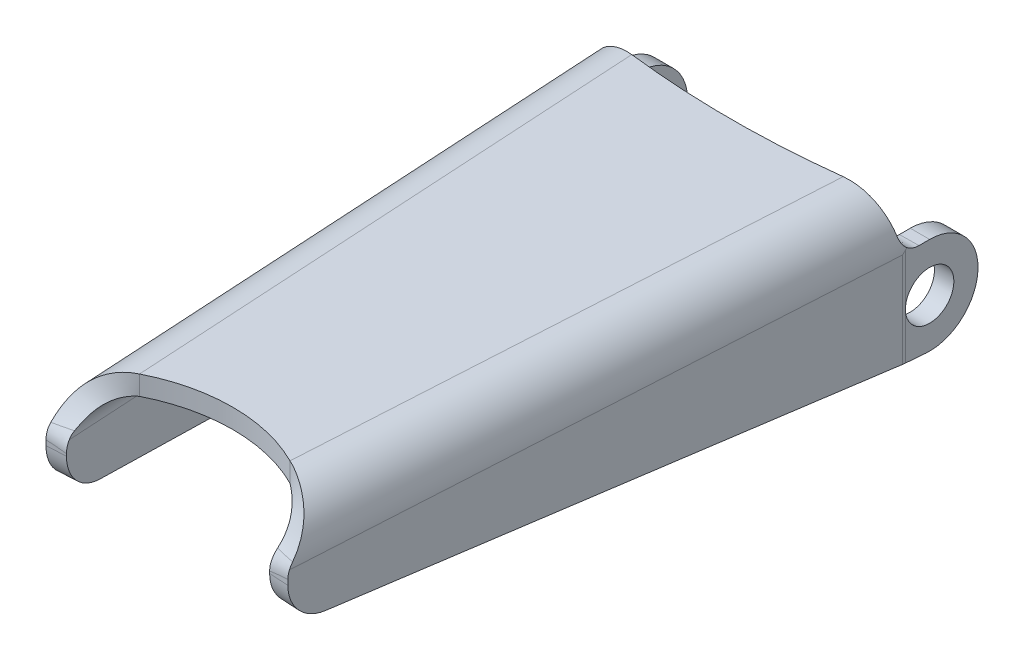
ISO-10303-21;
HEADER;
FILE_DESCRIPTION(('STEP AP214'),'2;1');
FILE_NAME('part.step','',(''),(''),'','','');
FILE_SCHEMA(('AUTOMOTIVE_DESIGN { 1 0 10303 214 1 1 1 1 }'));
ENDSEC;
DATA;
#1=APPLICATION_CONTEXT('core data for automotive mechanical design processes');
#2=APPLICATION_PROTOCOL_DEFINITION('international standard','automotive_design',2000,#1);
#3=PRODUCT_CONTEXT('',#1,'mechanical');
#4=PRODUCT('Part','Part','',(#3));
#5=PRODUCT_RELATED_PRODUCT_CATEGORY('part','',(#4));
#6=PRODUCT_DEFINITION_FORMATION('','',#4);
#7=PRODUCT_DEFINITION_CONTEXT('part definition',#1,'design');
#8=PRODUCT_DEFINITION('design','',#6,#7);
#9=PRODUCT_DEFINITION_SHAPE('','',#8);
#10=(LENGTH_UNIT() NAMED_UNIT(*) SI_UNIT(.MILLI.,.METRE.));
#11=(NAMED_UNIT(*) PLANE_ANGLE_UNIT() SI_UNIT($,.RADIAN.));
#12=(NAMED_UNIT(*) SI_UNIT($,.STERADIAN.) SOLID_ANGLE_UNIT());
#13=UNCERTAINTY_MEASURE_WITH_UNIT(LENGTH_MEASURE(1.E-05),#10,'distance_accuracy_value','');
#14=(GEOMETRIC_REPRESENTATION_CONTEXT(3) GLOBAL_UNCERTAINTY_ASSIGNED_CONTEXT((#13)) GLOBAL_UNIT_ASSIGNED_CONTEXT((#10,
#11,#12)) REPRESENTATION_CONTEXT('',''));
#15=CARTESIAN_POINT('',(0.,0.,0.));
#16=DIRECTION('',(0.,0.,1.));
#17=DIRECTION('',(1.,0.,0.));
#18=AXIS2_PLACEMENT_3D('',#15,#16,#17);
#19=CARTESIAN_POINT('',(12.4915147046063,-2.00000000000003,60.291171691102));
#20=DIRECTION('',(0.0582343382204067,0.,-0.998302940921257));
#21=DIRECTION('',(-0.998302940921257,0.,-0.0582343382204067));
#22=AXIS2_PLACEMENT_3D('',#19,#20,#21);
#23=PLANE('',#22);
#24=DIRECTION('',(0.,-1.,0.));
#25=VECTOR('',#24,1.);
#26=CARTESIAN_POINT('',(10.4949088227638,-2.00000000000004,60.1747030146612));
#27=LINE('',#26,#25);
#28=CARTESIAN_POINT('',(10.4949088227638,-6.08193664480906,60.1747030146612));
#29=VERTEX_POINT('',#28);
#30=CARTESIAN_POINT('',(10.4949088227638,-6.30628945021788,60.1747030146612));
#31=VERTEX_POINT('',#30);
#32=EDGE_CURVE('E652',#29,#31,#27,.T.);
#33=ORIENTED_EDGE('',*,*,#32,.T.);
#34=DIRECTION('',(-0.998302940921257,0.,-0.0582343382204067));
#35=VECTOR('',#34,1.);
#36=CARTESIAN_POINT('',(12.4915147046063,-6.30628945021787,60.291171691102));
#37=LINE('',#36,#35);
#38=CARTESIAN_POINT('',(12.4915147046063,-6.30628945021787,60.291171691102));
#39=VERTEX_POINT('',#38);
#40=EDGE_CURVE('E118',#31,#39,#37,.F.);
#41=ORIENTED_EDGE('',*,*,#40,.T.);
#42=DIRECTION('',(0.,1.,0.));
#43=VECTOR('',#42,1.);
#44=CARTESIAN_POINT('',(12.4915147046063,0.,60.291171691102));
#45=LINE('',#44,#43);
#46=CARTESIAN_POINT('',(12.4915147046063,-5.77680059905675,60.291171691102));
#47=VERTEX_POINT('',#46);
#48=EDGE_CURVE('E735',#47,#39,#45,.F.);
#49=ORIENTED_EDGE('',*,*,#48,.F.);
#50=CARTESIAN_POINT('',(13.1313015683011,-4.47531137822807,59.9033616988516));
#51=CARTESIAN_POINT('',(13.1570040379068,-5.01578460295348,60.3299919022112));
#52=CARTESIAN_POINT('',(13.2210024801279,-5.70184255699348,60.3337251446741));
#53=CARTESIAN_POINT('',(13.0250073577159,-4.47204649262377,59.8868812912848));
#54=CARTESIAN_POINT('',(13.0515137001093,-5.01623627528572,60.323838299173));
#55=CARTESIAN_POINT('',(13.1181648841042,-5.71143984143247,60.3277262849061));
#56=CARTESIAN_POINT('',(12.9184683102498,-4.46889005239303,59.8697927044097));
#57=CARTESIAN_POINT('',(12.9460606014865,-5.01670734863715,60.3176868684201));
#58=CARTESIAN_POINT('',(13.0153678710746,-5.72143939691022,60.3217297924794));
#59=CARTESIAN_POINT('',(12.7049003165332,-4.46279405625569,59.8343991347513));
#60=CARTESIAN_POINT('',(12.7348322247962,-5.01769031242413,60.3053652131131));
#61=CARTESIAN_POINT('',(12.809854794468,-5.74224307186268,60.3097415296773));
#62=CARTESIAN_POINT('',(12.5978713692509,-4.45985450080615,59.8160941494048));
#63=CARTESIAN_POINT('',(12.6290187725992,-5.01820250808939,60.299192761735));
#64=CARTESIAN_POINT('',(12.7071387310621,-5.75304719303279,60.303749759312));
#65=CARTESIAN_POINT('',(12.4905975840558,-4.4570233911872,59.7971809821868));
#66=CARTESIAN_POINT('',(12.5231487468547,-5.01873486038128,60.2930170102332));
#67=CARTESIAN_POINT('',(12.6044632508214,-5.76425358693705,60.2977603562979));
#68=CARTESIAN_POINT('',(12.4108519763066,-4.45495260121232,59.7830723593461));
#69=CARTESIAN_POINT('',(12.444258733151,-5.01913050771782,60.2884150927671));
#70=CARTESIAN_POINT('',(12.5281674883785,-5.77260917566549,60.2933097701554));
#71=CARTESIAN_POINT('',(12.3309562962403,-4.45295121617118,59.7685976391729));
#72=CARTESIAN_POINT('',(12.3653333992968,-5.01953865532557,60.283811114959));
#73=CARTESIAN_POINT('',(12.4518955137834,-5.78120491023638,60.2888605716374));
#74=CARTESIAN_POINT('',(11.9551294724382,-4.44405370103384,59.6986857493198));
#75=CARTESIAN_POINT('',(11.9928031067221,-5.02151620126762,60.2620801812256));
#76=CARTESIAN_POINT('',(12.0940518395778,-5.82280572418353,60.2679863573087));
#77=CARTESIAN_POINT('',(11.6569506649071,-4.43849365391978,59.6379303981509));
#78=CARTESIAN_POINT('',(11.6983378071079,-5.02322914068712,60.2449030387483));
#79=CARTESIAN_POINT('',(11.8128591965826,-5.8591952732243,60.251583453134));
#80=CARTESIAN_POINT('',(11.1072133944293,-4.4343247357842,59.5118843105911));
#81=CARTESIAN_POINT('',(11.1581985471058,-5.02650645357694,60.2133949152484));
#82=CARTESIAN_POINT('',(11.3023125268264,-5.93461244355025,60.2218015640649));
#83=CARTESIAN_POINT('',(10.8569050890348,-4.43464636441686,59.4493700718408));
#84=CARTESIAN_POINT('',(10.9116311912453,-5.02805351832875,60.1990118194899));
#85=CARTESIAN_POINT('',(11.0727225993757,-5.97199116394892,60.2084088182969));
#86=CARTESIAN_POINT('',(10.5654549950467,-4.44002341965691,59.3681537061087));
#87=CARTESIAN_POINT('',(10.6272941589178,-5.02969772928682,60.1824254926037));
#88=CARTESIAN_POINT('',(10.8104244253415,-6.02011809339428,60.1931080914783));
#89=CARTESIAN_POINT('',(10.5280879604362,-4.44080526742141,59.3575851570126));
#90=CARTESIAN_POINT('',(10.5905608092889,-5.02990748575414,60.1802827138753));
#91=CARTESIAN_POINT('',(10.7768879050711,-6.02637357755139,60.1911517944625));
#92=CARTESIAN_POINT('',(10.4906338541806,-4.44168793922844,59.3468295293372));
#93=CARTESIAN_POINT('',(10.5537853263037,-5.03011426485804,60.1781374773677));
#94=CARTESIAN_POINT('',(10.743370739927,-6.03273164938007,60.1891966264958));
#95=CARTESIAN_POINT('',(10.4361469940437,-4.4429793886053,59.3311772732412));
#96=CARTESIAN_POINT('',(10.5001124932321,-5.03041513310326,60.1750065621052));
#97=CARTESIAN_POINT('',(10.6946145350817,-6.0419828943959,60.1863525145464));
#98=CARTESIAN_POINT('',(10.3814723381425,-4.44449101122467,59.3151230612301));
#99=CARTESIAN_POINT('',(10.4463377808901,-5.03070887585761,60.1718697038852));
#100=CARTESIAN_POINT('',(10.6458994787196,-6.05145354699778,60.1835108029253));
#101=CARTESIAN_POINT('',(10.2717166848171,-4.448030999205,59.2821338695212));
#102=CARTESIAN_POINT('',(10.338360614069,-5.03127552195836,60.1655710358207));
#103=CARTESIAN_POINT('',(10.5485685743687,-6.07086597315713,60.1778331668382));
#104=CARTESIAN_POINT('',(10.216635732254,-4.45005930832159,59.2651989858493));
#105=CARTESIAN_POINT('',(10.2841400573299,-5.03154842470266,60.1624081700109));
#106=CARTESIAN_POINT('',(10.499952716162,-6.08080769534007,60.1749972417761));
#107=CARTESIAN_POINT('',(10.106023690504,-4.45470936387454,59.2303678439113));
#108=CARTESIAN_POINT('',(10.1752002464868,-5.03206556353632,60.1560533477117));
#109=CARTESIAN_POINT('',(10.4028254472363,-6.10119678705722,60.1693314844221));
#110=CARTESIAN_POINT('',(10.050492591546,-4.45733112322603,59.212471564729));
#111=CARTESIAN_POINT('',(10.1204604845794,-5.03230975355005,60.1528601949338));
#112=CARTESIAN_POINT('',(10.3543140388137,-6.11164416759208,60.1665016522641));
#113=CARTESIAN_POINT('',(9.93893352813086,-4.46326572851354,59.1756217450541));
#114=CARTESIAN_POINT('',(10.0104023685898,-5.03275881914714,60.1464401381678));
#115=CARTESIAN_POINT('',(10.2574059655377,-6.13308406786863,60.160848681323));
#116=CARTESIAN_POINT('',(9.88290551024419,-4.46657864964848,59.1566680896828));
#117=CARTESIAN_POINT('',(9.95506048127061,-5.03296357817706,60.1432118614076));
#118=CARTESIAN_POINT('',(10.2090093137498,-6.14407664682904,60.1580255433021));
#119=CARTESIAN_POINT('',(9.82661111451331,-4.47028571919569,59.1371395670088));
#120=CARTESIAN_POINT('',(9.89953661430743,-5.03314264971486,60.1399729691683));
#121=CARTESIAN_POINT('',(10.1606799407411,-6.15536053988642,60.1552063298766));
#122=(BOUNDED_SURFACE() B_SPLINE_SURFACE(3,2,((#50,#51,#52),(#53,#54,#55),(#56,#57,#58),(#59,
#60,#61),(#62,#63,#64),(#65,#66,#67),(#68,#69,#70),(#71,#72,#73),(#74,#75,#76),(#77,#78,#79),
(#80,#81,#82),(#83,#84,#85),(#86,#87,#88),(#89,#90,#91),(#92,#93,#94),(#95,#96,#97),(#98,#99,
#100),(#101,#102,#103),(#104,#105,#106),(#107,#108,#109),(#110,#111,#112),(#113,#114,#115),
(#116,#117,#118),(#119,#120,#121)),.UNSPECIFIED.,.F.,.F.,.F.) B_SPLINE_SURFACE_WITH_KNOTS((4,2,
3,2,2,2,3,2,2,2,4),(3,3),(0.,0.310368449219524,0.620737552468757,0.851385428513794,
1.70328907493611,2.40211947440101,2.50463200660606,2.65375468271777,2.80286113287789,
2.95197082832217,3.10109675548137),(0.,1.),
.UNSPECIFIED.) GEOMETRIC_REPRESENTATION_ITEM() RATIONAL_B_SPLINE_SURFACE(((1.,0.945461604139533,
1.),(1.,0.944105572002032,1.),(1.,0.942667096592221,1.),(1.,0.939625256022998,1.),(1.,
0.938021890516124,1.),(1.,0.93633608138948,1.),(1.,0.935075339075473,1.),(1.,0.933765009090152,
1.),(1.,0.927343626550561,1.),(1.,0.921501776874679,1.),(1.,0.908678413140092,1.),(1.,
0.902090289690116,1.),(1.,0.893128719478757,1.),(1.,0.89195589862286,1.),(1.,0.890755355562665,
1.),(1.,0.889007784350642,1.),(1.,0.887200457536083,1.),(1.,0.883453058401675,1.),(1.,
0.881513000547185,1.),(1.,0.877486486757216,1.),(1.,0.875400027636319,1.),(1.,0.871063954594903,
1.),(1.,0.868814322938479,1.),(1.,0.866474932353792,1.))) REPRESENTATION_ITEM('') SURFACE());
#123=CARTESIAN_POINT('',(13.2210024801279,-5.70184255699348,60.3337251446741));
#124=CARTESIAN_POINT('',(13.1181648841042,-5.71143984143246,60.3277262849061));
#125=CARTESIAN_POINT('',(13.0153678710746,-5.72143939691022,60.3217297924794));
#126=CARTESIAN_POINT('',(12.809854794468,-5.74224307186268,60.3097415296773));
#127=CARTESIAN_POINT('',(12.7071387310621,-5.75304719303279,60.303749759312));
#128=CARTESIAN_POINT('',(12.6044632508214,-5.76425358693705,60.2977603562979));
#129=CARTESIAN_POINT('',(12.5281674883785,-5.77260917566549,60.2933097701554));
#130=CARTESIAN_POINT('',(12.4518955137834,-5.78120491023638,60.2888605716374));
#131=CARTESIAN_POINT('',(12.0940518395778,-5.82280572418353,60.2679863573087));
#132=CARTESIAN_POINT('',(11.8128591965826,-5.8591952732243,60.251583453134));
#133=CARTESIAN_POINT('',(11.3023125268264,-5.93461244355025,60.2218015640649));
#134=CARTESIAN_POINT('',(11.0727225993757,-5.97199116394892,60.2084088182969));
#135=CARTESIAN_POINT('',(10.8104244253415,-6.02011809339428,60.1931080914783));
#136=CARTESIAN_POINT('',(10.7768879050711,-6.02637357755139,60.1911517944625));
#137=CARTESIAN_POINT('',(10.743370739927,-6.03273164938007,60.1891966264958));
#138=CARTESIAN_POINT('',(10.6946145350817,-6.04198289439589,60.1863525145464));
#139=CARTESIAN_POINT('',(10.6458994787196,-6.05145354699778,60.1835108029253));
#140=CARTESIAN_POINT('',(10.5485685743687,-6.07086597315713,60.1778331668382));
#141=CARTESIAN_POINT('',(10.499952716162,-6.08080769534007,60.1749972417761));
#142=CARTESIAN_POINT('',(10.4028254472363,-6.10119678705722,60.1693314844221));
#143=CARTESIAN_POINT('',(10.3543140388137,-6.11164416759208,60.1665016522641));
#144=CARTESIAN_POINT('',(10.2574059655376,-6.13308406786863,60.160848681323));
#145=CARTESIAN_POINT('',(10.2090093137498,-6.14407664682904,60.1580255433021));
#146=CARTESIAN_POINT('',(10.1606799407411,-6.15536053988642,60.1552063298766));
#147=B_SPLINE_CURVE_WITH_KNOTS('',3,(#123,#124,#125,#126,#127,#128,#129,#130,#131,#132,#133,
#134,#135,#136,#137,#138,#139,#140,#141,#142,#143,#144,#145,#146),.UNSPECIFIED.,.F.,.F.,(4,2,3,
2,2,2,3,2,2,2,4),(0.,0.310368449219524,0.620737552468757,0.851385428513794,1.70328907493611,
2.40211947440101,2.50463200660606,2.65375468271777,2.80286113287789,2.95197082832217,
3.10109675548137),.UNSPECIFIED.);
#148=EDGE_CURVE('E644',#47,#29,#147,.T.);
#149=ORIENTED_EDGE('',*,*,#148,.T.);
#150=EDGE_LOOP('',(#33,#41,#49,#149));
#151=FACE_BOUND('',#150,.T.);
#152=ADVANCED_FACE('F107',(#151),#23,.F.);
#153=CARTESIAN_POINT('',(15.9542110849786,0.,0.930662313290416));
#154=DIRECTION('',(0.998302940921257,0.,0.0582343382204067));
#155=DIRECTION('',(0.0582343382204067,0.,-0.998302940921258));
#156=AXIS2_PLACEMENT_3D('',#153,#154,#155);
#157=PLANE('',#156);
#158=ORIENTED_EDGE('',*,*,#48,.T.);
#159=CARTESIAN_POINT('',(12.7244520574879,-6.30628945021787,56.297959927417));
#160=DIRECTION('',(0.998302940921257,0.,0.0582343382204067));
#161=DIRECTION('',(0.0582343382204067,0.,-0.998302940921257));
#162=AXIS2_PLACEMENT_3D('',#159,#160,#161);
#163=CIRCLE('',#162,4.);
#164=CARTESIAN_POINT('',(12.7059347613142,-10.2936305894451,56.6153992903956));
#165=VERTEX_POINT('',#164);
#166=EDGE_CURVE('E13',#39,#165,#163,.T.);
#167=ORIENTED_EDGE('',*,*,#166,.T.);
#168=DIRECTION('',(0.0580500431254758,-0.0794947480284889,-0.995143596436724));
#169=VECTOR('',#168,1.);
#170=CARTESIAN_POINT('',(15.8861821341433,-14.6487171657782,2.09687289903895));
#171=LINE('',#170,#169);
#172=CARTESIAN_POINT('',(15.9915147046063,-14.7929614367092,0.29117169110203));
#173=VERTEX_POINT('',#172);
#174=EDGE_CURVE('E1596',#165,#173,#171,.T.);
#175=ORIENTED_EDGE('',*,*,#174,.T.);
#176=DIRECTION('',(0.,1.,0.));
#177=VECTOR('',#176,1.);
#178=CARTESIAN_POINT('',(15.9915147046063,0.,0.291171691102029));
#179=LINE('',#178,#177);
#180=CARTESIAN_POINT('',(15.9915147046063,-5.00000000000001,0.291171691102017));
#181=VERTEX_POINT('',#180);
#182=EDGE_CURVE('E749',#173,#181,#179,.T.);
#183=ORIENTED_EDGE('',*,*,#182,.T.);
#184=DIRECTION('',(-0.0582343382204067,0.,0.998302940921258));
#185=VECTOR('',#184,1.);
#186=CARTESIAN_POINT('',(15.9542110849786,-5.00000000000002,0.930662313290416));
#187=LINE('',#186,#185);
#188=CARTESIAN_POINT('',(12.500541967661,-5.00000000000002,60.1364186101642));
#189=VERTEX_POINT('',#188);
#190=EDGE_CURVE('E750',#181,#189,#187,.T.);
#191=ORIENTED_EDGE('',*,*,#190,.T.);
#192=CARTESIAN_POINT('',(12.500541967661,-5.00000000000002,60.1364186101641));
#193=CARTESIAN_POINT('',(12.4990483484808,-5.06163850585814,60.1620235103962));
#194=CARTESIAN_POINT('',(12.4977339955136,-5.12455424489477,60.1845552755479));
#195=CARTESIAN_POINT('',(12.4954844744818,-5.25169357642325,60.2231184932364));
#196=CARTESIAN_POINT('',(12.4945457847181,-5.31589879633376,60.2392103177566));
#197=CARTESIAN_POINT('',(12.4930392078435,-5.44557876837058,60.265037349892));
#198=CARTESIAN_POINT('',(12.492471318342,-5.51105351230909,60.2747725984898));
#199=CARTESIAN_POINT('',(12.4917069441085,-5.64328097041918,60.2878761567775));
#200=CARTESIAN_POINT('',(12.491514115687,-5.71003992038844,60.2911817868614));
#201=CARTESIAN_POINT('',(12.4915147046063,-5.77680059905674,60.2911716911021));
#202=B_SPLINE_CURVE_WITH_KNOTS('',3,(#192,#193,#194,#195,#196,#197,#198,#199,#200,#201),
.UNSPECIFIED.,.F.,.F.,(4,2,2,2,4),(0.,0.20019850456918,0.39847360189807,0.596747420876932,
0.796944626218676),.UNSPECIFIED.);
#203=EDGE_CURVE('E651',#189,#47,#202,.T.);
#204=ORIENTED_EDGE('',*,*,#203,.T.);
#205=EDGE_LOOP('',(#158,#167,#175,#183,#191,#204));
#206=FACE_BOUND('',#205,.T.);
#207=ADVANCED_FACE('F636',(#206),#157,.T.);
#208=CARTESIAN_POINT('',(13.9576052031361,0.,0.814193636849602));
#209=DIRECTION('',(0.998302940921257,0.,0.0582343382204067));
#210=DIRECTION('',(0.0582343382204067,0.,-0.998302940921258));
#211=AXIS2_PLACEMENT_3D('',#208,#209,#210);
#212=PLANE('',#211);
#213=DIRECTION('',(0.0580500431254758,-0.0794947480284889,-0.995143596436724));
#214=VECTOR('',#213,1.);
#215=CARTESIAN_POINT('',(13.8895762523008,-14.6487171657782,1.98040422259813));
#216=LINE('',#215,#214);
#217=CARTESIAN_POINT('',(10.7093288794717,-10.2936305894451,56.4989306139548));
#218=VERTEX_POINT('',#217);
#219=CARTESIAN_POINT('',(13.9949088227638,-14.7929614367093,0.174703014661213));
#220=VERTEX_POINT('',#219);
#221=EDGE_CURVE('E1598',#218,#220,#216,.T.);
#222=ORIENTED_EDGE('',*,*,#221,.F.);
#223=CARTESIAN_POINT('',(10.7278461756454,-6.30628945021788,56.1814912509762));
#224=DIRECTION('',(0.998302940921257,0.,0.0582343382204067));
#225=DIRECTION('',(0.0582343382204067,0.,-0.998302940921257));
#226=AXIS2_PLACEMENT_3D('',#223,#224,#225);
#227=CIRCLE('',#226,4.);
#228=EDGE_CURVE('E133',#218,#31,#227,.F.);
#229=ORIENTED_EDGE('',*,*,#228,.T.);
#230=ORIENTED_EDGE('',*,*,#32,.F.);
#231=CARTESIAN_POINT('',(10.4949088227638,-6.08193664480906,60.1747030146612));
#232=CARTESIAN_POINT('',(10.4949089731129,-6.02317703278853,60.1747004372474));
#233=CARTESIAN_POINT('',(10.4950535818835,-5.96445087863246,60.1722214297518));
#234=CARTESIAN_POINT('',(10.4956312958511,-5.84740235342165,60.1623177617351));
#235=CARTESIAN_POINT('',(10.4960644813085,-5.78908009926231,60.1548917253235));
#236=CARTESIAN_POINT('',(10.4977688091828,-5.61801820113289,60.1256746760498));
#237=CARTESIAN_POINT('',(10.4994450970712,-5.50636673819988,60.0969383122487));
#238=CARTESIAN_POINT('',(10.5030498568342,-5.32900652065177,60.035142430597));
#239=CARTESIAN_POINT('',(10.5046651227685,-5.26135143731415,60.0074521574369));
#240=CARTESIAN_POINT('',(10.5083326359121,-5.12840579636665,59.9445805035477));
#241=CARTESIAN_POINT('',(10.5103909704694,-5.06316475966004,59.9092947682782));
#242=CARTESIAN_POINT('',(10.5126519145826,-5.00000000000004,59.8705357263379));
#243=B_SPLINE_CURVE_WITH_KNOTS('',3,(#231,#232,#233,#234,#235,#236,#237,#238,#239,#240,#241,
#242),.UNSPECIFIED.,.F.,.F.,(4,2,2,2,2,4),(0.,0.176159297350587,0.352367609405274,
0.69643769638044,0.915427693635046,1.13764402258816),.UNSPECIFIED.);
#244=CARTESIAN_POINT('',(10.5126519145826,-5.00000000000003,59.870535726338));
#245=VERTEX_POINT('',#244);
#246=EDGE_CURVE('E650',#29,#245,#243,.T.);
#247=ORIENTED_EDGE('',*,*,#246,.T.);
#248=DIRECTION('',(-0.0582343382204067,0.,0.998302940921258));
#249=VECTOR('',#248,1.);
#250=CARTESIAN_POINT('',(13.9949088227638,-5.00000000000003,0.174703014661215));
#251=LINE('',#250,#249);
#252=CARTESIAN_POINT('',(13.9949088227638,-5.00000000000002,0.174703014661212));
#253=VERTEX_POINT('',#252);
#254=EDGE_CURVE('E737',#253,#245,#251,.T.);
#255=ORIENTED_EDGE('',*,*,#254,.F.);
#256=DIRECTION('',(0.,1.,0.));
#257=VECTOR('',#256,1.);
#258=CARTESIAN_POINT('',(13.9949088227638,-22.,0.174703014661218));
#259=LINE('',#258,#257);
#260=EDGE_CURVE('E746',#220,#253,#259,.T.);
#261=ORIENTED_EDGE('',*,*,#260,.F.);
#262=EDGE_LOOP('',(#222,#229,#230,#247,#255,#261));
#263=FACE_BOUND('',#262,.T.);
#264=ADVANCED_FACE('F637',(#263),#212,.F.);
#265=CARTESIAN_POINT('',(15.8861821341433,-14.6487171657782,2.09687289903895));
#266=DIRECTION('',(-0.00462932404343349,-0.996835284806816,0.079359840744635));
#267=DIRECTION('',(0.0580500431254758,-0.0794947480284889,-0.995143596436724));
#268=AXIS2_PLACEMENT_3D('',#265,#266,#267);
#269=PLANE('',#268);
#270=ORIENTED_EDGE('',*,*,#174,.F.);
#271=DIRECTION('',(-0.998302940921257,0.,-0.0582343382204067));
#272=VECTOR('',#271,1.);
#273=CARTESIAN_POINT('',(10.7093288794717,-10.2936305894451,56.4989306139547));
#274=LINE('',#273,#272);
#275=EDGE_CURVE('E1600',#165,#218,#274,.T.);
#276=ORIENTED_EDGE('',*,*,#275,.T.);
#277=ORIENTED_EDGE('',*,*,#221,.T.);
#278=CARTESIAN_POINT('',(15.9915147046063,-14.7929614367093,0.291171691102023));
#279=CARTESIAN_POINT('',(13.9949088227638,-14.7929614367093,0.174703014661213));
#280=B_SPLINE_CURVE_WITH_KNOTS('',1,(#278,#279),.UNSPECIFIED.,.F.,.F.,(2,2),(0.,1.),.UNSPECIFIED.);
#281=EDGE_CURVE('E710',#173,#220,#280,.T.);
#282=ORIENTED_EDGE('',*,*,#281,.F.);
#283=EDGE_LOOP('',(#270,#276,#277,#282));
#284=FACE_BOUND('',#283,.T.);
#285=ADVANCED_FACE('F1365',(#284),#269,.T.);
#286=CARTESIAN_POINT('',(0.,-2.,0.));
#287=DIRECTION('',(0.,1.,0.));
#288=DIRECTION('',(0.,0.,1.));
#289=AXIS2_PLACEMENT_3D('',#286,#287,#288);
#290=PLANE('',#289);
#291=CARTESIAN_POINT('',(0.,-2.,70.7463198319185));
#292=DIRECTION('',(0.,1.,0.));
#293=DIRECTION('',(0.,0.,1.));
#294=AXIS2_PLACEMENT_3D('',#291,#292,#293);
#295=CIRCLE('',#294,17.2463198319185);
#296=CARTESIAN_POINT('',(7.77124366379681,-2.,55.3501086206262));
#297=VERTEX_POINT('',#296);
#298=CARTESIAN_POINT('',(-7.77124366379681,-2.,55.3501086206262));
#299=VERTEX_POINT('',#298);
#300=EDGE_CURVE('E1622',#297,#299,#295,.T.);
#301=ORIENTED_EDGE('',*,*,#300,.T.);
#302=DIRECTION('',(-0.0582343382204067,0.,-0.998302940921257));
#303=VECTOR('',#302,1.);
#304=CARTESIAN_POINT('',(-11.,-2.,0.));
#305=LINE('',#304,#303);
#306=CARTESIAN_POINT('',(-10.9212380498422,-2.,1.35020485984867));
#307=VERTEX_POINT('',#306);
#308=EDGE_CURVE('E964',#299,#307,#305,.T.);
#309=ORIENTED_EDGE('',*,*,#308,.T.);
#310=CARTESIAN_POINT('',(0.,-2.,-90.102623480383));
#311=DIRECTION('',(0.,1.,0.));
#312=DIRECTION('',(0.,0.,1.));
#313=AXIS2_PLACEMENT_3D('',#310,#311,#312);
#314=CIRCLE('',#313,92.102623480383);
#315=CARTESIAN_POINT('',(10.9212380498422,-2.,1.35020485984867));
#316=VERTEX_POINT('',#315);
#317=EDGE_CURVE('E1075',#307,#316,#314,.T.);
#318=ORIENTED_EDGE('',*,*,#317,.T.);
#319=DIRECTION('',(0.0582343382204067,0.,-0.998302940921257));
#320=VECTOR('',#319,1.);
#321=CARTESIAN_POINT('',(11.,-2.,0.));
#322=LINE('',#321,#320);
#323=EDGE_CURVE('E1625',#297,#316,#322,.T.);
#324=ORIENTED_EDGE('',*,*,#323,.F.);
#325=EDGE_LOOP('',(#301,#309,#318,#324));
#326=FACE_BOUND('',#325,.T.);
#327=ADVANCED_FACE('F1358',(#326),#290,.F.);
#328=CARTESIAN_POINT('',(0.,-2.,70.7463198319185));
#329=DIRECTION('',(0.,1.,0.));
#330=DIRECTION('',(0.,0.,1.));
#331=AXIS2_PLACEMENT_3D('',#328,#329,#330);
#332=CYLINDRICAL_SURFACE('',#331,17.2463198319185);
#333=CARTESIAN_POINT('',(0.,0.,70.7463198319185));
#334=DIRECTION('',(0.,1.,0.));
#335=DIRECTION('',(0.,0.,1.));
#336=AXIS2_PLACEMENT_3D('',#333,#334,#335);
#337=CIRCLE('',#336,17.2463198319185);
#338=CARTESIAN_POINT('',(7.77124366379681,0.,55.3501086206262));
#339=VERTEX_POINT('',#338);
#340=CARTESIAN_POINT('',(-7.77124366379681,0.,55.3501086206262));
#341=VERTEX_POINT('',#340);
#342=EDGE_CURVE('E1646',#339,#341,#337,.T.);
#343=ORIENTED_EDGE('',*,*,#342,.T.);
#344=CARTESIAN_POINT('',(-7.77124366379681,-2.,55.3501086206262));
#345=CARTESIAN_POINT('',(-7.77124366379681,0.,55.3501086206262));
#346=B_SPLINE_CURVE_WITH_KNOTS('',1,(#344,#345),.UNSPECIFIED.,.F.,.F.,(2,2),(0.,1.),.UNSPECIFIED.);
#347=EDGE_CURVE('E1076',#299,#341,#346,.T.);
#348=ORIENTED_EDGE('',*,*,#347,.F.);
#349=ORIENTED_EDGE('',*,*,#300,.F.);
#350=CARTESIAN_POINT('',(7.77124366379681,0.,55.3501086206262));
#351=CARTESIAN_POINT('',(7.77124366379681,-2.,55.3501086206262));
#352=B_SPLINE_CURVE_WITH_KNOTS('',1,(#350,#351),.UNSPECIFIED.,.F.,.F.,(2,2),(0.,1.),.UNSPECIFIED.);
#353=EDGE_CURVE('E1621',#297,#339,#352,.F.);
#354=ORIENTED_EDGE('',*,*,#353,.T.);
#355=EDGE_LOOP('',(#343,#348,#349,#354));
#356=FACE_BOUND('',#355,.T.);
#357=ADVANCED_FACE('F1351',(#356),#332,.F.);
#358=CARTESIAN_POINT('',(0.,0.,0.));
#359=DIRECTION('',(0.,1.,0.));
#360=DIRECTION('',(0.,0.,1.));
#361=AXIS2_PLACEMENT_3D('',#358,#359,#360);
#362=PLANE('',#361);
#363=CARTESIAN_POINT('',(0.,0.,-90.102623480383));
#364=DIRECTION('',(0.,1.,0.));
#365=DIRECTION('',(0.,0.,1.));
#366=AXIS2_PLACEMENT_3D('',#363,#364,#365);
#367=CIRCLE('',#366,92.102623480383);
#368=CARTESIAN_POINT('',(-10.9212380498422,0.,1.35020485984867));
#369=VERTEX_POINT('',#368);
#370=CARTESIAN_POINT('',(10.9212380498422,0.,1.35020485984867));
#371=VERTEX_POINT('',#370);
#372=EDGE_CURVE('E1072',#369,#371,#367,.T.);
#373=ORIENTED_EDGE('',*,*,#372,.F.);
#374=DIRECTION('',(-0.0582343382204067,0.,-0.998302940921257));
#375=VECTOR('',#374,1.);
#376=CARTESIAN_POINT('',(-11.,0.,0.));
#377=LINE('',#376,#375);
#378=EDGE_CURVE('E1079',#341,#369,#377,.T.);
#379=ORIENTED_EDGE('',*,*,#378,.F.);
#380=ORIENTED_EDGE('',*,*,#342,.F.);
#381=DIRECTION('',(0.0582343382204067,0.,-0.998302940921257));
#382=VECTOR('',#381,1.);
#383=CARTESIAN_POINT('',(11.,0.,0.));
#384=LINE('',#383,#382);
#385=EDGE_CURVE('E1607',#339,#371,#384,.T.);
#386=ORIENTED_EDGE('',*,*,#385,.T.);
#387=EDGE_LOOP('',(#373,#379,#380,#386));
#388=FACE_BOUND('',#387,.T.);
#389=ADVANCED_FACE('F1344',(#388),#362,.T.);
#390=CARTESIAN_POINT('',(0.,-2.,-90.102623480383));
#391=DIRECTION('',(0.,1.,0.));
#392=DIRECTION('',(0.,0.,1.));
#393=AXIS2_PLACEMENT_3D('',#390,#391,#392);
#394=CYLINDRICAL_SURFACE('',#393,92.102623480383);
#395=CARTESIAN_POINT('',(10.9212380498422,-2.02,1.35020485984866));
#396=CARTESIAN_POINT('',(10.9212380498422,-2.,1.35020485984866));
#397=CARTESIAN_POINT('',(10.9212380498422,0.,1.35020485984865));
#398=CARTESIAN_POINT('',(10.9212380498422,0.0202000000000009,1.35020485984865));
#399=B_SPLINE_CURVE_WITH_KNOTS('',1,(#395,#396,#397,#398),.UNSPECIFIED.,.F.,.F.,(2,1,1,2),
(-0.0101,-9.9999999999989E-05,0.9999,1.01),.UNSPECIFIED.);
#400=EDGE_CURVE('E1617',#316,#371,#399,.T.);
#401=ORIENTED_EDGE('',*,*,#400,.F.);
#402=ORIENTED_EDGE('',*,*,#317,.F.);
#403=CARTESIAN_POINT('',(-10.9212380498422,0.0202000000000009,1.35020485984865));
#404=CARTESIAN_POINT('',(-10.9212380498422,0.,1.35020485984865));
#405=CARTESIAN_POINT('',(-10.9212380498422,-2.,1.35020485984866));
#406=CARTESIAN_POINT('',(-10.9212380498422,-2.02,1.35020485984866));
#407=B_SPLINE_CURVE_WITH_KNOTS('',1,(#403,#404,#405,#406),.UNSPECIFIED.,.F.,.F.,(2,1,1,2),
(-0.0101,0.,1.,1.01),.UNSPECIFIED.);
#408=EDGE_CURVE('E974',#307,#369,#407,.F.);
#409=ORIENTED_EDGE('',*,*,#408,.T.);
#410=ORIENTED_EDGE('',*,*,#372,.T.);
#411=EDGE_LOOP('',(#401,#402,#409,#410));
#412=FACE_BOUND('',#411,.T.);
#413=ADVANCED_FACE('F1071',(#412),#394,.F.);
#414=CARTESIAN_POINT('',(12.4915147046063,-5.,60.2911716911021));
#415=CARTESIAN_POINT('',(12.5201106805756,-4.47846050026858,59.8009549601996));
#416=CARTESIAN_POINT('',(12.4647138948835,-3.92913719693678,59.3350762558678));
#417=CARTESIAN_POINT('',(12.225110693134,-3.11454937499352,58.6720684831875));
#418=CARTESIAN_POINT('',(12.1193005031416,-2.84476938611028,58.4569823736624));
#419=CARTESIAN_POINT('',(11.9529935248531,-2.51665617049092,58.1954260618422));
#420=CARTESIAN_POINT('',(11.9180352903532,-2.45149317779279,58.143480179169));
#421=CARTESIAN_POINT('',(11.8630394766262,-2.35457966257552,58.0661086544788));
#422=CARTESIAN_POINT('',(11.8442812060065,-2.32241369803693,58.0404093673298));
#423=CARTESIAN_POINT('',(11.8155033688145,-2.27439063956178,58.0019972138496));
#424=CARTESIAN_POINT('',(11.8050919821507,-2.25727052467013,57.988291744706));
#425=CARTESIAN_POINT('',(11.7879732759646,-2.22944696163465,57.9660167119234));
#426=CARTESIAN_POINT('',(11.7793005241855,-2.21551424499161,57.9548686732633));
#427=CARTESIAN_POINT('',(11.7002113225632,-2.08994981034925,57.8544408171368));
#428=CARTESIAN_POINT('',(11.6225471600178,-1.97711137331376,57.7644920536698));
#429=CARTESIAN_POINT('',(11.3652296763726,-1.63840790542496,57.4924765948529));
#430=CARTESIAN_POINT('',(11.1610793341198,-1.41213874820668,57.3082306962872));
#431=CARTESIAN_POINT('',(10.6786469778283,-0.982353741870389,56.9334139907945));
#432=CARTESIAN_POINT('',(10.4002329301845,-0.778866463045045,56.7428354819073));
#433=CARTESIAN_POINT('',(9.45071527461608,-0.247954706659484,56.161433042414));
#434=CARTESIAN_POINT('',(8.66047554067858,0.,55.7619812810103));
#435=CARTESIAN_POINT('',(7.77124366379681,0.,55.3501086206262));
#436=CARTESIAN_POINT('',(10.4949088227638,-5.,60.1747030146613));
#437=CARTESIAN_POINT('',(10.5235111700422,-4.68700657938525,59.6843770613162));
#438=CARTESIAN_POINT('',(10.5010252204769,-4.35748231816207,59.2205277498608));
#439=CARTESIAN_POINT('',(10.3723559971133,-3.86872962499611,58.5639911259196));
#440=CARTESIAN_POINT('',(10.3137280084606,-3.70686163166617,58.3516573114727));
#441=CARTESIAN_POINT('',(10.2198005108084,-3.50999370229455,58.0943231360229));
#442=CARTESIAN_POINT('',(10.1999861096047,-3.47089590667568,58.0432606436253));
#443=CARTESIAN_POINT('',(10.1687132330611,-3.41274779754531,57.9672729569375));
#444=CARTESIAN_POINT('',(10.1580304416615,-3.39344821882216,57.9420447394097));
#445=CARTESIAN_POINT('',(10.1416179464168,-3.36463438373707,57.9043538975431));
#446=CARTESIAN_POINT('',(10.1356757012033,-3.35436231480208,57.8909091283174));
#447=CARTESIAN_POINT('',(10.1258992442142,-3.33766817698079,57.8690623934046));
#448=CARTESIAN_POINT('',(10.1209430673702,-3.32930854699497,57.8581311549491));
#449=CARTESIAN_POINT('',(10.0757176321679,-3.25396988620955,57.7596786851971));
#450=CARTESIAN_POINT('',(10.0311054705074,-3.18626682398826,57.671657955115));
#451=CARTESIAN_POINT('',(9.88269143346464,-2.98304474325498,57.4059951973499));
#452=CARTESIAN_POINT('',(9.76420879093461,-2.84728324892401,57.2267465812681));
#453=CARTESIAN_POINT('',(9.48281102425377,-2.58941224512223,56.8636568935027));
#454=CARTESIAN_POINT('',(9.31981667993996,-2.46731987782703,56.679811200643));
#455=CARTESIAN_POINT('',(8.76233812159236,-2.14877282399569,56.1212777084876));
#456=CARTESIAN_POINT('',(8.29603895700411,-2.,55.740467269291));
#457=CARTESIAN_POINT('',(7.77124366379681,-2.,55.3501086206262));
#458=B_SPLINE_SURFACE_WITH_KNOTS('',1,3,((#414,#415,#416,#417,#418,#419,#420,#421,#422,#423,
#424,#425,#426,#427,#428,#429,#430,#431,#432,#433,#434,#435),(#436,#437,#438,#439,#440,#441,
#442,#443,#444,#445,#446,#447,#448,#449,#450,#451,#452,#453,#454,#455,#456,#457)),.UNSPECIFIED.,
.F.,.F.,.F.,(2,2),(4,2,2,2,2,2,2,2,2,2,4),(0.,1.),(0.,0.25,0.375,0.40625,0.421875,0.4296875,
0.4375,0.5,0.625,0.75,1.),.UNSPECIFIED.);
#459=CARTESIAN_POINT('',(7.77124366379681,-2.,55.3501086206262));
#460=CARTESIAN_POINT('',(8.29603895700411,-2.,55.740467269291));
#461=CARTESIAN_POINT('',(8.76233812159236,-2.14877282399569,56.1212777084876));
#462=CARTESIAN_POINT('',(9.31981667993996,-2.46731987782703,56.679811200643));
#463=CARTESIAN_POINT('',(9.48281102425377,-2.58941224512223,56.8636568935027));
#464=CARTESIAN_POINT('',(9.76420879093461,-2.84728324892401,57.2267465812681));
#465=CARTESIAN_POINT('',(9.88269143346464,-2.98304474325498,57.4059951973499));
#466=CARTESIAN_POINT('',(10.0311054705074,-3.18626682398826,57.671657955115));
#467=CARTESIAN_POINT('',(10.0757176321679,-3.25396988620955,57.7596786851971));
#468=CARTESIAN_POINT('',(10.1209430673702,-3.32930854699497,57.8581311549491));
#469=CARTESIAN_POINT('',(10.1258992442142,-3.33766817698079,57.8690623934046));
#470=CARTESIAN_POINT('',(10.1356757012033,-3.35436231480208,57.8909091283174));
#471=CARTESIAN_POINT('',(10.1416179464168,-3.36463438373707,57.9043538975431));
#472=CARTESIAN_POINT('',(10.1580304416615,-3.39344821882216,57.9420447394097));
#473=CARTESIAN_POINT('',(10.1687132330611,-3.41274779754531,57.9672729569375));
#474=CARTESIAN_POINT('',(10.1999861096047,-3.47089590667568,58.0432606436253));
#475=CARTESIAN_POINT('',(10.2198005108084,-3.50999370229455,58.0943231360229));
#476=CARTESIAN_POINT('',(10.3137280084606,-3.70686163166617,58.3516573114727));
#477=CARTESIAN_POINT('',(10.3723559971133,-3.86872962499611,58.5639911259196));
#478=CARTESIAN_POINT('',(10.5010252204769,-4.35748231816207,59.2205277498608));
#479=CARTESIAN_POINT('',(10.5235111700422,-4.68700657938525,59.6843770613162));
#480=CARTESIAN_POINT('',(10.4949088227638,-5.,60.1747030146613));
#481=B_SPLINE_CURVE_WITH_KNOTS('',3,(#459,#460,#461,#462,#463,#464,#465,#466,#467,#468,#469,
#470,#471,#472,#473,#474,#475,#476,#477,#478,#479,#480),.UNSPECIFIED.,.F.,.F.,(4,2,2,2,2,2,2,2,
2,2,4),(0.,0.25,0.375,0.5,0.5625,0.5703125,0.578125,0.59375,0.625,0.75,1.),.UNSPECIFIED.);
#482=CARTESIAN_POINT('',(10.4906790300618,-4.44173701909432,59.3468029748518));
#483=VERTEX_POINT('',#482);
#484=EDGE_CURVE('E696',#483,#297,#481,.F.);
#485=CARTESIAN_POINT('',(9.82661111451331,-4.47028571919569,59.1371395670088));
#486=CARTESIAN_POINT('',(9.88290551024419,-4.46657864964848,59.1566680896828));
#487=CARTESIAN_POINT('',(9.93893352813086,-4.46326572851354,59.1756217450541));
#488=CARTESIAN_POINT('',(10.050492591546,-4.45733112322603,59.212471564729));
#489=CARTESIAN_POINT('',(10.106023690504,-4.45470936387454,59.2303678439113));
#490=CARTESIAN_POINT('',(10.216635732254,-4.45005930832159,59.2651989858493));
#491=CARTESIAN_POINT('',(10.2717166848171,-4.448030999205,59.2821338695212));
#492=CARTESIAN_POINT('',(10.3814723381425,-4.44449101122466,59.3151230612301));
#493=CARTESIAN_POINT('',(10.4361469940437,-4.4429793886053,59.3311772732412));
#494=CARTESIAN_POINT('',(10.4906338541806,-4.44168793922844,59.3468295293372));
#495=CARTESIAN_POINT('',(10.5280879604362,-4.44080526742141,59.3575851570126));
#496=CARTESIAN_POINT('',(10.5654549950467,-4.44002341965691,59.3681537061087));
#497=CARTESIAN_POINT('',(10.8569050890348,-4.43464636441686,59.4493700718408));
#498=CARTESIAN_POINT('',(11.1072133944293,-4.4343247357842,59.5118843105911));
#499=CARTESIAN_POINT('',(11.6569506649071,-4.43849365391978,59.6379303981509));
#500=CARTESIAN_POINT('',(11.9551294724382,-4.44405370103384,59.6986857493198));
#501=CARTESIAN_POINT('',(12.3309562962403,-4.45295121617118,59.7685976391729));
#502=CARTESIAN_POINT('',(12.4108519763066,-4.45495260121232,59.7830723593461));
#503=CARTESIAN_POINT('',(12.4905975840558,-4.4570233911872,59.7971809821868));
#504=CARTESIAN_POINT('',(12.5978713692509,-4.45985450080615,59.8160941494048));
#505=CARTESIAN_POINT('',(12.7049003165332,-4.46279405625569,59.8343991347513));
#506=CARTESIAN_POINT('',(12.9184683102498,-4.46889005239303,59.8697927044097));
#507=CARTESIAN_POINT('',(13.0250073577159,-4.47204649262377,59.8868812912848));
#508=CARTESIAN_POINT('',(13.1313015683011,-4.47531137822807,59.9033616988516));
#509=B_SPLINE_CURVE_WITH_KNOTS('',3,(#485,#486,#487,#488,#489,#490,#491,#492,#493,#494,#495,
#496,#497,#498,#499,#500,#501,#502,#503,#504,#505,#506,#507,#508),.UNSPECIFIED.,.F.,.F.,(4,2,2,
2,3,2,2,2,3,2,4),(0.,0.149125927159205,0.298235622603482,0.447342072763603,0.59646474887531,
0.698977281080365,1.39780768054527,2.24971132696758,2.48035920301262,2.79072830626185,
3.10109675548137),.UNSPECIFIED.);
#510=CARTESIAN_POINT('',(12.4906619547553,-4.45707142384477,59.7971376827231));
#511=VERTEX_POINT('',#510);
#512=EDGE_CURVE('E715',#483,#511,#509,.T.);
#513=CARTESIAN_POINT('',(12.4915147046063,-5.,60.2911716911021));
#514=CARTESIAN_POINT('',(12.5201106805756,-4.47846050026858,59.8009549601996));
#515=CARTESIAN_POINT('',(12.4647138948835,-3.92913719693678,59.3350762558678));
#516=CARTESIAN_POINT('',(12.225110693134,-3.11454937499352,58.6720684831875));
#517=CARTESIAN_POINT('',(12.1193005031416,-2.84476938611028,58.4569823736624));
#518=CARTESIAN_POINT('',(11.9529935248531,-2.51665617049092,58.1954260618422));
#519=CARTESIAN_POINT('',(11.9180352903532,-2.45149317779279,58.143480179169));
#520=CARTESIAN_POINT('',(11.8630394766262,-2.35457966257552,58.0661086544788));
#521=CARTESIAN_POINT('',(11.8442812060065,-2.32241369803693,58.0404093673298));
#522=CARTESIAN_POINT('',(11.8155033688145,-2.27439063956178,58.0019972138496));
#523=CARTESIAN_POINT('',(11.8050919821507,-2.25727052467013,57.988291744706));
#524=CARTESIAN_POINT('',(11.7879732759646,-2.22944696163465,57.9660167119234));
#525=CARTESIAN_POINT('',(11.7793005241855,-2.21551424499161,57.9548686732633));
#526=CARTESIAN_POINT('',(11.7002113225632,-2.08994981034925,57.8544408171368));
#527=CARTESIAN_POINT('',(11.6225471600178,-1.97711137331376,57.7644920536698));
#528=CARTESIAN_POINT('',(11.3652296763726,-1.63840790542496,57.4924765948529));
#529=CARTESIAN_POINT('',(11.1610793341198,-1.41213874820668,57.3082306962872));
#530=CARTESIAN_POINT('',(10.6786469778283,-0.982353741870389,56.9334139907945));
#531=CARTESIAN_POINT('',(10.4002329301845,-0.778866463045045,56.7428354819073));
#532=CARTESIAN_POINT('',(9.45071527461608,-0.247954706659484,56.161433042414));
#533=CARTESIAN_POINT('',(8.66047554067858,0.,55.7619812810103));
#534=CARTESIAN_POINT('',(7.77124366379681,0.,55.3501086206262));
#535=B_SPLINE_CURVE_WITH_KNOTS('',3,(#513,#514,#515,#516,#517,#518,#519,#520,#521,#522,#523,
#524,#525,#526,#527,#528,#529,#530,#531,#532,#533,#534),.UNSPECIFIED.,.F.,.F.,(4,2,2,2,2,2,2,2,
2,2,4),(0.,0.25,0.375,0.40625,0.421875,0.4296875,0.4375,0.5,0.625,0.75,1.),.UNSPECIFIED.);
#536=EDGE_CURVE('E697',#511,#339,#535,.T.);
#537=ORIENTED_EDGE('',*,*,#484,.F.);
#538=ORIENTED_EDGE('',*,*,#512,.T.);
#539=ORIENTED_EDGE('',*,*,#536,.T.);
#540=ORIENTED_EDGE('',*,*,#353,.F.);
#541=EDGE_LOOP('',(#537,#538,#539,#540));
#542=FACE_BOUND('',#541,.T.);
#543=ADVANCED_FACE('F628',(#542),#458,.F.);
#544=CARTESIAN_POINT('',(10.9212380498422,0.0202000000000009,1.35020485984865));
#545=CARTESIAN_POINT('',(11.5839450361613,0.0202000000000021,1.27594304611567));
#546=CARTESIAN_POINT('',(12.2461617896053,-0.110462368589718,1.20169219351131));
#547=CARTESIAN_POINT('',(13.4714694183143,-0.61341757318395,1.04736858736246));
#548=CARTESIAN_POINT('',(14.0339672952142,-0.985512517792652,0.967281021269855));
#549=CARTESIAN_POINT('',(14.9748571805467,-1.91485255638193,0.796366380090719));
#550=CARTESIAN_POINT('',(15.352884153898,-2.47173199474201,0.705518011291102));
#551=CARTESIAN_POINT('',(15.8681128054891,-3.68597327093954,0.509773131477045));
#552=CARTESIAN_POINT('',(16.0051157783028,-4.34274225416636,0.404884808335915));
#553=CARTESIAN_POINT('',(16.0116804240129,-5.,0.292348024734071));
#554=CARTESIAN_POINT('',(10.9212380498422,0.,1.35020485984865));
#555=CARTESIAN_POINT('',(11.5813048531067,0.,1.27578904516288));
#556=CARTESIAN_POINT('',(12.2408834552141,-0.130136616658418,1.20138429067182));
#557=CARTESIAN_POINT('',(13.4613135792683,-0.631068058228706,1.04677616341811));
#558=CARTESIAN_POINT('',(14.0215745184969,-1.0016657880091,0.966558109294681));
#559=CARTESIAN_POINT('',(14.9587313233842,-1.92726640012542,0.795425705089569));
#560=CARTESIAN_POINT('',(15.3352636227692,-2.4819050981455,0.704490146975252));
#561=CARTESIAN_POINT('',(15.8484719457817,-3.6912605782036,0.508627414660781));
#562=CARTESIAN_POINT('',(15.9849500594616,-4.34538692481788,0.403708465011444));
#563=CARTESIAN_POINT('',(15.9915147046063,-5.,0.291171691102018));
#564=CARTESIAN_POINT('',(10.9212380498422,-2.,1.35020485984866));
#565=CARTESIAN_POINT('',(11.3199005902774,-2.,1.26054142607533));
#566=CARTESIAN_POINT('',(11.7182760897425,-2.07808196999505,1.17089886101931));
#567=CARTESIAN_POINT('',(12.4557849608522,-2.37864083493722,0.988120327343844));
#568=CARTESIAN_POINT('',(12.794566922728,-2.60099947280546,0.894982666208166));
#569=CARTESIAN_POINT('',(13.3621118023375,-3.15635984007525,0.702289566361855));
#570=CARTESIAN_POINT('',(13.5906565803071,-3.4891430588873,0.602721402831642));
#571=CARTESIAN_POINT('',(13.9038323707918,-4.21475634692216,0.395190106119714));
#572=CARTESIAN_POINT('',(13.9883442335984,-4.60723550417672,0.287238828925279));
#573=CARTESIAN_POINT('',(13.9949088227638,-5.,0.174703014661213));
#574=CARTESIAN_POINT('',(10.9212380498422,-2.02,1.35020485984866));
#575=CARTESIAN_POINT('',(11.3172865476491,-2.02,1.26038894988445));
#576=CARTESIAN_POINT('',(11.7130500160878,-2.09756142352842,1.17059400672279));
#577=CARTESIAN_POINT('',(12.445729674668,-2.39611656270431,0.987533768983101));
#578=CARTESIAN_POINT('',(12.7822968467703,-2.61699280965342,0.894266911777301));
#579=CARTESIAN_POINT('',(13.3461456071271,-3.16865077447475,0.701358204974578));
#580=CARTESIAN_POINT('',(13.5732105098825,-3.49921543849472,0.601703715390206));
#581=CARTESIAN_POINT('',(13.8843859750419,-4.21999130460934,0.394055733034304));
#582=CARTESIAN_POINT('',(13.9683781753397,-4.60985398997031,0.286074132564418));
#583=CARTESIAN_POINT('',(13.9749427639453,-5.,0.173538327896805));
#584=B_SPLINE_SURFACE_WITH_KNOTS('',1,3,((#544,#545,#546,#547,#548,#549,#550,#551,#552,#553),
(#554,#555,#556,#557,#558,#559,#560,#561,#562,#563),(#564,#565,#566,#567,#568,#569,#570,#571,
#572,#573),(#574,#575,#576,#577,#578,#579,#580,#581,#582,#583)),.UNSPECIFIED.,.F.,.F.,.F.,(2,1,
1,2),(4,2,2,2,4),(-0.0101,0.,1.,1.01),(0.,0.25,0.5,0.75,1.),.UNSPECIFIED.);
#585=CARTESIAN_POINT('',(10.9212380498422,0.,1.35020485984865));
#586=CARTESIAN_POINT('',(11.0651323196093,1.60264974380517E-05,1.33398127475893));
#587=CARTESIAN_POINT('',(11.2090243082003,-0.00610876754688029,1.31775796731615));
#588=CARTESIAN_POINT('',(11.4957588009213,-0.0305242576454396,1.28525241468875));
#589=CARTESIAN_POINT('',(11.6386013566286,-0.0488143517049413,1.26897017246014));
#590=CARTESIAN_POINT('',(11.9220979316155,-0.0974261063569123,1.23629817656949));
#591=CARTESIAN_POINT('',(12.0627535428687,-0.127738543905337,1.21990851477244));
#592=CARTESIAN_POINT('',(12.340968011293,-0.200167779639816,1.18694661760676));
#593=CARTESIAN_POINT('',(12.4785269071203,-0.242284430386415,1.17037438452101));
#594=CARTESIAN_POINT('',(12.749606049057,-0.338033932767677,1.1369850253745));
#595=CARTESIAN_POINT('',(12.883124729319,-0.391671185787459,1.12016780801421));
#596=CARTESIAN_POINT('',(13.145149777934,-0.510081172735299,1.0862314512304));
#597=CARTESIAN_POINT('',(13.2736542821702,-0.574858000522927,1.06911220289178));
#598=CARTESIAN_POINT('',(13.5245987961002,-0.715020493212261,1.03453593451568));
#599=CARTESIAN_POINT('',(13.6470421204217,-0.790400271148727,1.01707910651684));
#600=CARTESIAN_POINT('',(13.8850960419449,-0.951271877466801,0.981757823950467));
#601=CARTESIAN_POINT('',(14.0007042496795,-1.03676721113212,0.963893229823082));
#602=CARTESIAN_POINT('',(14.2241833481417,-1.21720474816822,0.927715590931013));
#603=CARTESIAN_POINT('',(14.3320557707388,-1.31214507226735,0.909402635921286));
#604=CARTESIAN_POINT('',(14.5393096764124,-1.5107920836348,0.872281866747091));
#605=CARTESIAN_POINT('',(14.638691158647,-1.61449877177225,0.853474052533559));
#606=CARTESIAN_POINT('',(14.8282859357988,-1.82996464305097,0.815313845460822));
#607=CARTESIAN_POINT('',(14.9184953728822,-1.94172718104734,0.795961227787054));
#608=CARTESIAN_POINT('',(15.0890185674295,-2.17240755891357,0.756689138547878));
#609=CARTESIAN_POINT('',(15.1693357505,-2.29132290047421,0.736769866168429));
#610=CARTESIAN_POINT('',(15.3195793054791,-2.53554790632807,0.696308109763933));
#611=CARTESIAN_POINT('',(15.3894992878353,-2.66086143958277,0.675765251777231));
#612=CARTESIAN_POINT('',(15.5183642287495,-2.91684999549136,0.634048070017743));
#613=CARTESIAN_POINT('',(15.5773131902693,-3.0475230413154,0.612873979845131));
#614=CARTESIAN_POINT('',(15.6838231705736,-3.31326152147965,0.569871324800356));
#615=CARTESIAN_POINT('',(15.7313890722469,-3.44832504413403,0.54804304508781));
#616=CARTESIAN_POINT('',(15.8148172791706,-3.72186194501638,0.50371419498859));
#617=CARTESIAN_POINT('',(15.8506829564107,-3.86033432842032,0.481213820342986));
#618=CARTESIAN_POINT('',(15.9157833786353,-4.16456377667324,0.431452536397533));
#619=CARTESIAN_POINT('',(15.9427081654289,-4.33079776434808,0.404056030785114));
#620=CARTESIAN_POINT('',(15.9797364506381,-4.66469335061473,0.348326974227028));
#621=CARTESIAN_POINT('',(15.9898670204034,-4.83235221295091,0.319996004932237));
#622=CARTESIAN_POINT('',(15.9915147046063,-5.,0.291171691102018));
#623=B_SPLINE_CURVE_WITH_KNOTS('',3,(#585,#586,#587,#588,#589,#590,#591,#592,#593,#594,#595,
#596,#597,#598,#599,#600,#601,#602,#603,#604,#605,#606,#607,#608,#609,#610,#611,#612,#613,#614,
#615,#616,#617,#618,#619,#620,#621,#622),.UNSPECIFIED.,.F.,.F.,(4,2,2,2,2,2,2,2,2,2,2,2,2,2,2,2,
2,2,4),(0.,0.434285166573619,0.868548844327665,1.30248001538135,1.73640576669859,
2.17049759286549,2.60474929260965,3.03876083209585,3.4729232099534,3.90699937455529,
4.34107558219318,4.77533361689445,5.20944084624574,5.64381376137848,6.07802787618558,
6.51205539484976,6.94595771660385,7.45694434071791,7.96710647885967),.UNSPECIFIED.);
#624=CARTESIAN_POINT('',(15.6840212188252,-3.31968648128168,0.568838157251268));
#625=VERTEX_POINT('',#624);
#626=EDGE_CURVE('E693',#371,#625,#623,.T.);
#627=CARTESIAN_POINT('',(17.0798597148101,-3.25850910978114,0.594354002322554));
#628=CARTESIAN_POINT('',(17.0846424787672,-5.00000000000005,0.367404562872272));
#629=CARTESIAN_POINT('',(17.1216451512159,-5.00000000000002,-1.3884286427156));
#630=CARTESIAN_POINT('',(16.904404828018,-3.26484157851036,0.5898412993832));
#631=CARTESIAN_POINT('',(16.9090960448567,-5.,0.358071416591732));
#632=CARTESIAN_POINT('',(16.9424645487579,-5.00000000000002,-1.3921893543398));
#633=CARTESIAN_POINT('',(16.7292996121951,-3.27158432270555,0.585721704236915));
#634=CARTESIAN_POINT('',(16.733648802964,-5.,0.348849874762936));
#635=CARTESIAN_POINT('',(16.7632710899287,-5.00000000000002,-1.39547920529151));
#636=CARTESIAN_POINT('',(16.3801407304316,-3.28605943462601,0.578502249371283));
#637=CARTESIAN_POINT('',(16.3835302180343,-5.00000000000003,0.330821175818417));
#638=CARTESIAN_POINT('',(16.4048734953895,-5.00000000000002,-1.40080024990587));
#639=CARTESIAN_POINT('',(16.2060870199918,-3.29379176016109,0.575402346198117));
#640=CARTESIAN_POINT('',(16.20892955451,-5.00000000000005,0.322016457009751));
#641=CARTESIAN_POINT('',(16.22566936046,-5.00000000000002,-1.40283149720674));
#642=CARTESIAN_POINT('',(15.9779618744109,-3.30472950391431,0.572147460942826));
#643=CARTESIAN_POINT('',(15.979566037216,-5.00000000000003,0.310799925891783));
#644=CARTESIAN_POINT('',(15.9898458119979,-5.00000000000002,-1.40446801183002));
#645=CARTESIAN_POINT('',(15.9232653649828,-3.30741316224,0.571428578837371));
#646=CARTESIAN_POINT('',(15.9246276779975,-5.00000000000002,0.308139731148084));
#647=CARTESIAN_POINT('',(15.9332313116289,-5.00000000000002,-1.40478228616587));
#648=CARTESIAN_POINT('',(15.8140265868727,-3.3129020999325,0.570126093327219));
#649=CARTESIAN_POINT('',(15.8148695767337,-5.00000000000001,0.302886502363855));
#650=CARTESIAN_POINT('',(15.8200008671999,-5.00000000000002,-1.40523929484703));
#651=CARTESIAN_POINT('',(15.7594843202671,-3.3157073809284,0.569542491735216));
#652=CARTESIAN_POINT('',(15.7600524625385,-5.00000000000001,0.30029352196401));
#653=CARTESIAN_POINT('',(15.7633849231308,-5.00000000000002,-1.40538202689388));
#654=CARTESIAN_POINT('',(15.7050277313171,-3.31857640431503,0.569031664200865));
#655=CARTESIAN_POINT('',(15.7052669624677,-5.00000000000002,0.297736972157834));
#656=CARTESIAN_POINT('',(15.7067688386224,-5.00000000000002,-1.4054318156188));
#657=CARTESIAN_POINT('',(15.5870678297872,-3.32479394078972,0.567928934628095));
#658=CARTESIAN_POINT('',(15.5868215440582,-5.00000000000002,0.292213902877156));
#659=CARTESIAN_POINT('',(15.5841201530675,-5.00000000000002,-1.40553232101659));
#660=CARTESIAN_POINT('',(15.469487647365,-3.33130717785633,0.567159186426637));
#661=CARTESIAN_POINT('',(15.468533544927,-5.00000000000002,0.28685172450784));
#662=CARTESIAN_POINT('',(15.4614692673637,-5.00000000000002,-1.40521173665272));
#663=CARTESIAN_POINT('',(15.2353258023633,-3.34498448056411,0.56642482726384));
#664=CARTESIAN_POINT('',(15.2326938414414,-5.00000000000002,0.276603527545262));
#665=CARTESIAN_POINT('',(15.2161631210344,-5.00000000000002,-1.4035247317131));
#666=CARTESIAN_POINT('',(15.1187442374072,-3.35214860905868,0.566460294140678));
#667=CARTESIAN_POINT('',(15.1151711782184,-5.00000000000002,0.271717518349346));
#668=CARTESIAN_POINT('',(15.0935078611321,-5.00000000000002,-1.40215821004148));
#669=CARTESIAN_POINT('',(14.9072819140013,-3.36586052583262,0.567386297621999));
#670=CARTESIAN_POINT('',(14.9016293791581,-5.00000000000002,0.263365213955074));
#671=CARTESIAN_POINT('',(14.8698370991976,-5.00000000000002,-1.3985266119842));
#672=CARTESIAN_POINT('',(14.8121985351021,-3.37229433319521,0.568124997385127));
#673=CARTESIAN_POINT('',(14.8055398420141,-5.00000000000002,0.259802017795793));
#674=CARTESIAN_POINT('',(14.7688184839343,-5.00000000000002,-1.3964624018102));
#675=CARTESIAN_POINT('',(14.6230786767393,-3.38564438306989,0.570347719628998));
#676=CARTESIAN_POINT('',(14.6141322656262,-5.00000000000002,0.253225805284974));
#677=CARTESIAN_POINT('',(14.5668124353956,-5.00000000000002,-1.39133531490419));
#678=CARTESIAN_POINT('',(14.5290421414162,-3.39256059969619,0.571831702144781));
#679=CARTESIAN_POINT('',(14.5188302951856,-5.00000000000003,0.250211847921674));
#680=CARTESIAN_POINT('',(14.4658250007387,-5.00000000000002,-1.38827249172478));
#681=CARTESIAN_POINT('',(14.2803339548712,-3.41160723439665,0.57693088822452));
#682=CARTESIAN_POINT('',(14.2665480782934,-5.00000000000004,0.24313142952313));
#683=CARTESIAN_POINT('',(14.1969909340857,-5.00000000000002,-1.37856021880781));
#684=CARTESIAN_POINT('',(14.1267683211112,-3.42415627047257,0.581306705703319));
#685=CARTESIAN_POINT('',(14.1101779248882,-5.00000000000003,0.239673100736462));
#686=CARTESIAN_POINT('',(14.0291778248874,-5.00000000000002,-1.37087894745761));
#687=CARTESIAN_POINT('',(13.9000154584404,-3.44370106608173,0.590204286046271));
#688=CARTESIAN_POINT('',(13.8779137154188,-5.00000000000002,0.236793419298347));
#689=CARTESIAN_POINT('',(13.7776259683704,-5.00000000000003,-1.35614183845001));
#690=CARTESIAN_POINT('',(13.8250212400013,-3.45033708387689,0.593559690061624));
#691=CARTESIAN_POINT('',(13.8010264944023,-5.00000000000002,0.236217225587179));
#692=CARTESIAN_POINT('',(13.6937927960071,-5.00000000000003,-1.35069271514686));
#693=CARTESIAN_POINT('',(13.6764504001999,-3.46372063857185,0.601177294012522));
#694=CARTESIAN_POINT('',(13.6482979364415,-5.00000000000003,0.236066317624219));
#695=CARTESIAN_POINT('',(13.5262125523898,-5.00000000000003,-1.33854702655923));
#696=CARTESIAN_POINT('',(13.602873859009,-3.47046818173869,0.605439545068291));
#697=CARTESIAN_POINT('',(13.572456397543,-5.00000000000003,0.236488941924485));
#698=CARTESIAN_POINT('',(13.4424654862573,-5.00000000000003,-1.33185039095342));
#699=CARTESIAN_POINT('',(13.5301164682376,-3.4772068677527,0.610219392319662));
#700=CARTESIAN_POINT('',(13.4971099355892,-5.00000000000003,0.237527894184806));
#701=CARTESIAN_POINT('',(13.358777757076,-5.00000000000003,-1.32444250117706));
#702=CARTESIAN_POINT('',(13.5005040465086,-3.47994553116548,0.612166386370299));
#703=CARTESIAN_POINT('',(13.46650405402,-5.00000000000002,0.237953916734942));
#704=CARTESIAN_POINT('',(13.3247157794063,-5.00000000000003,-1.32142596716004));
#705=CARTESIAN_POINT('',(13.4710288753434,-3.48267811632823,0.614200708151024));
#706=CARTESIAN_POINT('',(13.4359832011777,-5.00000000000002,0.238485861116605));
#707=CARTESIAN_POINT('',(13.2906647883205,-5.00000000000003,-1.31829033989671));
#708=CARTESIAN_POINT('',(13.4123819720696,-3.48811373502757,0.618454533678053));
#709=CARTESIAN_POINT('',(13.3751720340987,-5.00000000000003,0.239783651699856));
#710=CARTESIAN_POINT('',(13.2226019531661,-5.00000000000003,-1.31176803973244));
#711=CARTESIAN_POINT('',(13.3832101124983,-3.4908167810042,0.620673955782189));
#712=CARTESIAN_POINT('',(13.3448810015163,-5.00000000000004,0.240549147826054));
#713=CARTESIAN_POINT('',(13.1885900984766,-5.00000000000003,-1.30838147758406));
#714=CARTESIAN_POINT('',(13.2437864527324,-3.50369694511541,0.631811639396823));
#715=CARTESIAN_POINT('',(13.200110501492,-5.00000000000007,0.24483608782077));
#716=CARTESIAN_POINT('',(13.025239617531,-5.00000000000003,-1.2914700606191));
#717=CARTESIAN_POINT('',(13.1355987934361,-3.51357414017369,0.642059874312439));
#718=CARTESIAN_POINT('',(13.0869210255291,-5.00000000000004,0.25008138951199));
#719=CARTESIAN_POINT('',(12.896079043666,-5.00000000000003,-1.2761494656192));
#720=CARTESIAN_POINT('',(12.9246159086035,-3.53101851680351,0.666294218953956));
#721=CARTESIAN_POINT('',(12.8648148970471,-5.00000000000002,0.266146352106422));
#722=CARTESIAN_POINT('',(12.6384106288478,-5.00000000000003,-1.24073360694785));
#723=CARTESIAN_POINT('',(12.8218201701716,-3.53858591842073,0.680279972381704));
#724=CARTESIAN_POINT('',(12.7557797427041,-5.00000000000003,0.276953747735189));
#725=CARTESIAN_POINT('',(12.5099027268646,-5.00000000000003,-1.22063879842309));
#726=CARTESIAN_POINT('',(12.6719057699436,-3.54582281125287,0.705114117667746));
#727=CARTESIAN_POINT('',(12.596004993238,-5.00000000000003,0.299622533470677));
#728=CARTESIAN_POINT('',(12.3177095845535,-5.00000000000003,-1.18613870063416));
#729=CARTESIAN_POINT('',(12.6225698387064,-3.54754883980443,0.714052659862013));
#730=CARTESIAN_POINT('',(12.5432849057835,-5.00000000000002,0.308271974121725));
#731=CARTESIAN_POINT('',(12.2536349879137,-5.00000000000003,-1.17388857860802));
#732=CARTESIAN_POINT('',(12.5253161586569,-3.54897714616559,0.733464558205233));
#733=CARTESIAN_POINT('',(12.4392829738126,-5.00000000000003,0.328285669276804));
#734=CARTESIAN_POINT('',(12.1258037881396,-5.00000000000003,-1.14782749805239));
#735=CARTESIAN_POINT('',(12.4773983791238,-3.54867946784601,0.743937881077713));
#736=CARTESIAN_POINT('',(12.3879594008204,-5.00000000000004,0.339657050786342));
#737=CARTESIAN_POINT('',(12.0620471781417,-5.00000000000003,-1.13401657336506));
#738=CARTESIAN_POINT('',(12.382815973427,-3.54540414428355,0.766673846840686));
#739=CARTESIAN_POINT('',(12.2868068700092,-5.00000000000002,0.365693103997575));
#740=CARTESIAN_POINT('',(11.9348671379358,-5.00000000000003,-1.10473085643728));
#741=CARTESIAN_POINT('',(12.3361522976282,-3.54242452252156,0.778937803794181));
#742=CARTESIAN_POINT('',(12.2369267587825,-5.,0.380376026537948));
#743=CARTESIAN_POINT('',(11.8714439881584,-5.00000000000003,-1.08925484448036));
#744=CARTESIAN_POINT('',(12.2436450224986,-3.53292090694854,0.805557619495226));
#745=CARTESIAN_POINT('',(12.1386724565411,-5.00000000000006,0.41377441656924));
#746=CARTESIAN_POINT('',(11.7450266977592,-5.00000000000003,-1.05661620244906));
#747=CARTESIAN_POINT('',(12.1978015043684,-3.52639656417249,0.819913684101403));
#748=CARTESIAN_POINT('',(12.0902321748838,-5.00000000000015,0.432521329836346));
#749=CARTESIAN_POINT('',(11.6820325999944,-5.00000000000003,-1.03945340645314));
#750=CARTESIAN_POINT('',(12.1521376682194,-3.51766919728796,0.835468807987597));
#751=CARTESIAN_POINT('',(12.042575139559,-5.00000000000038,0.453662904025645));
#752=CARTESIAN_POINT('',(11.6192834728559,-5.00000000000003,-1.02143318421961));
#753=(BOUNDED_SURFACE() B_SPLINE_SURFACE(3,2,((#627,#628,#629),(#630,#631,#632),(#633,#634,
#635),(#636,#637,#638),(#639,#640,#641),(#642,#643,#644),(#645,#646,#647),(#648,#649,#650),
(#651,#652,#653),(#654,#655,#656),(#657,#658,#659),(#660,#661,#662),(#663,#664,#665),(#666,#667,
#668),(#669,#670,#671),(#672,#673,#674),(#675,#676,#677),(#678,#679,#680),(#681,#682,#683),
(#684,#685,#686),(#687,#688,#689),(#690,#691,#692),(#693,#694,#695),(#696,#697,#698),(#699,#700,
#701),(#702,#703,#704),(#705,#706,#707),(#708,#709,#710),(#711,#712,#713),(#714,#715,#716),
(#717,#718,#719),(#720,#721,#722),(#723,#724,#725),(#726,#727,#728),(#729,#730,#731),(#732,#733,
#734),(#735,#736,#737),(#738,#739,#740),(#741,#742,#743),(#744,#745,#746),(#747,#748,#749),
(#750,#751,#752)),.UNSPECIFIED.,.F.,.F.,.F.) B_SPLINE_SURFACE_WITH_KNOTS((4,2,2,2,3,2,2,2,2,2,2,
3,2,2,2,2,2,2,2,4),(3,3),(0.,0.537664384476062,1.0753058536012,1.24515172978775,
1.41499988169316,1.78294813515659,2.15093195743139,2.4540463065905,2.75714440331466,
3.26106185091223,3.51308390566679,3.76512017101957,3.86770489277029,3.97024460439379,
4.36036902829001,4.75045627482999,4.94614520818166,5.14182989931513,5.33765892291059,
5.5335072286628),(0.,1.),
.UNSPECIFIED.) GEOMETRIC_REPRESENTATION_ITEM() RATIONAL_B_SPLINE_SURFACE(((1.,0.751416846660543,
1.),(1.,0.752470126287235,1.),(1.,0.753589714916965,1.),(1.,0.755987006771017,1.),(1.,
0.757264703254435,1.),(1.,0.759066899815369,1.),(1.,0.759508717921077,1.),(1.,0.760411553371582,
1.),(1.,0.760872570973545,1.),(1.,0.761343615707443,1.),(1.,0.762364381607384,1.),(1.,
0.763431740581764,1.),(1.,0.765667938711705,1.),(1.,0.766836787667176,1.),(1.,0.769068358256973,
1.),(1.,0.770113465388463,1.),(1.,0.772277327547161,1.),(1.,0.773396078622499,1.),(1.,
0.776469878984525,1.),(1.,0.778487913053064,1.),(1.,0.781617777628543,1.),(1.,0.782678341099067,
1.),(1.,0.784812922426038,1.),(1.,0.785886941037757,1.),(1.,0.786957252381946,1.),(1.,
0.787392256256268,1.),(1.,0.787825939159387,1.),(1.,0.788687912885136,1.),(1.,0.789116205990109,
1.),(1.,0.79115535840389,1.),(1.,0.792713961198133,1.),(1.,0.795459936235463,1.),(1.,
0.796647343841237,1.),(1.,0.797781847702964,1.),(1.,0.798052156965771,1.),(1.,0.79827581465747,
1.),(1.,0.798229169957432,1.),(1.,0.797716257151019,1.),(1.,0.797249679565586,1.),(1.,
0.795757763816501,1.),(1.,0.794732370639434,1.),(1.,0.793358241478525,1.))) REPRESENTATION_ITEM('') SURFACE());
#754=CARTESIAN_POINT('',(17.0798597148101,-3.25850910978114,0.594354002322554));
#755=CARTESIAN_POINT('',(16.904404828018,-3.26484157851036,0.5898412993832));
#756=CARTESIAN_POINT('',(16.7292996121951,-3.27158432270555,0.585721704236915));
#757=CARTESIAN_POINT('',(16.3801407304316,-3.28605943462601,0.578502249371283));
#758=CARTESIAN_POINT('',(16.2060870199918,-3.29379176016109,0.575402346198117));
#759=CARTESIAN_POINT('',(15.9779618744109,-3.30472950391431,0.572147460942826));
#760=CARTESIAN_POINT('',(15.9232653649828,-3.30741316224,0.571428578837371));
#761=CARTESIAN_POINT('',(15.8140265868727,-3.3129020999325,0.57012609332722));
#762=CARTESIAN_POINT('',(15.7594843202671,-3.3157073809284,0.569542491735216));
#763=CARTESIAN_POINT('',(15.7050277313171,-3.31857640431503,0.569031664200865));
#764=CARTESIAN_POINT('',(15.5870678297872,-3.32479394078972,0.567928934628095));
#765=CARTESIAN_POINT('',(15.469487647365,-3.33130717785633,0.567159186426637));
#766=CARTESIAN_POINT('',(15.2353258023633,-3.34498448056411,0.56642482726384));
#767=CARTESIAN_POINT('',(15.1187442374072,-3.35214860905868,0.566460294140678));
#768=CARTESIAN_POINT('',(14.9072819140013,-3.36586052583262,0.567386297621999));
#769=CARTESIAN_POINT('',(14.8121985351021,-3.37229433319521,0.568124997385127));
#770=CARTESIAN_POINT('',(14.6230786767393,-3.38564438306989,0.570347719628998));
#771=CARTESIAN_POINT('',(14.5290421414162,-3.39256059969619,0.571831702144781));
#772=CARTESIAN_POINT('',(14.2803339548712,-3.41160723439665,0.57693088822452));
#773=CARTESIAN_POINT('',(14.1267683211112,-3.42415627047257,0.581306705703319));
#774=CARTESIAN_POINT('',(13.9000154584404,-3.44370106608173,0.590204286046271));
#775=CARTESIAN_POINT('',(13.8250212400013,-3.45033708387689,0.593559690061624));
#776=CARTESIAN_POINT('',(13.6764504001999,-3.46372063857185,0.601177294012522));
#777=CARTESIAN_POINT('',(13.602873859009,-3.47046818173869,0.605439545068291));
#778=CARTESIAN_POINT('',(13.5301164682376,-3.4772068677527,0.610219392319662));
#779=CARTESIAN_POINT('',(13.5005040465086,-3.47994553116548,0.612166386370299));
#780=CARTESIAN_POINT('',(13.4710288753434,-3.48267811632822,0.614200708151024));
#781=CARTESIAN_POINT('',(13.4123819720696,-3.48811373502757,0.618454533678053));
#782=CARTESIAN_POINT('',(13.3832101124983,-3.4908167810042,0.620673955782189));
#783=CARTESIAN_POINT('',(13.2437864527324,-3.50369694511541,0.631811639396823));
#784=CARTESIAN_POINT('',(13.1355987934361,-3.51357414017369,0.642059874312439));
#785=CARTESIAN_POINT('',(12.9246159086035,-3.5310185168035,0.666294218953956));
#786=CARTESIAN_POINT('',(12.8218201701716,-3.53858591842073,0.680279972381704));
#787=CARTESIAN_POINT('',(12.6719057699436,-3.54582281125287,0.705114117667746));
#788=CARTESIAN_POINT('',(12.6225698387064,-3.54754883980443,0.714052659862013));
#789=CARTESIAN_POINT('',(12.5253161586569,-3.54897714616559,0.733464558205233));
#790=CARTESIAN_POINT('',(12.4773983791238,-3.54867946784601,0.743937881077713));
#791=CARTESIAN_POINT('',(12.382815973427,-3.54540414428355,0.766673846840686));
#792=CARTESIAN_POINT('',(12.3361522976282,-3.54242452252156,0.778937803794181));
#793=CARTESIAN_POINT('',(12.2436450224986,-3.53292090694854,0.805557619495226));
#794=CARTESIAN_POINT('',(12.1978015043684,-3.52639656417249,0.819913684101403));
#795=CARTESIAN_POINT('',(12.1521376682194,-3.51766919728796,0.835468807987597));
#796=B_SPLINE_CURVE_WITH_KNOTS('',3,(#754,#755,#756,#757,#758,#759,#760,#761,#762,#763,#764,
#765,#766,#767,#768,#769,#770,#771,#772,#773,#774,#775,#776,#777,#778,#779,#780,#781,#782,#783,
#784,#785,#786,#787,#788,#789,#790,#791,#792,#793,#794,#795),.UNSPECIFIED.,.F.,.F.,(4,2,2,2,3,2,
2,2,2,2,2,3,2,2,2,2,2,2,2,4),(0.,0.537664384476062,1.0753058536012,1.24515172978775,
1.41499988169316,1.78294813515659,2.15093195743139,2.4540463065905,2.75714440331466,
3.26106185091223,3.51308390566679,3.76512017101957,3.86770489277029,3.97024460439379,
4.36036902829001,4.75045627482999,4.94614520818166,5.14182989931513,5.33765892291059,
5.5335072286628),.UNSPECIFIED.);
#797=CARTESIAN_POINT('',(13.5524463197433,-3.47514359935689,0.608769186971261));
#798=VERTEX_POINT('',#797);
#799=EDGE_CURVE('E703',#625,#798,#796,.T.);
#800=CARTESIAN_POINT('',(10.9212380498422,-2.,1.35020485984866));
#801=CARTESIAN_POINT('',(11.0046289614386,-1.99999283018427,1.33144842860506));
#802=CARTESIAN_POINT('',(11.0880162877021,-2.00337491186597,1.31269285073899));
#803=CARTESIAN_POINT('',(11.2542308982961,-2.01686138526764,1.27515208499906));
#804=CARTESIAN_POINT('',(11.3370582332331,-2.02696516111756,1.25636689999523));
#805=CARTESIAN_POINT('',(11.5015970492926,-2.0538358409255,1.21873639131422));
#806=CARTESIAN_POINT('',(11.5833087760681,-2.07060125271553,1.19989108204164));
#807=CARTESIAN_POINT('',(11.7450720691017,-2.11066582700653,1.16210737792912));
#808=CARTESIAN_POINT('',(11.8251235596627,-2.13396528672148,1.14316897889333));
#809=CARTESIAN_POINT('',(12.0728197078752,-2.21710042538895,1.08355973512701));
#810=CARTESIAN_POINT('',(12.2367272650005,-2.28838437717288,1.04262648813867));
#811=CARTESIAN_POINT('',(12.5495289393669,-2.45797352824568,0.959925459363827));
#812=CARTESIAN_POINT('',(12.6984245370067,-2.55627605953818,0.918157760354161));
#813=CARTESIAN_POINT('',(12.9768547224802,-2.7769048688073,0.833480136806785));
#814=CARTESIAN_POINT('',(13.1063901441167,-2.89923011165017,0.790570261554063));
#815=CARTESIAN_POINT('',(13.3422159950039,-3.16418431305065,0.703388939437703));
#816=CARTESIAN_POINT('',(13.4485005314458,-3.30681840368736,0.659117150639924));
#817=CARTESIAN_POINT('',(13.634639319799,-3.60800023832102,0.56901688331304));
#818=CARTESIAN_POINT('',(13.7144853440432,-3.76655291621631,0.523187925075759));
#819=CARTESIAN_POINT('',(13.8452873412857,-4.09462013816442,0.429867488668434));
#820=CARTESIAN_POINT('',(13.896268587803,-4.26412494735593,0.382377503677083));
#821=CARTESIAN_POINT('',(13.9514322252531,-4.52929728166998,0.307977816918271));
#822=CARTESIAN_POINT('',(13.9663543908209,-4.62302033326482,0.281662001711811));
#823=CARTESIAN_POINT('',(13.9872970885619,-4.81114836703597,0.228556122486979));
#824=CARTESIAN_POINT('',(13.9933327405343,-4.90555191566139,0.201766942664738));
#825=CARTESIAN_POINT('',(13.9949088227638,-5.,0.174703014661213));
#826=B_SPLINE_CURVE_WITH_KNOTS('',3,(#800,#801,#802,#803,#804,#805,#806,#807,#808,#809,#810,
#811,#812,#813,#814,#815,#816,#817,#818,#819,#820,#821,#822,#823,#824,#825),.UNSPECIFIED.,.F.,
.F.,(4,2,2,2,2,2,2,2,2,2,2,2,4),(0.,0.256349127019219,0.512674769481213,0.768943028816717,
1.02522294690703,1.57246499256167,2.11965301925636,2.66681747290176,3.21412044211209,
3.76159357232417,4.30858659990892,4.60368062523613,4.89827198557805),.UNSPECIFIED.);
#827=EDGE_CURVE('E691',#316,#798,#826,.T.);
#828=ORIENTED_EDGE('',*,*,#626,.T.);
#829=ORIENTED_EDGE('',*,*,#799,.T.);
#830=ORIENTED_EDGE('',*,*,#827,.F.);
#831=ORIENTED_EDGE('',*,*,#400,.T.);
#832=EDGE_LOOP('',(#828,#829,#830,#831));
#833=FACE_BOUND('',#832,.T.);
#834=ADVANCED_FACE('F600',(#833),#584,.F.);
#835=CARTESIAN_POINT('',(12.8857555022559,-5.,-32.3272371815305));
#836=DIRECTION('',(-0.0582343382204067,0.,0.998302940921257));
#837=DIRECTION('',(0.998302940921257,0.,0.0582343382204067));
#838=AXIS2_PLACEMENT_3D('',#835,#836,#837);
#839=CYLINDRICAL_SURFACE('',#838,3.);
#840=ORIENTED_EDGE('',*,*,#254,.T.);
#841=CARTESIAN_POINT('',(10.5126519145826,-5.00000000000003,59.8705357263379));
#842=CARTESIAN_POINT('',(10.5142620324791,-4.95513295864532,59.843020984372));
#843=CARTESIAN_POINT('',(10.5149644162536,-4.91140739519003,59.8136121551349));
#844=CARTESIAN_POINT('',(10.5148835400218,-4.82655389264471,59.7512544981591));
#845=CARTESIAN_POINT('',(10.5141002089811,-4.78542607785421,59.7183055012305));
#846=CARTESIAN_POINT('',(10.5114003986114,-4.70675040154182,59.6496967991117));
#847=CARTESIAN_POINT('',(10.5095030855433,-4.66915417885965,59.6140916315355));
#848=CARTESIAN_POINT('',(10.5049221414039,-4.59702418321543,59.539981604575));
#849=CARTESIAN_POINT('',(10.5022389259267,-4.56248880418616,59.5014782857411));
#850=CARTESIAN_POINT('',(10.4979701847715,-4.51424349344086,59.4431212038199));
#851=CARTESIAN_POINT('',(10.4965638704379,-4.4992629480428,59.4242911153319));
#852=CARTESIAN_POINT('',(10.4936781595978,-4.469959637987,59.3860121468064));
#853=CARTESIAN_POINT('',(10.4921984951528,-4.4556397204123,59.3665611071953));
#854=CARTESIAN_POINT('',(10.4907010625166,-4.44168634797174,59.3468488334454));
#855=B_SPLINE_CURVE_WITH_KNOTS('',3,(#841,#842,#843,#844,#845,#846,#847,#848,#849,#850,#851,
#852,#853,#854),.UNSPECIFIED.,.F.,.F.,(4,2,2,2,2,2,4),(0.,0.157901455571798,0.315810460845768,
0.471079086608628,0.626265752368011,0.698561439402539,0.771144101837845),.UNSPECIFIED.);
#856=EDGE_CURVE('E659',#245,#483,#855,.T.);
#857=ORIENTED_EDGE('',*,*,#856,.T.);
#858=ORIENTED_EDGE('',*,*,#484,.T.);
#859=ORIENTED_EDGE('',*,*,#323,.T.);
#860=ORIENTED_EDGE('',*,*,#827,.T.);
#861=CARTESIAN_POINT('',(13.5524463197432,-3.47514359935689,0.608769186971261));
#862=CARTESIAN_POINT('',(13.5809031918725,-3.52187681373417,0.594840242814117));
#863=CARTESIAN_POINT('',(13.6079383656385,-3.56898606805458,0.579223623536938));
#864=CARTESIAN_POINT('',(13.65915685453,-3.66345441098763,0.544403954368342));
#865=CARTESIAN_POINT('',(13.6833389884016,-3.71081359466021,0.525199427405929));
#866=CARTESIAN_POINT('',(13.7288206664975,-3.80524271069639,0.48300286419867));
#867=CARTESIAN_POINT('',(13.7501200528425,-3.85231262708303,0.460010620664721));
#868=CARTESIAN_POINT('',(13.7898865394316,-3.94557019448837,0.410172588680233));
#869=CARTESIAN_POINT('',(13.8083542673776,-3.9917580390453,0.383327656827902));
#870=CARTESIAN_POINT('',(13.8597923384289,-4.12846186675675,0.296778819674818));
#871=CARTESIAN_POINT('',(13.8886857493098,-4.21687848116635,0.231164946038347));
#872=CARTESIAN_POINT('',(13.9372102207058,-4.38340436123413,0.0854803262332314));
#873=CARTESIAN_POINT('',(13.9568631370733,-4.46153763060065,0.00544431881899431));
#874=CARTESIAN_POINT('',(13.9782237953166,-4.55506688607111,-0.107523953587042));
#875=CARTESIAN_POINT('',(13.9829727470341,-4.57663000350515,-0.134961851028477));
#876=CARTESIAN_POINT('',(13.9918951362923,-4.61834946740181,-0.19093303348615));
#877=CARTESIAN_POINT('',(13.9960691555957,-4.63850722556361,-0.219465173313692));
#878=CARTESIAN_POINT('',(13.9999999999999,-4.65794477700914,-0.248528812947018));
#879=B_SPLINE_CURVE_WITH_KNOTS('',3,(#861,#862,#863,#864,#865,#866,#867,#868,#869,#870,#871,
#872,#873,#874,#875,#876,#877,#878),.UNSPECIFIED.,.F.,.F.,(4,2,2,2,2,2,2,2,4),(0.,
0.169354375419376,0.338778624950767,0.508212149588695,0.677608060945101,1.01724082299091,
1.35606618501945,1.46168737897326,1.5672008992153),.UNSPECIFIED.);
#880=CARTESIAN_POINT('',(14.,-4.65794477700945,-0.248528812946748));
#881=VERTEX_POINT('',#880);
#882=EDGE_CURVE('E572',#798,#881,#879,.T.);
#883=ORIENTED_EDGE('',*,*,#882,.T.);
#884=CARTESIAN_POINT('',(14.,-5.,-51.4285714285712));
#885=DIRECTION('',(1.,0.,0.));
#886=DIRECTION('',(0.,0.,1.));
#887=AXIS2_PLACEMENT_3D('',#884,#885,#886);
#888=ELLIPSE('',#887,51.515997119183,3.);
#889=CARTESIAN_POINT('',(14.,-4.82529698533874,0.));
#890=VERTEX_POINT('',#889);
#891=EDGE_CURVE('E1706',#890,#881,#888,.F.);
#892=ORIENTED_EDGE('',*,*,#891,.F.);
#893=CARTESIAN_POINT('',(11.,-5.,0.));
#894=DIRECTION('',(-0.041177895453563,0.707106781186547,0.705906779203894));
#895=DIRECTION('',(-0.041177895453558,-0.707106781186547,0.705906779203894));
#896=AXIS2_PLACEMENT_3D('',#893,#894,#895);
#897=ELLIPSE('',#896,4.24264068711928,3.);
#898=EDGE_CURVE('E1702',#253,#890,#897,.T.);
#899=ORIENTED_EDGE('',*,*,#898,.F.);
#900=EDGE_LOOP('',(#840,#857,#858,#859,#860,#883,#892,#899));
#901=FACE_BOUND('',#900,.T.);
#902=ADVANCED_FACE('F664',(#901),#839,.F.);
#903=CARTESIAN_POINT('',(12.8857555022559,-5.,-32.3272371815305));
#904=DIRECTION('',(-0.0582343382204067,0.,0.998302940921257));
#905=DIRECTION('',(0.998302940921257,0.,0.0582343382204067));
#906=AXIS2_PLACEMENT_3D('',#903,#904,#905);
#907=CYLINDRICAL_SURFACE('',#906,5.);
#908=ORIENTED_EDGE('',*,*,#536,.F.);
#909=CARTESIAN_POINT('',(12.4907099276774,-4.45702632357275,59.7972008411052));
#910=CARTESIAN_POINT('',(12.4930463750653,-4.49731591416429,59.8327733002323));
#911=CARTESIAN_POINT('',(12.4951398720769,-4.53908894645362,59.866685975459));
#912=CARTESIAN_POINT('',(12.4986188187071,-4.62500467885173,59.9307376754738));
#913=CARTESIAN_POINT('',(12.5000091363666,-4.669128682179,59.9609015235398));
#914=CARTESIAN_POINT('',(12.5018982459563,-4.75972470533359,60.0175081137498));
#915=CARTESIAN_POINT('',(12.5023970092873,-4.80619680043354,60.0439507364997));
#916=CARTESIAN_POINT('',(12.5023266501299,-4.90148715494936,60.0931095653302));
#917=CARTESIAN_POINT('',(12.5017499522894,-4.95031967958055,60.1157981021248));
#918=CARTESIAN_POINT('',(12.500541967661,-5.00000000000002,60.1364186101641));
#919=B_SPLINE_CURVE_WITH_KNOTS('',3,(#909,#910,#911,#912,#913,#914,#915,#916,#917,#918),
.UNSPECIFIED.,.F.,.F.,(4,2,2,2,4),(0.,0.161349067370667,0.321565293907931,0.481786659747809,
0.643140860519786),.UNSPECIFIED.);
#920=EDGE_CURVE('E728',#511,#189,#919,.T.);
#921=ORIENTED_EDGE('',*,*,#920,.T.);
#922=ORIENTED_EDGE('',*,*,#190,.F.);
#923=CARTESIAN_POINT('',(11.,-5.,0.));
#924=DIRECTION('',(-0.041177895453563,0.707106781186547,0.705906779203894));
#925=DIRECTION('',(-0.041177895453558,-0.707106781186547,0.705906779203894));
#926=AXIS2_PLACEMENT_3D('',#923,#924,#925);
#927=ELLIPSE('',#926,7.07106781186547,5.);
#928=CARTESIAN_POINT('',(16.,-4.70882830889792,0.));
#929=VERTEX_POINT('',#928);
#930=EDGE_CURVE('E1707',#181,#929,#927,.T.);
#931=ORIENTED_EDGE('',*,*,#930,.T.);
#932=CARTESIAN_POINT('',(16.,-5.,-85.7142857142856));
#933=DIRECTION('',(1.,0.,0.));
#934=DIRECTION('',(0.,0.,1.));
#935=AXIS2_PLACEMENT_3D('',#932,#933,#934);
#936=ELLIPSE('',#935,85.8599951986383,5.);
#937=CARTESIAN_POINT('',(16.,-4.57255692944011,-0.168611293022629));
#938=VERTEX_POINT('',#937);
#939=EDGE_CURVE('E612',#929,#938,#936,.F.);
#940=ORIENTED_EDGE('',*,*,#939,.T.);
#941=CARTESIAN_POINT('',(16.,-4.57255692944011,-0.168611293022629));
#942=CARTESIAN_POINT('',(15.9945441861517,-4.53848539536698,-0.125274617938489));
#943=CARTESIAN_POINT('',(15.9886664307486,-4.50263416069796,-0.0833914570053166));
#944=CARTESIAN_POINT('',(15.9758879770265,-4.42768270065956,-0.00280629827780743));
#945=CARTESIAN_POINT('',(15.9689872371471,-4.38858234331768,0.0358955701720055));
#946=CARTESIAN_POINT('',(15.9539871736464,-4.30746211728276,0.109825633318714));
#947=CARTESIAN_POINT('',(15.9458883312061,-4.26544342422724,0.145055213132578));
#948=CARTESIAN_POINT('',(15.9283345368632,-4.1788506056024,0.211813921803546));
#949=CARTESIAN_POINT('',(15.9188796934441,-4.13427668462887,0.243343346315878));
#950=CARTESIAN_POINT('',(15.8882354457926,-3.99718030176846,0.332137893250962));
#951=CARTESIAN_POINT('',(15.8647704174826,-3.90130672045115,0.383588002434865));
#952=CARTESIAN_POINT('',(15.8110722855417,-3.70430591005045,0.469731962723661));
#953=CARTESIAN_POINT('',(15.7808513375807,-3.60318836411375,0.504455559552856));
#954=CARTESIAN_POINT('',(15.7372713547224,-3.47103611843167,0.538596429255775));
#955=CARTESIAN_POINT('',(15.7270277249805,-3.44080166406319,0.545655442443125));
#956=CARTESIAN_POINT('',(15.7059608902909,-3.38027967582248,0.558323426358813));
#957=CARTESIAN_POINT('',(15.6951385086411,-3.34999227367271,0.563934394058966));
#958=CARTESIAN_POINT('',(15.6840212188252,-3.31968648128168,0.568838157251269));
#959=B_SPLINE_CURVE_WITH_KNOTS('',3,(#941,#942,#943,#944,#945,#946,#947,#948,#949,#950,#951,
#952,#953,#954,#955,#956,#957,#958),.UNSPECIFIED.,.F.,.F.,(4,2,2,2,2,2,2,2,4),(0.,
0.166137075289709,0.332280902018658,0.498358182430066,0.664422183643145,0.996644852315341,
1.32827450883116,1.42633098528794,1.52425150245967),.UNSPECIFIED.);
#960=EDGE_CURVE('E1708',#938,#625,#959,.T.);
#961=ORIENTED_EDGE('',*,*,#960,.T.);
#962=ORIENTED_EDGE('',*,*,#626,.F.);
#963=ORIENTED_EDGE('',*,*,#385,.F.);
#964=EDGE_LOOP('',(#908,#921,#922,#931,#940,#961,#962,#963));
#965=FACE_BOUND('',#964,.T.);
#966=ADVANCED_FACE('F668',(#965),#907,.T.);
#967=CARTESIAN_POINT('',(16.,-14.8162210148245,0.));
#968=CARTESIAN_POINT('',(16.,-14.8084678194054,0.0971122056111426));
#969=CARTESIAN_POINT('',(15.9971699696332,-14.8007146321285,0.194224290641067));
#970=CARTESIAN_POINT('',(15.9915147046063,-14.7929614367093,0.291171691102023));
#971=CARTESIAN_POINT('',(14.,-14.8162210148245,0.));
#972=CARTESIAN_POINT('',(14.,-14.8084678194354,0.0582673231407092));
#973=CARTESIAN_POINT('',(13.9983019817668,-14.8007146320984,0.116534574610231));
#974=CARTESIAN_POINT('',(13.9949088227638,-14.7929614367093,0.174703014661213));
#975=B_SPLINE_SURFACE_WITH_KNOTS('',1,3,((#967,#968,#969,#970),(#971,#972,#973,#974)),
.UNSPECIFIED.,.F.,.F.,.F.,(2,2),(4,4),(0.,1.),(0.,1.),.UNSPECIFIED.);
#976=CARTESIAN_POINT('',(14.,-14.8162210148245,0.));
#977=CARTESIAN_POINT('',(16.,-14.8162210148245,0.));
#978=B_SPLINE_CURVE_WITH_KNOTS('',1,(#976,#977),.UNSPECIFIED.,.F.,.F.,(2,2),(0.,1.),.UNSPECIFIED.);
#979=CARTESIAN_POINT('',(16.,-14.8162210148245,0.));
#980=VERTEX_POINT('',#979);
#981=CARTESIAN_POINT('',(14.,-14.8162210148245,0.));
#982=VERTEX_POINT('',#981);
#983=EDGE_CURVE('E825',#980,#982,#978,.F.);
#984=CARTESIAN_POINT('',(16.,-14.8162210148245,0.));
#985=CARTESIAN_POINT('',(16.,-14.8084678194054,0.0971122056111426));
#986=CARTESIAN_POINT('',(15.9971699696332,-14.8007146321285,0.194224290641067));
#987=CARTESIAN_POINT('',(15.9915147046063,-14.7929614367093,0.291171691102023));
#988=B_SPLINE_CURVE_WITH_KNOTS('',3,(#984,#985,#986,#987),.UNSPECIFIED.,.F.,.F.,(4,4),(0.,1.),.UNSPECIFIED.);
#989=EDGE_CURVE('E769',#980,#173,#988,.T.);
#990=CARTESIAN_POINT('',(13.9949088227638,-14.7929614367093,0.174703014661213));
#991=CARTESIAN_POINT('',(13.9983019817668,-14.8007146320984,0.116534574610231));
#992=CARTESIAN_POINT('',(14.,-14.8084678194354,0.0582673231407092));
#993=CARTESIAN_POINT('',(14.,-14.8162210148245,0.));
#994=B_SPLINE_CURVE_WITH_KNOTS('',3,(#990,#991,#992,#993),.UNSPECIFIED.,.F.,.F.,(4,4),(0.,1.),.UNSPECIFIED.);
#995=EDGE_CURVE('E766',#982,#220,#994,.F.);
#996=ORIENTED_EDGE('',*,*,#983,.F.);
#997=ORIENTED_EDGE('',*,*,#989,.T.);
#998=ORIENTED_EDGE('',*,*,#281,.T.);
#999=ORIENTED_EDGE('',*,*,#995,.F.);
#1000=EDGE_LOOP('',(#996,#997,#998,#999));
#1001=FACE_BOUND('',#1000,.T.);
#1002=ADVANCED_FACE('F670',(#1001),#975,.F.);
#1003=CARTESIAN_POINT('',(11.,0.129531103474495,0.));
#1004=DIRECTION('',(0.,-1.,0.));
#1005=DIRECTION('',(1.,0.,0.));
#1006=AXIS2_PLACEMENT_3D('',#1003,#1004,#1005);
#1007=CYLINDRICAL_SURFACE('',#1006,3.);
#1008=ORIENTED_EDGE('',*,*,#995,.T.);
#1009=ORIENTED_EDGE('',*,*,#260,.T.);
#1010=ORIENTED_EDGE('',*,*,#898,.T.);
#1011=DIRECTION('',(0.,-1.,0.));
#1012=VECTOR('',#1011,1.);
#1013=CARTESIAN_POINT('',(14.,-5.00000000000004,0.));
#1014=LINE('',#1013,#1012);
#1015=CARTESIAN_POINT('',(14.,-10.,0.));
#1016=VERTEX_POINT('',#1015);
#1017=EDGE_CURVE('E870',#890,#1016,#1014,.T.);
#1018=ORIENTED_EDGE('',*,*,#1017,.T.);
#1019=DIRECTION('',(0.,-1.,0.));
#1020=VECTOR('',#1019,1.);
#1021=CARTESIAN_POINT('',(14.,-5.00000000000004,0.));
#1022=LINE('',#1021,#1020);
#1023=EDGE_CURVE('E783',#1016,#982,#1022,.T.);
#1024=ORIENTED_EDGE('',*,*,#1023,.T.);
#1025=EDGE_LOOP('',(#1008,#1009,#1010,#1018,#1024));
#1026=FACE_BOUND('',#1025,.T.);
#1027=ADVANCED_FACE('F778',(#1026),#1007,.F.);
#1028=CARTESIAN_POINT('',(11.,0.129531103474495,0.));
#1029=DIRECTION('',(0.,-1.,0.));
#1030=DIRECTION('',(1.,0.,0.));
#1031=AXIS2_PLACEMENT_3D('',#1028,#1029,#1030);
#1032=CYLINDRICAL_SURFACE('',#1031,5.);
#1033=ORIENTED_EDGE('',*,*,#989,.F.);
#1034=DIRECTION('',(0.,-1.,0.));
#1035=VECTOR('',#1034,1.);
#1036=CARTESIAN_POINT('',(16.,0.,0.));
#1037=LINE('',#1036,#1035);
#1038=CARTESIAN_POINT('',(16.,-10.,0.));
#1039=VERTEX_POINT('',#1038);
#1040=EDGE_CURVE('E834',#1039,#980,#1037,.T.);
#1041=ORIENTED_EDGE('',*,*,#1040,.F.);
#1042=DIRECTION('',(0.,-1.,0.));
#1043=VECTOR('',#1042,1.);
#1044=CARTESIAN_POINT('',(16.,0.,0.));
#1045=LINE('',#1044,#1043);
#1046=EDGE_CURVE('E839',#929,#1039,#1045,.T.);
#1047=ORIENTED_EDGE('',*,*,#1046,.F.);
#1048=ORIENTED_EDGE('',*,*,#930,.F.);
#1049=ORIENTED_EDGE('',*,*,#182,.F.);
#1050=EDGE_LOOP('',(#1033,#1041,#1047,#1048,#1049));
#1051=FACE_BOUND('',#1050,.T.);
#1052=ADVANCED_FACE('F550',(#1051),#1032,.T.);
#1053=CARTESIAN_POINT('',(16.,-10.,-2.50000000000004));
#1054=DIRECTION('',(1.,0.,0.));
#1055=DIRECTION('',(0.,1.,0.));
#1056=AXIS2_PLACEMENT_3D('',#1053,#1054,#1055);
#1057=CYLINDRICAL_SURFACE('',#1056,5.);
#1058=DIRECTION('',(1.,0.,0.));
#1059=VECTOR('',#1058,1.);
#1060=CARTESIAN_POINT('',(16.,-5.00000000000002,-2.50000000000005));
#1061=LINE('',#1060,#1059);
#1062=CARTESIAN_POINT('',(16.,-5.00000000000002,-2.50000000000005));
#1063=VERTEX_POINT('',#1062);
#1064=CARTESIAN_POINT('',(14.,-5.00000000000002,-2.50000000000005));
#1065=VERTEX_POINT('',#1064);
#1066=EDGE_CURVE('E848',#1063,#1065,#1061,.F.);
#1067=ORIENTED_EDGE('',*,*,#1066,.F.);
#1068=CARTESIAN_POINT('',(16.,-10.,-2.50000000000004));
#1069=DIRECTION('',(1.,0.,0.));
#1070=DIRECTION('',(0.,1.,0.));
#1071=AXIS2_PLACEMENT_3D('',#1068,#1069,#1070);
#1072=CIRCLE('',#1071,5.);
#1073=CARTESIAN_POINT('',(16.,-14.984122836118,-2.10185485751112));
#1074=VERTEX_POINT('',#1073);
#1075=EDGE_CURVE('E828',#1074,#1063,#1072,.T.);
#1076=ORIENTED_EDGE('',*,*,#1075,.F.);
#1077=DIRECTION('',(1.,0.,0.));
#1078=VECTOR('',#1077,1.);
#1079=CARTESIAN_POINT('',(16.,-14.984122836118,-2.10185485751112));
#1080=LINE('',#1079,#1078);
#1081=CARTESIAN_POINT('',(14.,-14.984122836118,-2.10185485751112));
#1082=VERTEX_POINT('',#1081);
#1083=EDGE_CURVE('E866',#1074,#1082,#1080,.F.);
#1084=ORIENTED_EDGE('',*,*,#1083,.T.);
#1085=CARTESIAN_POINT('',(14.,-10.,-2.50000000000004));
#1086=DIRECTION('',(1.,0.,0.));
#1087=DIRECTION('',(0.,1.,0.));
#1088=AXIS2_PLACEMENT_3D('',#1085,#1086,#1087);
#1089=CIRCLE('',#1088,5.);
#1090=EDGE_CURVE('E861',#1082,#1065,#1089,.T.);
#1091=ORIENTED_EDGE('',*,*,#1090,.T.);
#1092=EDGE_LOOP('',(#1067,#1076,#1084,#1091));
#1093=FACE_BOUND('',#1092,.T.);
#1094=ADVANCED_FACE('F546',(#1093),#1057,.T.);
#1095=CARTESIAN_POINT('',(16.0000000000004,-10.,-2.50000000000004));
#1096=DIRECTION('',(-1.,0.,0.));
#1097=DIRECTION('',(0.,0.,1.));
#1098=AXIS2_PLACEMENT_3D('',#1095,#1096,#1097);
#1099=CYLINDRICAL_SURFACE('',#1098,2.5);
#1100=CARTESIAN_POINT('',(16.0000000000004,-10.,-2.50000000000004));
#1101=DIRECTION('',(1.,0.,0.));
#1102=DIRECTION('',(0.,0.,-1.));
#1103=AXIS2_PLACEMENT_3D('',#1100,#1101,#1102);
#1104=CIRCLE('',#1103,2.5);
#1105=EDGE_CURVE('E856',#1039,#1039,#1104,.T.);
#1106=ORIENTED_EDGE('',*,*,#1105,.T.);
#1107=EDGE_LOOP('',(#1106));
#1108=FACE_BOUND('',#1107,.T.);
#1109=CARTESIAN_POINT('',(14.,-10.,-2.50000000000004));
#1110=DIRECTION('',(1.,0.,0.));
#1111=DIRECTION('',(0.,1.,0.));
#1112=AXIS2_PLACEMENT_3D('',#1109,#1110,#1111);
#1113=CIRCLE('',#1112,2.5);
#1114=EDGE_CURVE('E853',#1016,#1016,#1113,.F.);
#1115=ORIENTED_EDGE('',*,*,#1114,.T.);
#1116=EDGE_LOOP('',(#1115));
#1117=FACE_BOUND('',#1116,.T.);
#1118=ADVANCED_FACE('F549',(#1108,#1117),#1099,.F.);
#1119=CARTESIAN_POINT('',(14.,0.,-0.0872773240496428));
#1120=DIRECTION('',(1.,0.,0.));
#1121=DIRECTION('',(0.,1.,0.));
#1122=AXIS2_PLACEMENT_3D('',#1119,#1120,#1121);
#1123=PLANE('',#1122);
#1124=ORIENTED_EDGE('',*,*,#1023,.F.);
#1125=ORIENTED_EDGE('',*,*,#1114,.F.);
#1126=ORIENTED_EDGE('',*,*,#1017,.F.);
#1127=ORIENTED_EDGE('',*,*,#891,.T.);
#1128=CARTESIAN_POINT('',(14.,-4.65794477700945,-0.248528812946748));
#1129=CARTESIAN_POINT('',(14.,-4.68983245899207,-0.295865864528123));
#1130=CARTESIAN_POINT('',(14.,-4.71968051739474,-0.34453935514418));
#1131=CARTESIAN_POINT('',(14.,-4.7751233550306,-0.444258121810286));
#1132=CARTESIAN_POINT('',(14.,-4.80071767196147,-0.49530365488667));
#1133=CARTESIAN_POINT('',(14.,-4.8696679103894,-0.64889930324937));
#1134=CARTESIAN_POINT('',(14.,-4.9068148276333,-0.754334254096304));
#1135=CARTESIAN_POINT('',(14.,-4.95632105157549,-0.943890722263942));
#1136=CARTESIAN_POINT('',(14.,-4.97249013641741,-1.02705266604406));
#1137=CARTESIAN_POINT('',(14.,-4.99443920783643,-1.19633748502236));
#1138=CARTESIAN_POINT('',(14.,-5.00001689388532,-1.28248661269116));
#1139=CARTESIAN_POINT('',(14.,-5.00000000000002,-1.36868911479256));
#1140=B_SPLINE_CURVE_WITH_KNOTS('',3,(#1128,#1129,#1130,#1131,#1132,#1133,#1134,#1135,#1136,
#1137,#1138,#1139),.UNSPECIFIED.,.F.,.F.,(4,2,2,2,2,4),(0.,0.171112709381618,0.342244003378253,
0.675859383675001,0.929387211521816,1.18771065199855),.UNSPECIFIED.);
#1141=CARTESIAN_POINT('',(14.,-5.00000000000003,-1.36868911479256));
#1142=VERTEX_POINT('',#1141);
#1143=EDGE_CURVE('E564',#881,#1142,#1140,.T.);
#1144=ORIENTED_EDGE('',*,*,#1143,.T.);
#1145=DIRECTION('',(0.,0.,1.));
#1146=VECTOR('',#1145,1.);
#1147=CARTESIAN_POINT('',(14.,-5.00000000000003,-0.0872773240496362));
#1148=LINE('',#1147,#1146);
#1149=EDGE_CURVE('E851',#1142,#1065,#1148,.F.);
#1150=ORIENTED_EDGE('',*,*,#1149,.T.);
#1151=ORIENTED_EDGE('',*,*,#1090,.F.);
#1152=DIRECTION('',(0.,-0.0796290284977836,-0.996824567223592));
#1153=VECTOR('',#1152,1.);
#1154=CARTESIAN_POINT('',(14.,-14.7292023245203,1.08933098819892));
#1155=LINE('',#1154,#1153);
#1156=EDGE_CURVE('E818',#982,#1082,#1155,.T.);
#1157=ORIENTED_EDGE('',*,*,#1156,.F.);
#1158=EDGE_LOOP('',(#1124,#1125,#1126,#1127,#1144,#1150,#1151,#1157));
#1159=FACE_BOUND('',#1158,.T.);
#1160=ADVANCED_FACE('F554',(#1159),#1123,.F.);
#1161=CARTESIAN_POINT('',(16.,-5.00000000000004,-19.9125743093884));
#1162=DIRECTION('',(0.,1.,0.));
#1163=DIRECTION('',(-1.,0.,0.));
#1164=AXIS2_PLACEMENT_3D('',#1161,#1162,#1163);
#1165=PLANE('',#1164);
#1166=ORIENTED_EDGE('',*,*,#1149,.F.);
#1167=CARTESIAN_POINT('',(11.6192834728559,-5.00000000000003,-1.02143318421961));
#1168=CARTESIAN_POINT('',(11.6820325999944,-5.00000000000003,-1.03945340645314));
#1169=CARTESIAN_POINT('',(11.7450266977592,-5.00000000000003,-1.05661620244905));
#1170=CARTESIAN_POINT('',(11.8714439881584,-5.00000000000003,-1.08925484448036));
#1171=CARTESIAN_POINT('',(11.9348671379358,-5.00000000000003,-1.10473085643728));
#1172=CARTESIAN_POINT('',(12.0620471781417,-5.00000000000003,-1.13401657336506));
#1173=CARTESIAN_POINT('',(12.1258037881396,-5.00000000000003,-1.14782749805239));
#1174=CARTESIAN_POINT('',(12.2536349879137,-5.00000000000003,-1.17388857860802));
#1175=CARTESIAN_POINT('',(12.3177095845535,-5.00000000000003,-1.18613870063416));
#1176=CARTESIAN_POINT('',(12.5099027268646,-5.00000000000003,-1.22063879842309));
#1177=CARTESIAN_POINT('',(12.6384106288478,-5.00000000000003,-1.24073360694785));
#1178=CARTESIAN_POINT('',(12.8960790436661,-5.00000000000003,-1.2761494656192));
#1179=CARTESIAN_POINT('',(13.025239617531,-5.00000000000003,-1.2914700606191));
#1180=CARTESIAN_POINT('',(13.1885900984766,-5.00000000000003,-1.30838147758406));
#1181=CARTESIAN_POINT('',(13.2226019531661,-5.00000000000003,-1.31176803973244));
#1182=CARTESIAN_POINT('',(13.2906647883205,-5.00000000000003,-1.31829033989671));
#1183=CARTESIAN_POINT('',(13.3247157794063,-5.00000000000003,-1.32142596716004));
#1184=CARTESIAN_POINT('',(13.358777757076,-5.00000000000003,-1.32444250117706));
#1185=CARTESIAN_POINT('',(13.4424654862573,-5.00000000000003,-1.33185039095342));
#1186=CARTESIAN_POINT('',(13.5262125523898,-5.00000000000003,-1.33854702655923));
#1187=CARTESIAN_POINT('',(13.6937927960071,-5.00000000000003,-1.35069271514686));
#1188=CARTESIAN_POINT('',(13.7776259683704,-5.00000000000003,-1.35614183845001));
#1189=CARTESIAN_POINT('',(14.0291778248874,-5.00000000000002,-1.37087894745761));
#1190=CARTESIAN_POINT('',(14.1969909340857,-5.00000000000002,-1.3785602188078));
#1191=CARTESIAN_POINT('',(14.4658250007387,-5.00000000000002,-1.38827249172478));
#1192=CARTESIAN_POINT('',(14.5668124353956,-5.00000000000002,-1.39133531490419));
#1193=CARTESIAN_POINT('',(14.7688184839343,-5.00000000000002,-1.3964624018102));
#1194=CARTESIAN_POINT('',(14.8698370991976,-5.00000000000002,-1.3985266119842));
#1195=CARTESIAN_POINT('',(15.0935078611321,-5.00000000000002,-1.40215821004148));
#1196=CARTESIAN_POINT('',(15.2161631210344,-5.00000000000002,-1.4035247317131));
#1197=CARTESIAN_POINT('',(15.4614692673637,-5.00000000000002,-1.40521173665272));
#1198=CARTESIAN_POINT('',(15.5841201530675,-5.00000000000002,-1.40553232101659));
#1199=CARTESIAN_POINT('',(15.7067688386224,-5.00000000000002,-1.4054318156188));
#1200=CARTESIAN_POINT('',(15.7633849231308,-5.00000000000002,-1.40538202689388));
#1201=CARTESIAN_POINT('',(15.8200008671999,-5.00000000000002,-1.40523929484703));
#1202=CARTESIAN_POINT('',(15.9332313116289,-5.00000000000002,-1.40478228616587));
#1203=CARTESIAN_POINT('',(15.9898458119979,-5.00000000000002,-1.40446801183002));
#1204=CARTESIAN_POINT('',(16.22566936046,-5.00000000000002,-1.40283149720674));
#1205=CARTESIAN_POINT('',(16.4048734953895,-5.00000000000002,-1.40080024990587));
#1206=CARTESIAN_POINT('',(16.7632710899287,-5.00000000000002,-1.39547920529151));
#1207=CARTESIAN_POINT('',(16.9424645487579,-5.00000000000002,-1.3921893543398));
#1208=CARTESIAN_POINT('',(17.1216451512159,-5.00000000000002,-1.3884286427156));
#1209=B_SPLINE_CURVE_WITH_KNOTS('',3,(#1167,#1168,#1169,#1170,#1171,#1172,#1173,#1174,#1175,
#1176,#1177,#1178,#1179,#1180,#1181,#1182,#1183,#1184,#1185,#1186,#1187,#1188,#1189,#1190,#1191,
#1192,#1193,#1194,#1195,#1196,#1197,#1198,#1199,#1200,#1201,#1202,#1203,#1204,#1205,#1206,#1207,
#1208),.UNSPECIFIED.,.F.,.F.,(4,2,2,2,2,2,2,2,3,2,2,2,2,2,2,3,2,2,2,4),(0.,0.195848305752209,
0.391677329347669,0.587362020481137,0.783050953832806,1.17313820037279,1.563262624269,
1.6658023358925,1.76838705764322,2.02042332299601,2.27244537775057,2.77636282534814,
3.0794609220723,3.38257527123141,3.75055909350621,4.11850734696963,4.28835549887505,
4.4582013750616,4.99584284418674,5.5335072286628),.UNSPECIFIED.);
#1210=CARTESIAN_POINT('',(16.,-5.00000000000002,-1.40437992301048));
#1211=VERTEX_POINT('',#1210);
#1212=EDGE_CURVE('E709',#1142,#1211,#1209,.T.);
#1213=ORIENTED_EDGE('',*,*,#1212,.T.);
#1214=DIRECTION('',(0.,0.,-1.));
#1215=VECTOR('',#1214,1.);
#1216=CARTESIAN_POINT('',(16.,-5.00000000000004,-19.9125743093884));
#1217=LINE('',#1216,#1215);
#1218=EDGE_CURVE('E844',#1211,#1063,#1217,.T.);
#1219=ORIENTED_EDGE('',*,*,#1218,.T.);
#1220=ORIENTED_EDGE('',*,*,#1066,.T.);
#1221=EDGE_LOOP('',(#1166,#1213,#1219,#1220));
#1222=FACE_BOUND('',#1221,.T.);
#1223=ADVANCED_FACE('F559',(#1222),#1165,.T.);
#1224=CARTESIAN_POINT('',(16.,0.,-0.0872773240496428));
#1225=DIRECTION('',(1.,0.,0.));
#1226=DIRECTION('',(0.,1.,0.));
#1227=AXIS2_PLACEMENT_3D('',#1224,#1225,#1226);
#1228=PLANE('',#1227);
#1229=ORIENTED_EDGE('',*,*,#1046,.T.);
#1230=ORIENTED_EDGE('',*,*,#1105,.F.);
#1231=ORIENTED_EDGE('',*,*,#1040,.T.);
#1232=DIRECTION('',(0.,-0.0796290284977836,-0.996824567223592));
#1233=VECTOR('',#1232,1.);
#1234=CARTESIAN_POINT('',(16.,-14.7292023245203,1.08933098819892));
#1235=LINE('',#1234,#1233);
#1236=EDGE_CURVE('E831',#980,#1074,#1235,.T.);
#1237=ORIENTED_EDGE('',*,*,#1236,.T.);
#1238=ORIENTED_EDGE('',*,*,#1075,.T.);
#1239=ORIENTED_EDGE('',*,*,#1218,.F.);
#1240=CARTESIAN_POINT('',(16.,-5.00000000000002,-1.40437992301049));
#1241=CARTESIAN_POINT('',(16.,-5.00000076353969,-1.3473526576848));
#1242=CARTESIAN_POINT('',(16.,-4.99755986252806,-1.29035058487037));
#1243=CARTESIAN_POINT('',(16.,-4.98782399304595,-1.17676586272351));
#1244=CARTESIAN_POINT('',(16.,-4.98052930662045,-1.12018318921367));
#1245=CARTESIAN_POINT('',(16.,-4.95195395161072,-0.954767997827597));
#1246=CARTESIAN_POINT('',(16.,-4.9239711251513,-0.847021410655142));
#1247=CARTESIAN_POINT('',(16.,-4.85147087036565,-0.640332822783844));
#1248=CARTESIAN_POINT('',(16.,-4.80739202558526,-0.541236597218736));
#1249=CARTESIAN_POINT('',(16.,-4.72906325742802,-0.39766718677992));
#1250=CARTESIAN_POINT('',(16.,-4.70044523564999,-0.350050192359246));
#1251=CARTESIAN_POINT('',(16.,-4.63934896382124,-0.257354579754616));
#1252=CARTESIAN_POINT('',(16.,-4.60687037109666,-0.212276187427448));
#1253=CARTESIAN_POINT('',(16.,-4.57255692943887,-0.168611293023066));
#1254=B_SPLINE_CURVE_WITH_KNOTS('',3,(#1240,#1241,#1242,#1243,#1244,#1245,#1246,#1247,#1248,
#1249,#1250,#1251,#1252,#1253),.UNSPECIFIED.,.F.,.F.,(4,2,2,2,2,2,4),(0.,0.170979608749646,
0.341949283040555,0.674273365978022,0.998146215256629,1.1646412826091,1.33115113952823),.UNSPECIFIED.);
#1255=EDGE_CURVE('E571',#1211,#938,#1254,.T.);
#1256=ORIENTED_EDGE('',*,*,#1255,.T.);
#1257=ORIENTED_EDGE('',*,*,#939,.F.);
#1258=EDGE_LOOP('',(#1229,#1230,#1231,#1237,#1238,#1239,#1256,#1257));
#1259=FACE_BOUND('',#1258,.T.);
#1260=ADVANCED_FACE('F809',(#1259),#1228,.T.);
#1261=CARTESIAN_POINT('',(16.,-14.7292023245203,1.08933098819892));
#1262=DIRECTION('',(0.,-0.996824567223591,0.0796290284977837));
#1263=DIRECTION('',(0.,-0.0796290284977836,-0.996824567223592));
#1264=AXIS2_PLACEMENT_3D('',#1261,#1262,#1263);
#1265=PLANE('',#1264);
#1266=ORIENTED_EDGE('',*,*,#1236,.F.);
#1267=ORIENTED_EDGE('',*,*,#983,.T.);
#1268=ORIENTED_EDGE('',*,*,#1156,.T.);
#1269=ORIENTED_EDGE('',*,*,#1083,.F.);
#1270=EDGE_LOOP('',(#1266,#1267,#1268,#1269));
#1271=FACE_BOUND('',#1270,.T.);
#1272=ADVANCED_FACE('F590',(#1271),#1265,.T.);
#1273=ORIENTED_EDGE('',*,*,#1255,.F.);
#1274=ORIENTED_EDGE('',*,*,#1212,.F.);
#1275=ORIENTED_EDGE('',*,*,#1143,.F.);
#1276=ORIENTED_EDGE('',*,*,#882,.F.);
#1277=ORIENTED_EDGE('',*,*,#799,.F.);
#1278=ORIENTED_EDGE('',*,*,#960,.F.);
#1279=EDGE_LOOP('',(#1273,#1274,#1275,#1276,#1277,#1278));
#1280=FACE_BOUND('',#1279,.T.);
#1281=ADVANCED_FACE('F582',(#1280),#753,.F.);
#1282=ORIENTED_EDGE('',*,*,#246,.F.);
#1283=ORIENTED_EDGE('',*,*,#148,.F.);
#1284=ORIENTED_EDGE('',*,*,#203,.F.);
#1285=ORIENTED_EDGE('',*,*,#920,.F.);
#1286=ORIENTED_EDGE('',*,*,#512,.F.);
#1287=ORIENTED_EDGE('',*,*,#856,.F.);
#1288=EDGE_LOOP('',(#1282,#1283,#1284,#1285,#1286,#1287));
#1289=FACE_BOUND('',#1288,.T.);
#1290=ADVANCED_FACE('F589',(#1289),#122,.T.);
#1291=CARTESIAN_POINT('',(12.7244520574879,-6.30628945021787,56.297959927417));
#1292=DIRECTION('',(0.998302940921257,0.,0.0582343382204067));
#1293=DIRECTION('',(0.0582343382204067,0.,-0.998302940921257));
#1294=AXIS2_PLACEMENT_3D('',#1291,#1292,#1293);
#1295=CYLINDRICAL_SURFACE('',#1294,4.);
#1296=ORIENTED_EDGE('',*,*,#166,.F.);
#1297=ORIENTED_EDGE('',*,*,#40,.F.);
#1298=ORIENTED_EDGE('',*,*,#228,.F.);
#1299=ORIENTED_EDGE('',*,*,#275,.F.);
#1300=EDGE_LOOP('',(#1296,#1297,#1298,#1299));
#1301=FACE_BOUND('',#1300,.T.);
#1302=ADVANCED_FACE('F109',(#1301),#1295,.T.);
#1303=CARTESIAN_POINT('',(-12.4915147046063,-2.00000000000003,60.291171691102));
#1304=DIRECTION('',(-0.0582343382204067,0.,-0.998302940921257));
#1305=DIRECTION('',(0.998302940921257,0.,-0.0582343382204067));
#1306=AXIS2_PLACEMENT_3D('',#1303,#1304,#1305);
#1307=PLANE('',#1306);
#1308=DIRECTION('',(0.,-1.,0.));
#1309=VECTOR('',#1308,1.);
#1310=CARTESIAN_POINT('',(-10.4949088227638,-2.00000000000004,60.1747030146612));
#1311=LINE('',#1310,#1309);
#1312=CARTESIAN_POINT('',(-10.4949088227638,-6.08193664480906,60.1747030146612));
#1313=VERTEX_POINT('',#1312);
#1314=CARTESIAN_POINT('',(-10.4949088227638,-6.30628945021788,60.1747030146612));
#1315=VERTEX_POINT('',#1314);
#1316=EDGE_CURVE('E888',#1313,#1315,#1311,.T.);
#1317=ORIENTED_EDGE('',*,*,#1316,.F.);
#1318=CARTESIAN_POINT('',(-13.2210024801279,-5.70184255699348,60.3337251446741));
#1319=CARTESIAN_POINT('',(-13.1570040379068,-5.01578460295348,60.3299919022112));
#1320=CARTESIAN_POINT('',(-13.1313015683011,-4.47531137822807,59.9033616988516));
#1321=CARTESIAN_POINT('',(-13.1181648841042,-5.71143984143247,60.3277262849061));
#1322=CARTESIAN_POINT('',(-13.0515137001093,-5.01623627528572,60.323838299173));
#1323=CARTESIAN_POINT('',(-13.0250073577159,-4.47204649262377,59.8868812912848));
#1324=CARTESIAN_POINT('',(-13.0153678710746,-5.72143939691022,60.3217297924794));
#1325=CARTESIAN_POINT('',(-12.9460606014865,-5.01670734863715,60.3176868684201));
#1326=CARTESIAN_POINT('',(-12.9184683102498,-4.46889005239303,59.8697927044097));
#1327=CARTESIAN_POINT('',(-12.809854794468,-5.74224307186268,60.3097415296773));
#1328=CARTESIAN_POINT('',(-12.7348322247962,-5.01769031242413,60.3053652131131));
#1329=CARTESIAN_POINT('',(-12.7049003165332,-4.46279405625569,59.8343991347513));
#1330=CARTESIAN_POINT('',(-12.7071387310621,-5.75304719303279,60.303749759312));
#1331=CARTESIAN_POINT('',(-12.6290187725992,-5.01820250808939,60.299192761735));
#1332=CARTESIAN_POINT('',(-12.5978713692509,-4.45985450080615,59.8160941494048));
#1333=CARTESIAN_POINT('',(-12.6044632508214,-5.76425358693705,60.2977603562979));
#1334=CARTESIAN_POINT('',(-12.5231487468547,-5.01873486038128,60.2930170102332));
#1335=CARTESIAN_POINT('',(-12.4905975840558,-4.4570233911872,59.7971809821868));
#1336=CARTESIAN_POINT('',(-12.5281674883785,-5.77260917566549,60.2933097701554));
#1337=CARTESIAN_POINT('',(-12.444258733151,-5.01913050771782,60.2884150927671));
#1338=CARTESIAN_POINT('',(-12.4108519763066,-4.45495260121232,59.7830723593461));
#1339=CARTESIAN_POINT('',(-12.4518955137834,-5.78120491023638,60.2888605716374));
#1340=CARTESIAN_POINT('',(-12.3653333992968,-5.01953865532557,60.283811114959));
#1341=CARTESIAN_POINT('',(-12.3309562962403,-4.45295121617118,59.7685976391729));
#1342=CARTESIAN_POINT('',(-12.0940518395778,-5.82280572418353,60.2679863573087));
#1343=CARTESIAN_POINT('',(-11.9928031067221,-5.02151620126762,60.2620801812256));
#1344=CARTESIAN_POINT('',(-11.9551294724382,-4.44405370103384,59.6986857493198));
#1345=CARTESIAN_POINT('',(-11.8128591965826,-5.8591952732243,60.251583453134));
#1346=CARTESIAN_POINT('',(-11.6983378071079,-5.02322914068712,60.2449030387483));
#1347=CARTESIAN_POINT('',(-11.6569506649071,-4.43849365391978,59.6379303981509));
#1348=CARTESIAN_POINT('',(-11.3023125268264,-5.93461244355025,60.2218015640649));
#1349=CARTESIAN_POINT('',(-11.1581985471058,-5.02650645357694,60.2133949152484));
#1350=CARTESIAN_POINT('',(-11.1072133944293,-4.4343247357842,59.5118843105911));
#1351=CARTESIAN_POINT('',(-11.0727225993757,-5.97199116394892,60.2084088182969));
#1352=CARTESIAN_POINT('',(-10.9116311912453,-5.02805351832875,60.1990118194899));
#1353=CARTESIAN_POINT('',(-10.8569050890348,-4.43464636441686,59.4493700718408));
#1354=CARTESIAN_POINT('',(-10.8104244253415,-6.02011809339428,60.1931080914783));
#1355=CARTESIAN_POINT('',(-10.6272941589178,-5.02969772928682,60.1824254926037));
#1356=CARTESIAN_POINT('',(-10.5654549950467,-4.44002341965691,59.3681537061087));
#1357=CARTESIAN_POINT('',(-10.7768879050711,-6.02637357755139,60.1911517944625));
#1358=CARTESIAN_POINT('',(-10.5905608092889,-5.02990748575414,60.1802827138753));
#1359=CARTESIAN_POINT('',(-10.5280879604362,-4.44080526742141,59.3575851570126));
#1360=CARTESIAN_POINT('',(-10.743370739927,-6.03273164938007,60.1891966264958));
#1361=CARTESIAN_POINT('',(-10.5537853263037,-5.03011426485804,60.1781374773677));
#1362=CARTESIAN_POINT('',(-10.4906338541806,-4.44168793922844,59.3468295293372));
#1363=CARTESIAN_POINT('',(-10.6946145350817,-6.0419828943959,60.1863525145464));
#1364=CARTESIAN_POINT('',(-10.5001124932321,-5.03041513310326,60.1750065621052));
#1365=CARTESIAN_POINT('',(-10.4361469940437,-4.4429793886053,59.3311772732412));
#1366=CARTESIAN_POINT('',(-10.6458994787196,-6.05145354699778,60.1835108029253));
#1367=CARTESIAN_POINT('',(-10.4463377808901,-5.03070887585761,60.1718697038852));
#1368=CARTESIAN_POINT('',(-10.3814723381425,-4.44449101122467,59.3151230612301));
#1369=CARTESIAN_POINT('',(-10.5485685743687,-6.07086597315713,60.1778331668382));
#1370=CARTESIAN_POINT('',(-10.338360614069,-5.03127552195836,60.1655710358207));
#1371=CARTESIAN_POINT('',(-10.2717166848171,-4.448030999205,59.2821338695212));
#1372=CARTESIAN_POINT('',(-10.499952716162,-6.08080769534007,60.1749972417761));
#1373=CARTESIAN_POINT('',(-10.2841400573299,-5.03154842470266,60.1624081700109));
#1374=CARTESIAN_POINT('',(-10.216635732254,-4.45005930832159,59.2651989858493));
#1375=CARTESIAN_POINT('',(-10.4028254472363,-6.10119678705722,60.1693314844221));
#1376=CARTESIAN_POINT('',(-10.1752002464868,-5.03206556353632,60.1560533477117));
#1377=CARTESIAN_POINT('',(-10.106023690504,-4.45470936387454,59.2303678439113));
#1378=CARTESIAN_POINT('',(-10.3543140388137,-6.11164416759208,60.1665016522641));
#1379=CARTESIAN_POINT('',(-10.1204604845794,-5.03230975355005,60.1528601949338));
#1380=CARTESIAN_POINT('',(-10.050492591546,-4.45733112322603,59.212471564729));
#1381=CARTESIAN_POINT('',(-10.2574059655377,-6.13308406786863,60.160848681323));
#1382=CARTESIAN_POINT('',(-10.0104023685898,-5.03275881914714,60.1464401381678));
#1383=CARTESIAN_POINT('',(-9.93893352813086,-4.46326572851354,59.1756217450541));
#1384=CARTESIAN_POINT('',(-10.2090093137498,-6.14407664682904,60.1580255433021));
#1385=CARTESIAN_POINT('',(-9.95506048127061,-5.03296357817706,60.1432118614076));
#1386=CARTESIAN_POINT('',(-9.88290551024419,-4.46657864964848,59.1566680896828));
#1387=CARTESIAN_POINT('',(-10.1606799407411,-6.15536053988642,60.1552063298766));
#1388=CARTESIAN_POINT('',(-9.89953661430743,-5.03314264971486,60.1399729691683));
#1389=CARTESIAN_POINT('',(-9.82661111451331,-4.47028571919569,59.1371395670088));
#1390=(BOUNDED_SURFACE() B_SPLINE_SURFACE(3,2,((#1318,#1319,#1320),(#1321,#1322,#1323),(#1324,
#1325,#1326),(#1327,#1328,#1329),(#1330,#1331,#1332),(#1333,#1334,#1335),(#1336,#1337,#1338),
(#1339,#1340,#1341),(#1342,#1343,#1344),(#1345,#1346,#1347),(#1348,#1349,#1350),(#1351,#1352,
#1353),(#1354,#1355,#1356),(#1357,#1358,#1359),(#1360,#1361,#1362),(#1363,#1364,#1365),(#1366,
#1367,#1368),(#1369,#1370,#1371),(#1372,#1373,#1374),(#1375,#1376,#1377),(#1378,#1379,#1380),
(#1381,#1382,#1383),(#1384,#1385,#1386),(#1387,#1388,#1389)),.UNSPECIFIED.,.F.,.F.,
.F.) B_SPLINE_SURFACE_WITH_KNOTS((4,2,3,2,2,2,3,2,2,2,4),(3,3),(0.,0.310368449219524,
0.620737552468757,0.851385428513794,1.70328907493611,2.40211947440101,2.50463200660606,
2.65375468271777,2.80286113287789,2.95197082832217,3.10109675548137),(0.,1.),
.UNSPECIFIED.) GEOMETRIC_REPRESENTATION_ITEM() RATIONAL_B_SPLINE_SURFACE(((1.,0.945461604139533,
1.),(1.,0.944105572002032,1.),(1.,0.942667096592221,1.),(1.,0.939625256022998,1.),(1.,
0.938021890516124,1.),(1.,0.93633608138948,1.),(1.,0.935075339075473,1.),(1.,0.933765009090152,
1.),(1.,0.927343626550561,1.),(1.,0.921501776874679,1.),(1.,0.908678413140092,1.),(1.,
0.902090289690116,1.),(1.,0.893128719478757,1.),(1.,0.89195589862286,1.),(1.,0.890755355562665,
1.),(1.,0.889007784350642,1.),(1.,0.887200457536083,1.),(1.,0.883453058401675,1.),(1.,
0.881513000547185,1.),(1.,0.877486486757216,1.),(1.,0.875400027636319,1.),(1.,0.871063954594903,
1.),(1.,0.868814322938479,1.),(1.,0.866474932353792,1.))) REPRESENTATION_ITEM('') SURFACE());
#1391=CARTESIAN_POINT('',(-13.2210024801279,-5.70184255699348,60.3337251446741));
#1392=CARTESIAN_POINT('',(-13.1181648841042,-5.71143984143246,60.3277262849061));
#1393=CARTESIAN_POINT('',(-13.0153678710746,-5.72143939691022,60.3217297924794));
#1394=CARTESIAN_POINT('',(-12.809854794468,-5.74224307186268,60.3097415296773));
#1395=CARTESIAN_POINT('',(-12.7071387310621,-5.75304719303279,60.303749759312));
#1396=CARTESIAN_POINT('',(-12.6044632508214,-5.76425358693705,60.2977603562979));
#1397=CARTESIAN_POINT('',(-12.5281674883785,-5.77260917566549,60.2933097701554));
#1398=CARTESIAN_POINT('',(-12.4518955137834,-5.78120491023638,60.2888605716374));
#1399=CARTESIAN_POINT('',(-12.0940518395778,-5.82280572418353,60.2679863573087));
#1400=CARTESIAN_POINT('',(-11.8128591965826,-5.8591952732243,60.251583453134));
#1401=CARTESIAN_POINT('',(-11.3023125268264,-5.93461244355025,60.2218015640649));
#1402=CARTESIAN_POINT('',(-11.0727225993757,-5.97199116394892,60.2084088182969));
#1403=CARTESIAN_POINT('',(-10.8104244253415,-6.02011809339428,60.1931080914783));
#1404=CARTESIAN_POINT('',(-10.7768879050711,-6.02637357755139,60.1911517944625));
#1405=CARTESIAN_POINT('',(-10.743370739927,-6.03273164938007,60.1891966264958));
#1406=CARTESIAN_POINT('',(-10.6946145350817,-6.04198289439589,60.1863525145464));
#1407=CARTESIAN_POINT('',(-10.6458994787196,-6.05145354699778,60.1835108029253));
#1408=CARTESIAN_POINT('',(-10.5485685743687,-6.07086597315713,60.1778331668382));
#1409=CARTESIAN_POINT('',(-10.499952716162,-6.08080769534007,60.1749972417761));
#1410=CARTESIAN_POINT('',(-10.4028254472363,-6.10119678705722,60.1693314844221));
#1411=CARTESIAN_POINT('',(-10.3543140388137,-6.11164416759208,60.1665016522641));
#1412=CARTESIAN_POINT('',(-10.2574059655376,-6.13308406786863,60.160848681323));
#1413=CARTESIAN_POINT('',(-10.2090093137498,-6.14407664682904,60.1580255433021));
#1414=CARTESIAN_POINT('',(-10.1606799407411,-6.15536053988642,60.1552063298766));
#1415=B_SPLINE_CURVE_WITH_KNOTS('',3,(#1391,#1392,#1393,#1394,#1395,#1396,#1397,#1398,#1399,
#1400,#1401,#1402,#1403,#1404,#1405,#1406,#1407,#1408,#1409,#1410,#1411,#1412,#1413,#1414),
.UNSPECIFIED.,.F.,.F.,(4,2,3,2,2,2,3,2,2,2,4),(0.,0.310368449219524,0.620737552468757,
0.851385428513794,1.70328907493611,2.40211947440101,2.50463200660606,2.65375468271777,
2.80286113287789,2.95197082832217,3.10109675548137),.UNSPECIFIED.);
#1416=CARTESIAN_POINT('',(-12.4915147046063,-5.77680059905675,60.291171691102));
#1417=VERTEX_POINT('',#1416);
#1418=EDGE_CURVE('E928',#1417,#1313,#1415,.T.);
#1419=ORIENTED_EDGE('',*,*,#1418,.F.);
#1420=DIRECTION('',(0.,1.,0.));
#1421=VECTOR('',#1420,1.);
#1422=CARTESIAN_POINT('',(-12.4915147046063,0.,60.291171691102));
#1423=LINE('',#1422,#1421);
#1424=CARTESIAN_POINT('',(-12.4915147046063,-6.30628945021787,60.291171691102));
#1425=VERTEX_POINT('',#1424);
#1426=EDGE_CURVE('E930',#1417,#1425,#1423,.F.);
#1427=ORIENTED_EDGE('',*,*,#1426,.T.);
#1428=DIRECTION('',(0.998302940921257,0.,-0.0582343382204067));
#1429=VECTOR('',#1428,1.);
#1430=CARTESIAN_POINT('',(-12.4915147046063,-6.30628945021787,60.291171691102));
#1431=LINE('',#1430,#1429);
#1432=EDGE_CURVE('E876',#1315,#1425,#1431,.F.);
#1433=ORIENTED_EDGE('',*,*,#1432,.F.);
#1434=EDGE_LOOP('',(#1317,#1419,#1427,#1433));
#1435=FACE_BOUND('',#1434,.T.);
#1436=ADVANCED_FACE('F519',(#1435),#1307,.F.);
#1437=CARTESIAN_POINT('',(-15.9542110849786,0.,0.930662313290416));
#1438=DIRECTION('',(-0.998302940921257,0.,0.0582343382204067));
#1439=DIRECTION('',(-0.0582343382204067,0.,-0.998302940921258));
#1440=AXIS2_PLACEMENT_3D('',#1437,#1438,#1439);
#1441=PLANE('',#1440);
#1442=ORIENTED_EDGE('',*,*,#1426,.F.);
#1443=CARTESIAN_POINT('',(-12.500541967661,-5.00000000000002,60.1364186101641));
#1444=CARTESIAN_POINT('',(-12.4990483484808,-5.06163850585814,60.1620235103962));
#1445=CARTESIAN_POINT('',(-12.4977339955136,-5.12455424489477,60.1845552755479));
#1446=CARTESIAN_POINT('',(-12.4954844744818,-5.25169357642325,60.2231184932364));
#1447=CARTESIAN_POINT('',(-12.4945457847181,-5.31589879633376,60.2392103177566));
#1448=CARTESIAN_POINT('',(-12.4930392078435,-5.44557876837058,60.265037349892));
#1449=CARTESIAN_POINT('',(-12.492471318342,-5.51105351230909,60.2747725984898));
#1450=CARTESIAN_POINT('',(-12.4917069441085,-5.64328097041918,60.2878761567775));
#1451=CARTESIAN_POINT('',(-12.491514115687,-5.71003992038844,60.2911817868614));
#1452=CARTESIAN_POINT('',(-12.4915147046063,-5.77680059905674,60.2911716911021));
#1453=B_SPLINE_CURVE_WITH_KNOTS('',3,(#1443,#1444,#1445,#1446,#1447,#1448,#1449,#1450,#1451,
#1452),.UNSPECIFIED.,.F.,.F.,(4,2,2,2,4),(0.,0.20019850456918,0.39847360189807,
0.596747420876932,0.796944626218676),.UNSPECIFIED.);
#1454=CARTESIAN_POINT('',(-12.500541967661,-5.00000000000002,60.1364186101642));
#1455=VERTEX_POINT('',#1454);
#1456=EDGE_CURVE('E922',#1455,#1417,#1453,.T.);
#1457=ORIENTED_EDGE('',*,*,#1456,.F.);
#1458=DIRECTION('',(0.0582343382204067,0.,0.998302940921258));
#1459=VECTOR('',#1458,1.);
#1460=CARTESIAN_POINT('',(-15.9542110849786,-5.00000000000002,0.930662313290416));
#1461=LINE('',#1460,#1459);
#1462=CARTESIAN_POINT('',(-15.9915147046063,-5.00000000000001,0.291171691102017));
#1463=VERTEX_POINT('',#1462);
#1464=EDGE_CURVE('E944',#1463,#1455,#1461,.T.);
#1465=ORIENTED_EDGE('',*,*,#1464,.F.);
#1466=DIRECTION('',(0.,1.,0.));
#1467=VECTOR('',#1466,1.);
#1468=CARTESIAN_POINT('',(-15.9915147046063,0.,0.291171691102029));
#1469=LINE('',#1468,#1467);
#1470=CARTESIAN_POINT('',(-15.9915147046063,-14.7929614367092,0.29117169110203));
#1471=VERTEX_POINT('',#1470);
#1472=EDGE_CURVE('E955',#1471,#1463,#1469,.T.);
#1473=ORIENTED_EDGE('',*,*,#1472,.F.);
#1474=DIRECTION('',(-0.0580500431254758,-0.0794947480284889,-0.995143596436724));
#1475=VECTOR('',#1474,1.);
#1476=CARTESIAN_POINT('',(-15.8861821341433,-14.6487171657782,2.09687289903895));
#1477=LINE('',#1476,#1475);
#1478=CARTESIAN_POINT('',(-12.7059347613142,-10.2936305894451,56.6153992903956));
#1479=VERTEX_POINT('',#1478);
#1480=EDGE_CURVE('E538',#1479,#1471,#1477,.T.);
#1481=ORIENTED_EDGE('',*,*,#1480,.F.);
#1482=CARTESIAN_POINT('',(-12.7244520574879,-6.30628945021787,56.297959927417));
#1483=DIRECTION('',(0.998302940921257,0.,-0.0582343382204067));
#1484=DIRECTION('',(-0.0582343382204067,0.,-0.998302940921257));
#1485=AXIS2_PLACEMENT_3D('',#1482,#1483,#1484);
#1486=CIRCLE('',#1485,4.);
#1487=EDGE_CURVE('E873',#1425,#1479,#1486,.T.);
#1488=ORIENTED_EDGE('',*,*,#1487,.F.);
#1489=EDGE_LOOP('',(#1442,#1457,#1465,#1473,#1481,#1488));
#1490=FACE_BOUND('',#1489,.T.);
#1491=ADVANCED_FACE('F916',(#1490),#1441,.T.);
#1492=CARTESIAN_POINT('',(-13.9576052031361,0.,0.814193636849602));
#1493=DIRECTION('',(-0.998302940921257,0.,0.0582343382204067));
#1494=DIRECTION('',(-0.0582343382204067,0.,-0.998302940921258));
#1495=AXIS2_PLACEMENT_3D('',#1492,#1493,#1494);
#1496=PLANE('',#1495);
#1497=DIRECTION('',(-0.0580500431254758,-0.0794947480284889,-0.995143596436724));
#1498=VECTOR('',#1497,1.);
#1499=CARTESIAN_POINT('',(-13.8895762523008,-14.6487171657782,1.98040422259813));
#1500=LINE('',#1499,#1498);
#1501=CARTESIAN_POINT('',(-10.7093288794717,-10.2936305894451,56.4989306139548));
#1502=VERTEX_POINT('',#1501);
#1503=CARTESIAN_POINT('',(-13.9949088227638,-14.7929614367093,0.174703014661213));
#1504=VERTEX_POINT('',#1503);
#1505=EDGE_CURVE('E885',#1502,#1504,#1500,.T.);
#1506=ORIENTED_EDGE('',*,*,#1505,.T.);
#1507=DIRECTION('',(0.,1.,0.));
#1508=VECTOR('',#1507,1.);
#1509=CARTESIAN_POINT('',(-13.9949088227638,-22.,0.174703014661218));
#1510=LINE('',#1509,#1508);
#1511=CARTESIAN_POINT('',(-13.9949088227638,-5.00000000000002,0.174703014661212));
#1512=VERTEX_POINT('',#1511);
#1513=EDGE_CURVE('E949',#1504,#1512,#1510,.T.);
#1514=ORIENTED_EDGE('',*,*,#1513,.T.);
#1515=DIRECTION('',(0.0582343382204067,0.,0.998302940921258));
#1516=VECTOR('',#1515,1.);
#1517=CARTESIAN_POINT('',(-13.9949088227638,-5.00000000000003,0.174703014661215));
#1518=LINE('',#1517,#1516);
#1519=CARTESIAN_POINT('',(-10.5126519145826,-5.00000000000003,59.870535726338));
#1520=VERTEX_POINT('',#1519);
#1521=EDGE_CURVE('E941',#1512,#1520,#1518,.T.);
#1522=ORIENTED_EDGE('',*,*,#1521,.T.);
#1523=CARTESIAN_POINT('',(-10.4949088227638,-6.08193664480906,60.1747030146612));
#1524=CARTESIAN_POINT('',(-10.4949089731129,-6.02317703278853,60.1747004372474));
#1525=CARTESIAN_POINT('',(-10.4950535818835,-5.96445087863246,60.1722214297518));
#1526=CARTESIAN_POINT('',(-10.4956312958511,-5.84740235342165,60.1623177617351));
#1527=CARTESIAN_POINT('',(-10.4960644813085,-5.78908009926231,60.1548917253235));
#1528=CARTESIAN_POINT('',(-10.4977688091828,-5.61801820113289,60.1256746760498));
#1529=CARTESIAN_POINT('',(-10.4994450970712,-5.50636673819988,60.0969383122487));
#1530=CARTESIAN_POINT('',(-10.5030498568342,-5.32900652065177,60.035142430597));
#1531=CARTESIAN_POINT('',(-10.5046651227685,-5.26135143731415,60.0074521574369));
#1532=CARTESIAN_POINT('',(-10.5083326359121,-5.12840579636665,59.9445805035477));
#1533=CARTESIAN_POINT('',(-10.5103909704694,-5.06316475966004,59.9092947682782));
#1534=CARTESIAN_POINT('',(-10.5126519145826,-5.00000000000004,59.8705357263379));
#1535=B_SPLINE_CURVE_WITH_KNOTS('',3,(#1523,#1524,#1525,#1526,#1527,#1528,#1529,#1530,#1531,
#1532,#1533,#1534),.UNSPECIFIED.,.F.,.F.,(4,2,2,2,2,4),(0.,0.176159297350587,0.352367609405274,
0.69643769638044,0.915427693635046,1.13764402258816),.UNSPECIFIED.);
#1536=EDGE_CURVE('E1140',#1313,#1520,#1535,.T.);
#1537=ORIENTED_EDGE('',*,*,#1536,.F.);
#1538=ORIENTED_EDGE('',*,*,#1316,.T.);
#1539=CARTESIAN_POINT('',(-10.7278461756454,-6.30628945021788,56.1814912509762));
#1540=DIRECTION('',(0.998302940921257,0.,-0.0582343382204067));
#1541=DIRECTION('',(-0.0582343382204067,0.,-0.998302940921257));
#1542=AXIS2_PLACEMENT_3D('',#1539,#1540,#1541);
#1543=CIRCLE('',#1542,4.);
#1544=EDGE_CURVE('E879',#1502,#1315,#1543,.F.);
#1545=ORIENTED_EDGE('',*,*,#1544,.F.);
#1546=EDGE_LOOP('',(#1506,#1514,#1522,#1537,#1538,#1545));
#1547=FACE_BOUND('',#1546,.T.);
#1548=ADVANCED_FACE('F912',(#1547),#1496,.F.);
#1549=CARTESIAN_POINT('',(-15.8861821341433,-14.6487171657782,2.09687289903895));
#1550=DIRECTION('',(0.00462932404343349,-0.996835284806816,0.079359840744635));
#1551=DIRECTION('',(-0.0580500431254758,-0.0794947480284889,-0.995143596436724));
#1552=AXIS2_PLACEMENT_3D('',#1549,#1550,#1551);
#1553=PLANE('',#1552);
#1554=ORIENTED_EDGE('',*,*,#1480,.T.);
#1555=CARTESIAN_POINT('',(-13.9949088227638,-14.7929614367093,0.174703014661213));
#1556=CARTESIAN_POINT('',(-15.9915147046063,-14.7929614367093,0.291171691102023));
#1557=B_SPLINE_CURVE_WITH_KNOTS('',1,(#1555,#1556),.UNSPECIFIED.,.F.,.F.,(2,2),(0.,1.),.UNSPECIFIED.);
#1558=EDGE_CURVE('E444',#1471,#1504,#1557,.F.);
#1559=ORIENTED_EDGE('',*,*,#1558,.T.);
#1560=ORIENTED_EDGE('',*,*,#1505,.F.);
#1561=DIRECTION('',(0.998302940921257,0.,-0.0582343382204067));
#1562=VECTOR('',#1561,1.);
#1563=CARTESIAN_POINT('',(-10.7093288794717,-10.2936305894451,56.4989306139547));
#1564=LINE('',#1563,#1562);
#1565=EDGE_CURVE('E883',#1479,#1502,#1564,.T.);
#1566=ORIENTED_EDGE('',*,*,#1565,.F.);
#1567=EDGE_LOOP('',(#1554,#1559,#1560,#1566));
#1568=FACE_BOUND('',#1567,.T.);
#1569=ADVANCED_FACE('F903',(#1568),#1553,.T.);
#1570=CARTESIAN_POINT('',(-12.4915147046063,-5.,60.2911716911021));
#1571=CARTESIAN_POINT('',(-12.5201106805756,-4.47846050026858,59.8009549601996));
#1572=CARTESIAN_POINT('',(-12.4647138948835,-3.92913719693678,59.3350762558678));
#1573=CARTESIAN_POINT('',(-12.225110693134,-3.11454937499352,58.6720684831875));
#1574=CARTESIAN_POINT('',(-12.1193005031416,-2.84476938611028,58.4569823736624));
#1575=CARTESIAN_POINT('',(-11.9529935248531,-2.51665617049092,58.1954260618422));
#1576=CARTESIAN_POINT('',(-11.9180352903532,-2.45149317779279,58.143480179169));
#1577=CARTESIAN_POINT('',(-11.8630394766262,-2.35457966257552,58.0661086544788));
#1578=CARTESIAN_POINT('',(-11.8442812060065,-2.32241369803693,58.0404093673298));
#1579=CARTESIAN_POINT('',(-11.8155033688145,-2.27439063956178,58.0019972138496));
#1580=CARTESIAN_POINT('',(-11.8050919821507,-2.25727052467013,57.988291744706));
#1581=CARTESIAN_POINT('',(-11.7879732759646,-2.22944696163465,57.9660167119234));
#1582=CARTESIAN_POINT('',(-11.7793005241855,-2.21551424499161,57.9548686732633));
#1583=CARTESIAN_POINT('',(-11.7002113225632,-2.08994981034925,57.8544408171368));
#1584=CARTESIAN_POINT('',(-11.6225471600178,-1.97711137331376,57.7644920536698));
#1585=CARTESIAN_POINT('',(-11.3652296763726,-1.63840790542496,57.4924765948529));
#1586=CARTESIAN_POINT('',(-11.1610793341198,-1.41213874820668,57.3082306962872));
#1587=CARTESIAN_POINT('',(-10.6786469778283,-0.982353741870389,56.9334139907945));
#1588=CARTESIAN_POINT('',(-10.4002329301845,-0.778866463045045,56.7428354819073));
#1589=CARTESIAN_POINT('',(-9.45071527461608,-0.247954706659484,56.161433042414));
#1590=CARTESIAN_POINT('',(-8.66047554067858,0.,55.7619812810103));
#1591=CARTESIAN_POINT('',(-7.77124366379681,0.,55.3501086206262));
#1592=CARTESIAN_POINT('',(-10.4949088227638,-5.,60.1747030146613));
#1593=CARTESIAN_POINT('',(-10.5235111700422,-4.68700657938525,59.6843770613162));
#1594=CARTESIAN_POINT('',(-10.5010252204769,-4.35748231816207,59.2205277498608));
#1595=CARTESIAN_POINT('',(-10.3723559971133,-3.86872962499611,58.5639911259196));
#1596=CARTESIAN_POINT('',(-10.3137280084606,-3.70686163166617,58.3516573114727));
#1597=CARTESIAN_POINT('',(-10.2198005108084,-3.50999370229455,58.0943231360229));
#1598=CARTESIAN_POINT('',(-10.1999861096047,-3.47089590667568,58.0432606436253));
#1599=CARTESIAN_POINT('',(-10.1687132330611,-3.41274779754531,57.9672729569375));
#1600=CARTESIAN_POINT('',(-10.1580304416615,-3.39344821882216,57.9420447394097));
#1601=CARTESIAN_POINT('',(-10.1416179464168,-3.36463438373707,57.9043538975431));
#1602=CARTESIAN_POINT('',(-10.1356757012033,-3.35436231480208,57.8909091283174));
#1603=CARTESIAN_POINT('',(-10.1258992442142,-3.33766817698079,57.8690623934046));
#1604=CARTESIAN_POINT('',(-10.1209430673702,-3.32930854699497,57.8581311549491));
#1605=CARTESIAN_POINT('',(-10.0757176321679,-3.25396988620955,57.7596786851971));
#1606=CARTESIAN_POINT('',(-10.0311054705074,-3.18626682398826,57.671657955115));
#1607=CARTESIAN_POINT('',(-9.88269143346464,-2.98304474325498,57.4059951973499));
#1608=CARTESIAN_POINT('',(-9.76420879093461,-2.84728324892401,57.2267465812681));
#1609=CARTESIAN_POINT('',(-9.48281102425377,-2.58941224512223,56.8636568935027));
#1610=CARTESIAN_POINT('',(-9.31981667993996,-2.46731987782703,56.679811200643));
#1611=CARTESIAN_POINT('',(-8.76233812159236,-2.14877282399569,56.1212777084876));
#1612=CARTESIAN_POINT('',(-8.29603895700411,-2.,55.740467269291));
#1613=CARTESIAN_POINT('',(-7.77124366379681,-2.,55.3501086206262));
#1614=B_SPLINE_SURFACE_WITH_KNOTS('',1,3,((#1570,#1571,#1572,#1573,#1574,#1575,#1576,#1577,
#1578,#1579,#1580,#1581,#1582,#1583,#1584,#1585,#1586,#1587,#1588,#1589,#1590,#1591),(#1592,
#1593,#1594,#1595,#1596,#1597,#1598,#1599,#1600,#1601,#1602,#1603,#1604,#1605,#1606,#1607,#1608,
#1609,#1610,#1611,#1612,#1613)),.UNSPECIFIED.,.F.,.F.,.F.,(2,2),(4,2,2,2,2,2,2,2,2,2,4),(0.,1.),
(0.,0.25,0.375,0.40625,0.421875,0.4296875,0.4375,0.5,0.625,0.75,1.),.UNSPECIFIED.);
#1615=CARTESIAN_POINT('',(-10.4949088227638,-5.,60.1747030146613));
#1616=CARTESIAN_POINT('',(-10.5235111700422,-4.68700657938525,59.6843770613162));
#1617=CARTESIAN_POINT('',(-10.5010252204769,-4.35748231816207,59.2205277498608));
#1618=CARTESIAN_POINT('',(-10.3723559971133,-3.86872962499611,58.5639911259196));
#1619=CARTESIAN_POINT('',(-10.3137280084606,-3.70686163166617,58.3516573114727));
#1620=CARTESIAN_POINT('',(-10.2198005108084,-3.50999370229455,58.0943231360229));
#1621=CARTESIAN_POINT('',(-10.1999861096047,-3.47089590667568,58.0432606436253));
#1622=CARTESIAN_POINT('',(-10.1687132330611,-3.41274779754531,57.9672729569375));
#1623=CARTESIAN_POINT('',(-10.1580304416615,-3.39344821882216,57.9420447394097));
#1624=CARTESIAN_POINT('',(-10.1416179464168,-3.36463438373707,57.9043538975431));
#1625=CARTESIAN_POINT('',(-10.1356757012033,-3.35436231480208,57.8909091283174));
#1626=CARTESIAN_POINT('',(-10.1258992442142,-3.33766817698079,57.8690623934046));
#1627=CARTESIAN_POINT('',(-10.1209430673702,-3.32930854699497,57.8581311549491));
#1628=CARTESIAN_POINT('',(-10.0757176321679,-3.25396988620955,57.7596786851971));
#1629=CARTESIAN_POINT('',(-10.0311054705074,-3.18626682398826,57.671657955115));
#1630=CARTESIAN_POINT('',(-9.88269143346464,-2.98304474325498,57.4059951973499));
#1631=CARTESIAN_POINT('',(-9.76420879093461,-2.84728324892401,57.2267465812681));
#1632=CARTESIAN_POINT('',(-9.48281102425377,-2.58941224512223,56.8636568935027));
#1633=CARTESIAN_POINT('',(-9.31981667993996,-2.46731987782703,56.679811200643));
#1634=CARTESIAN_POINT('',(-8.76233812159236,-2.14877282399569,56.1212777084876));
#1635=CARTESIAN_POINT('',(-8.29603895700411,-2.,55.740467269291));
#1636=CARTESIAN_POINT('',(-7.77124366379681,-2.,55.3501086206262));
#1637=B_SPLINE_CURVE_WITH_KNOTS('',3,(#1615,#1616,#1617,#1618,#1619,#1620,#1621,#1622,#1623,
#1624,#1625,#1626,#1627,#1628,#1629,#1630,#1631,#1632,#1633,#1634,#1635,#1636),.UNSPECIFIED.,
.F.,.F.,(4,2,2,2,2,2,2,2,2,2,4),(0.,0.25,0.375,0.40625,0.421875,0.4296875,0.4375,0.5,0.625,0.75,
1.),.UNSPECIFIED.);
#1638=CARTESIAN_POINT('',(-10.4906790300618,-4.44173701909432,59.3468029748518));
#1639=VERTEX_POINT('',#1638);
#1640=EDGE_CURVE('E965',#1639,#299,#1637,.T.);
#1641=CARTESIAN_POINT('',(-7.77124366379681,0.,55.3501086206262));
#1642=CARTESIAN_POINT('',(-8.66047554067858,0.,55.7619812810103));
#1643=CARTESIAN_POINT('',(-9.45071527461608,-0.247954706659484,56.161433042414));
#1644=CARTESIAN_POINT('',(-10.4002329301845,-0.778866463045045,56.7428354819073));
#1645=CARTESIAN_POINT('',(-10.6786469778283,-0.982353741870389,56.9334139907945));
#1646=CARTESIAN_POINT('',(-11.1610793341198,-1.41213874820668,57.3082306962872));
#1647=CARTESIAN_POINT('',(-11.3652296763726,-1.63840790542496,57.4924765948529));
#1648=CARTESIAN_POINT('',(-11.6225471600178,-1.97711137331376,57.7644920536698));
#1649=CARTESIAN_POINT('',(-11.7002113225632,-2.08994981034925,57.8544408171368));
#1650=CARTESIAN_POINT('',(-11.7793005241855,-2.21551424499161,57.9548686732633));
#1651=CARTESIAN_POINT('',(-11.7879732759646,-2.22944696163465,57.9660167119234));
#1652=CARTESIAN_POINT('',(-11.8050919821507,-2.25727052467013,57.988291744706));
#1653=CARTESIAN_POINT('',(-11.8155033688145,-2.27439063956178,58.0019972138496));
#1654=CARTESIAN_POINT('',(-11.8442812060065,-2.32241369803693,58.0404093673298));
#1655=CARTESIAN_POINT('',(-11.8630394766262,-2.35457966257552,58.0661086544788));
#1656=CARTESIAN_POINT('',(-11.9180352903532,-2.45149317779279,58.143480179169));
#1657=CARTESIAN_POINT('',(-11.9529935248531,-2.51665617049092,58.1954260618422));
#1658=CARTESIAN_POINT('',(-12.1193005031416,-2.84476938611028,58.4569823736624));
#1659=CARTESIAN_POINT('',(-12.225110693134,-3.11454937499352,58.6720684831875));
#1660=CARTESIAN_POINT('',(-12.4647138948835,-3.92913719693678,59.3350762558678));
#1661=CARTESIAN_POINT('',(-12.5201106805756,-4.47846050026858,59.8009549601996));
#1662=CARTESIAN_POINT('',(-12.4915147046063,-5.,60.2911716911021));
#1663=B_SPLINE_CURVE_WITH_KNOTS('',3,(#1641,#1642,#1643,#1644,#1645,#1646,#1647,#1648,#1649,
#1650,#1651,#1652,#1653,#1654,#1655,#1656,#1657,#1658,#1659,#1660,#1661,#1662),.UNSPECIFIED.,
.F.,.F.,(4,2,2,2,2,2,2,2,2,2,4),(0.,0.25,0.375,0.5,0.5625,0.5703125,0.578125,0.59375,0.625,0.75,
1.),.UNSPECIFIED.);
#1664=CARTESIAN_POINT('',(-12.4906619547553,-4.45707142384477,59.7971376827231));
#1665=VERTEX_POINT('',#1664);
#1666=EDGE_CURVE('E986',#1665,#341,#1663,.F.);
#1667=CARTESIAN_POINT('',(-9.82661111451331,-4.47028571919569,59.1371395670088));
#1668=CARTESIAN_POINT('',(-9.88290551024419,-4.46657864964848,59.1566680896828));
#1669=CARTESIAN_POINT('',(-9.93893352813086,-4.46326572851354,59.1756217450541));
#1670=CARTESIAN_POINT('',(-10.050492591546,-4.45733112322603,59.212471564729));
#1671=CARTESIAN_POINT('',(-10.106023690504,-4.45470936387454,59.2303678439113));
#1672=CARTESIAN_POINT('',(-10.216635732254,-4.45005930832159,59.2651989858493));
#1673=CARTESIAN_POINT('',(-10.2717166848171,-4.448030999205,59.2821338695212));
#1674=CARTESIAN_POINT('',(-10.3814723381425,-4.44449101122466,59.3151230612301));
#1675=CARTESIAN_POINT('',(-10.4361469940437,-4.4429793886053,59.3311772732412));
#1676=CARTESIAN_POINT('',(-10.4906338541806,-4.44168793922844,59.3468295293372));
#1677=CARTESIAN_POINT('',(-10.5280879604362,-4.44080526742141,59.3575851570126));
#1678=CARTESIAN_POINT('',(-10.5654549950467,-4.44002341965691,59.3681537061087));
#1679=CARTESIAN_POINT('',(-10.8569050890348,-4.43464636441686,59.4493700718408));
#1680=CARTESIAN_POINT('',(-11.1072133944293,-4.4343247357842,59.5118843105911));
#1681=CARTESIAN_POINT('',(-11.6569506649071,-4.43849365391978,59.6379303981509));
#1682=CARTESIAN_POINT('',(-11.9551294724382,-4.44405370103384,59.6986857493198));
#1683=CARTESIAN_POINT('',(-12.3309562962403,-4.45295121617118,59.7685976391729));
#1684=CARTESIAN_POINT('',(-12.4108519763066,-4.45495260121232,59.7830723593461));
#1685=CARTESIAN_POINT('',(-12.4905975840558,-4.4570233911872,59.7971809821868));
#1686=CARTESIAN_POINT('',(-12.5978713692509,-4.45985450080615,59.8160941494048));
#1687=CARTESIAN_POINT('',(-12.7049003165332,-4.46279405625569,59.8343991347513));
#1688=CARTESIAN_POINT('',(-12.9184683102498,-4.46889005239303,59.8697927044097));
#1689=CARTESIAN_POINT('',(-13.0250073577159,-4.47204649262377,59.8868812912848));
#1690=CARTESIAN_POINT('',(-13.1313015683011,-4.47531137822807,59.9033616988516));
#1691=B_SPLINE_CURVE_WITH_KNOTS('',3,(#1667,#1668,#1669,#1670,#1671,#1672,#1673,#1674,#1675,
#1676,#1677,#1678,#1679,#1680,#1681,#1682,#1683,#1684,#1685,#1686,#1687,#1688,#1689,#1690),
.UNSPECIFIED.,.F.,.F.,(4,2,2,2,3,2,2,2,3,2,4),(0.,0.149125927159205,0.298235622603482,
0.447342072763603,0.59646474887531,0.698977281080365,1.39780768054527,2.24971132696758,
2.48035920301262,2.79072830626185,3.10109675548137),.UNSPECIFIED.);
#1692=EDGE_CURVE('E1116',#1639,#1665,#1691,.T.);
#1693=ORIENTED_EDGE('',*,*,#1640,.T.);
#1694=ORIENTED_EDGE('',*,*,#347,.T.);
#1695=ORIENTED_EDGE('',*,*,#1666,.F.);
#1696=ORIENTED_EDGE('',*,*,#1692,.F.);
#1697=EDGE_LOOP('',(#1693,#1694,#1695,#1696));
#1698=FACE_BOUND('',#1697,.T.);
#1699=ADVANCED_FACE('F523',(#1698),#1614,.T.);
#1700=CARTESIAN_POINT('',(-10.9212380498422,0.0202000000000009,1.35020485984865));
#1701=CARTESIAN_POINT('',(-11.5839450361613,0.0202000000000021,1.27594304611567));
#1702=CARTESIAN_POINT('',(-12.2461617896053,-0.110462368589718,1.20169219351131));
#1703=CARTESIAN_POINT('',(-13.4714694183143,-0.61341757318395,1.04736858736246));
#1704=CARTESIAN_POINT('',(-14.0339672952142,-0.985512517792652,0.967281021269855));
#1705=CARTESIAN_POINT('',(-14.9748571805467,-1.91485255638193,0.796366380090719));
#1706=CARTESIAN_POINT('',(-15.352884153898,-2.47173199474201,0.705518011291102));
#1707=CARTESIAN_POINT('',(-15.8681128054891,-3.68597327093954,0.509773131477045));
#1708=CARTESIAN_POINT('',(-16.0051157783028,-4.34274225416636,0.404884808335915));
#1709=CARTESIAN_POINT('',(-16.0116804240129,-5.,0.292348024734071));
#1710=CARTESIAN_POINT('',(-10.9212380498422,0.,1.35020485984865));
#1711=CARTESIAN_POINT('',(-11.5813048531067,0.,1.27578904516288));
#1712=CARTESIAN_POINT('',(-12.2408834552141,-0.130136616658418,1.20138429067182));
#1713=CARTESIAN_POINT('',(-13.4613135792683,-0.631068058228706,1.04677616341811));
#1714=CARTESIAN_POINT('',(-14.0215745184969,-1.0016657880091,0.966558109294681));
#1715=CARTESIAN_POINT('',(-14.9587313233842,-1.92726640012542,0.795425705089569));
#1716=CARTESIAN_POINT('',(-15.3352636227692,-2.4819050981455,0.704490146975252));
#1717=CARTESIAN_POINT('',(-15.8484719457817,-3.6912605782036,0.508627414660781));
#1718=CARTESIAN_POINT('',(-15.9849500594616,-4.34538692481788,0.403708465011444));
#1719=CARTESIAN_POINT('',(-15.9915147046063,-5.,0.291171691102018));
#1720=CARTESIAN_POINT('',(-10.9212380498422,-2.,1.35020485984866));
#1721=CARTESIAN_POINT('',(-11.3199005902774,-2.,1.26054142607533));
#1722=CARTESIAN_POINT('',(-11.7182760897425,-2.07808196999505,1.17089886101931));
#1723=CARTESIAN_POINT('',(-12.4557849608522,-2.37864083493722,0.988120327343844));
#1724=CARTESIAN_POINT('',(-12.794566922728,-2.60099947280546,0.894982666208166));
#1725=CARTESIAN_POINT('',(-13.3621118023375,-3.15635984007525,0.702289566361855));
#1726=CARTESIAN_POINT('',(-13.5906565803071,-3.4891430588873,0.602721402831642));
#1727=CARTESIAN_POINT('',(-13.9038323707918,-4.21475634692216,0.395190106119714));
#1728=CARTESIAN_POINT('',(-13.9883442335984,-4.60723550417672,0.287238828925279));
#1729=CARTESIAN_POINT('',(-13.9949088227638,-5.,0.174703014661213));
#1730=CARTESIAN_POINT('',(-10.9212380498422,-2.02,1.35020485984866));
#1731=CARTESIAN_POINT('',(-11.3172865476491,-2.02,1.26038894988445));
#1732=CARTESIAN_POINT('',(-11.7130500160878,-2.09756142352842,1.17059400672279));
#1733=CARTESIAN_POINT('',(-12.445729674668,-2.39611656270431,0.987533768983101));
#1734=CARTESIAN_POINT('',(-12.7822968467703,-2.61699280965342,0.894266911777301));
#1735=CARTESIAN_POINT('',(-13.3461456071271,-3.16865077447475,0.701358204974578));
#1736=CARTESIAN_POINT('',(-13.5732105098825,-3.49921543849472,0.601703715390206));
#1737=CARTESIAN_POINT('',(-13.8843859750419,-4.21999130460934,0.394055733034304));
#1738=CARTESIAN_POINT('',(-13.9683781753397,-4.60985398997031,0.286074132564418));
#1739=CARTESIAN_POINT('',(-13.9749427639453,-5.,0.173538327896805));
#1740=B_SPLINE_SURFACE_WITH_KNOTS('',1,3,((#1700,#1701,#1702,#1703,#1704,#1705,#1706,#1707,
#1708,#1709),(#1710,#1711,#1712,#1713,#1714,#1715,#1716,#1717,#1718,#1719),(#1720,#1721,#1722,
#1723,#1724,#1725,#1726,#1727,#1728,#1729),(#1730,#1731,#1732,#1733,#1734,#1735,#1736,#1737,
#1738,#1739)),.UNSPECIFIED.,.F.,.F.,.F.,(2,1,1,2),(4,2,2,2,4),(-0.0101,0.,1.,1.01),(0.,0.25,0.5,
0.75,1.),.UNSPECIFIED.);
#1741=CARTESIAN_POINT('',(-10.9212380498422,0.,1.35020485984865));
#1742=CARTESIAN_POINT('',(-11.0651323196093,1.60264974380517E-05,1.33398127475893));
#1743=CARTESIAN_POINT('',(-11.2090243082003,-0.00610876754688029,1.31775796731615));
#1744=CARTESIAN_POINT('',(-11.4957588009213,-0.0305242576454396,1.28525241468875));
#1745=CARTESIAN_POINT('',(-11.6386013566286,-0.0488143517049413,1.26897017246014));
#1746=CARTESIAN_POINT('',(-11.9220979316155,-0.0974261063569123,1.23629817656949));
#1747=CARTESIAN_POINT('',(-12.0627535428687,-0.127738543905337,1.21990851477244));
#1748=CARTESIAN_POINT('',(-12.340968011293,-0.200167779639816,1.18694661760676));
#1749=CARTESIAN_POINT('',(-12.4785269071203,-0.242284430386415,1.17037438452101));
#1750=CARTESIAN_POINT('',(-12.749606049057,-0.338033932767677,1.1369850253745));
#1751=CARTESIAN_POINT('',(-12.883124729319,-0.391671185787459,1.12016780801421));
#1752=CARTESIAN_POINT('',(-13.145149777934,-0.510081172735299,1.0862314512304));
#1753=CARTESIAN_POINT('',(-13.2736542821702,-0.574858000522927,1.06911220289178));
#1754=CARTESIAN_POINT('',(-13.5245987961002,-0.715020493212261,1.03453593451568));
#1755=CARTESIAN_POINT('',(-13.6470421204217,-0.790400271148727,1.01707910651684));
#1756=CARTESIAN_POINT('',(-13.8850960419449,-0.951271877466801,0.981757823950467));
#1757=CARTESIAN_POINT('',(-14.0007042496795,-1.03676721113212,0.963893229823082));
#1758=CARTESIAN_POINT('',(-14.2241833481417,-1.21720474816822,0.927715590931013));
#1759=CARTESIAN_POINT('',(-14.3320557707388,-1.31214507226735,0.909402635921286));
#1760=CARTESIAN_POINT('',(-14.5393096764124,-1.5107920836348,0.872281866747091));
#1761=CARTESIAN_POINT('',(-14.638691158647,-1.61449877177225,0.853474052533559));
#1762=CARTESIAN_POINT('',(-14.8282859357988,-1.82996464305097,0.815313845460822));
#1763=CARTESIAN_POINT('',(-14.9184953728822,-1.94172718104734,0.795961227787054));
#1764=CARTESIAN_POINT('',(-15.0890185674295,-2.17240755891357,0.756689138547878));
#1765=CARTESIAN_POINT('',(-15.1693357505,-2.29132290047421,0.736769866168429));
#1766=CARTESIAN_POINT('',(-15.3195793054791,-2.53554790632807,0.696308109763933));
#1767=CARTESIAN_POINT('',(-15.3894992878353,-2.66086143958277,0.675765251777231));
#1768=CARTESIAN_POINT('',(-15.5183642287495,-2.91684999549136,0.634048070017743));
#1769=CARTESIAN_POINT('',(-15.5773131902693,-3.0475230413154,0.612873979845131));
#1770=CARTESIAN_POINT('',(-15.6838231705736,-3.31326152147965,0.569871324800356));
#1771=CARTESIAN_POINT('',(-15.7313890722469,-3.44832504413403,0.54804304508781));
#1772=CARTESIAN_POINT('',(-15.8148172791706,-3.72186194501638,0.50371419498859));
#1773=CARTESIAN_POINT('',(-15.8506829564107,-3.86033432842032,0.481213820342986));
#1774=CARTESIAN_POINT('',(-15.9157833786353,-4.16456377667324,0.431452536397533));
#1775=CARTESIAN_POINT('',(-15.9427081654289,-4.33079776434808,0.404056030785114));
#1776=CARTESIAN_POINT('',(-15.9797364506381,-4.66469335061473,0.348326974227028));
#1777=CARTESIAN_POINT('',(-15.9898670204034,-4.83235221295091,0.319996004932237));
#1778=CARTESIAN_POINT('',(-15.9915147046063,-5.,0.291171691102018));
#1779=B_SPLINE_CURVE_WITH_KNOTS('',3,(#1741,#1742,#1743,#1744,#1745,#1746,#1747,#1748,#1749,
#1750,#1751,#1752,#1753,#1754,#1755,#1756,#1757,#1758,#1759,#1760,#1761,#1762,#1763,#1764,#1765,
#1766,#1767,#1768,#1769,#1770,#1771,#1772,#1773,#1774,#1775,#1776,#1777,#1778),.UNSPECIFIED.,
.F.,.F.,(4,2,2,2,2,2,2,2,2,2,2,2,2,2,2,2,2,2,4),(0.,0.434285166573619,0.868548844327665,
1.30248001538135,1.73640576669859,2.17049759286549,2.60474929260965,3.03876083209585,
3.4729232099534,3.90699937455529,4.34107558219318,4.77533361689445,5.20944084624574,
5.64381376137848,6.07802787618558,6.51205539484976,6.94595771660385,7.45694434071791,
7.96710647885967),.UNSPECIFIED.);
#1780=CARTESIAN_POINT('',(-15.6840212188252,-3.31968648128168,0.568838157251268));
#1781=VERTEX_POINT('',#1780);
#1782=EDGE_CURVE('E976',#369,#1781,#1779,.T.);
#1783=CARTESIAN_POINT('',(-10.9212380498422,-2.,1.35020485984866));
#1784=CARTESIAN_POINT('',(-11.0046289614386,-1.99999283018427,1.33144842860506));
#1785=CARTESIAN_POINT('',(-11.0880162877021,-2.00337491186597,1.31269285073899));
#1786=CARTESIAN_POINT('',(-11.2542308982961,-2.01686138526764,1.27515208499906));
#1787=CARTESIAN_POINT('',(-11.3370582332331,-2.02696516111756,1.25636689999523));
#1788=CARTESIAN_POINT('',(-11.5015970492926,-2.0538358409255,1.21873639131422));
#1789=CARTESIAN_POINT('',(-11.5833087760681,-2.07060125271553,1.19989108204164));
#1790=CARTESIAN_POINT('',(-11.7450720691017,-2.11066582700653,1.16210737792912));
#1791=CARTESIAN_POINT('',(-11.8251235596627,-2.13396528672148,1.14316897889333));
#1792=CARTESIAN_POINT('',(-12.0728197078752,-2.21710042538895,1.08355973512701));
#1793=CARTESIAN_POINT('',(-12.2367272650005,-2.28838437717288,1.04262648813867));
#1794=CARTESIAN_POINT('',(-12.5495289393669,-2.45797352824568,0.959925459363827));
#1795=CARTESIAN_POINT('',(-12.6984245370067,-2.55627605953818,0.918157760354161));
#1796=CARTESIAN_POINT('',(-12.9768547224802,-2.7769048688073,0.833480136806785));
#1797=CARTESIAN_POINT('',(-13.1063901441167,-2.89923011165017,0.790570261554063));
#1798=CARTESIAN_POINT('',(-13.3422159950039,-3.16418431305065,0.703388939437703));
#1799=CARTESIAN_POINT('',(-13.4485005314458,-3.30681840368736,0.659117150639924));
#1800=CARTESIAN_POINT('',(-13.634639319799,-3.60800023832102,0.56901688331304));
#1801=CARTESIAN_POINT('',(-13.7144853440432,-3.76655291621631,0.523187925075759));
#1802=CARTESIAN_POINT('',(-13.8452873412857,-4.09462013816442,0.429867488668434));
#1803=CARTESIAN_POINT('',(-13.896268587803,-4.26412494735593,0.382377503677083));
#1804=CARTESIAN_POINT('',(-13.9514322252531,-4.52929728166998,0.307977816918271));
#1805=CARTESIAN_POINT('',(-13.9663543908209,-4.62302033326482,0.281662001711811));
#1806=CARTESIAN_POINT('',(-13.9872970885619,-4.81114836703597,0.228556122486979));
#1807=CARTESIAN_POINT('',(-13.9933327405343,-4.90555191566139,0.201766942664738));
#1808=CARTESIAN_POINT('',(-13.9949088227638,-5.,0.174703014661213));
#1809=B_SPLINE_CURVE_WITH_KNOTS('',3,(#1783,#1784,#1785,#1786,#1787,#1788,#1789,#1790,#1791,
#1792,#1793,#1794,#1795,#1796,#1797,#1798,#1799,#1800,#1801,#1802,#1803,#1804,#1805,#1806,#1807,
#1808),.UNSPECIFIED.,.F.,.F.,(4,2,2,2,2,2,2,2,2,2,2,2,4),(0.,0.256349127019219,
0.512674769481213,0.768943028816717,1.02522294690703,1.57246499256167,2.11965301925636,
2.66681747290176,3.21412044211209,3.76159357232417,4.30858659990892,4.60368062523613,
4.89827198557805),.UNSPECIFIED.);
#1810=CARTESIAN_POINT('',(-13.5524463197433,-3.47514359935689,0.608769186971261));
#1811=VERTEX_POINT('',#1810);
#1812=EDGE_CURVE('E961',#307,#1811,#1809,.T.);
#1813=CARTESIAN_POINT('',(-17.1216451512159,-5.00000000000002,-1.3884286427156));
#1814=CARTESIAN_POINT('',(-17.0846424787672,-5.00000000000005,0.367404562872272));
#1815=CARTESIAN_POINT('',(-17.0798597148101,-3.25850910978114,0.594354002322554));
#1816=CARTESIAN_POINT('',(-16.9424645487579,-5.00000000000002,-1.3921893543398));
#1817=CARTESIAN_POINT('',(-16.9090960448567,-5.,0.358071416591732));
#1818=CARTESIAN_POINT('',(-16.904404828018,-3.26484157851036,0.5898412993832));
#1819=CARTESIAN_POINT('',(-16.7632710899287,-5.00000000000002,-1.39547920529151));
#1820=CARTESIAN_POINT('',(-16.733648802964,-5.,0.348849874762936));
#1821=CARTESIAN_POINT('',(-16.7292996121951,-3.27158432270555,0.585721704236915));
#1822=CARTESIAN_POINT('',(-16.4048734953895,-5.00000000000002,-1.40080024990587));
#1823=CARTESIAN_POINT('',(-16.3835302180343,-5.00000000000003,0.330821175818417));
#1824=CARTESIAN_POINT('',(-16.3801407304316,-3.28605943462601,0.578502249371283));
#1825=CARTESIAN_POINT('',(-16.22566936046,-5.00000000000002,-1.40283149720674));
#1826=CARTESIAN_POINT('',(-16.20892955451,-5.00000000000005,0.322016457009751));
#1827=CARTESIAN_POINT('',(-16.2060870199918,-3.29379176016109,0.575402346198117));
#1828=CARTESIAN_POINT('',(-15.9898458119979,-5.00000000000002,-1.40446801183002));
#1829=CARTESIAN_POINT('',(-15.979566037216,-5.00000000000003,0.310799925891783));
#1830=CARTESIAN_POINT('',(-15.9779618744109,-3.30472950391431,0.572147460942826));
#1831=CARTESIAN_POINT('',(-15.9332313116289,-5.00000000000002,-1.40478228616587));
#1832=CARTESIAN_POINT('',(-15.9246276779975,-5.00000000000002,0.308139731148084));
#1833=CARTESIAN_POINT('',(-15.9232653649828,-3.30741316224,0.571428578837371));
#1834=CARTESIAN_POINT('',(-15.8200008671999,-5.00000000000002,-1.40523929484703));
#1835=CARTESIAN_POINT('',(-15.8148695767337,-5.00000000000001,0.302886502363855));
#1836=CARTESIAN_POINT('',(-15.8140265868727,-3.3129020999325,0.570126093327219));
#1837=CARTESIAN_POINT('',(-15.7633849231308,-5.00000000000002,-1.40538202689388));
#1838=CARTESIAN_POINT('',(-15.7600524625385,-5.00000000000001,0.30029352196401));
#1839=CARTESIAN_POINT('',(-15.7594843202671,-3.3157073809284,0.569542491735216));
#1840=CARTESIAN_POINT('',(-15.7067688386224,-5.00000000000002,-1.4054318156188));
#1841=CARTESIAN_POINT('',(-15.7052669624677,-5.00000000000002,0.297736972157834));
#1842=CARTESIAN_POINT('',(-15.7050277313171,-3.31857640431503,0.569031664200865));
#1843=CARTESIAN_POINT('',(-15.5841201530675,-5.00000000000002,-1.40553232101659));
#1844=CARTESIAN_POINT('',(-15.5868215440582,-5.00000000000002,0.292213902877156));
#1845=CARTESIAN_POINT('',(-15.5870678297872,-3.32479394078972,0.567928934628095));
#1846=CARTESIAN_POINT('',(-15.4614692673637,-5.00000000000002,-1.40521173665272));
#1847=CARTESIAN_POINT('',(-15.468533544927,-5.00000000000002,0.28685172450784));
#1848=CARTESIAN_POINT('',(-15.469487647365,-3.33130717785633,0.567159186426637));
#1849=CARTESIAN_POINT('',(-15.2161631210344,-5.00000000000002,-1.4035247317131));
#1850=CARTESIAN_POINT('',(-15.2326938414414,-5.00000000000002,0.276603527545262));
#1851=CARTESIAN_POINT('',(-15.2353258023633,-3.34498448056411,0.56642482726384));
#1852=CARTESIAN_POINT('',(-15.0935078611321,-5.00000000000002,-1.40215821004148));
#1853=CARTESIAN_POINT('',(-15.1151711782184,-5.00000000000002,0.271717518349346));
#1854=CARTESIAN_POINT('',(-15.1187442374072,-3.35214860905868,0.566460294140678));
#1855=CARTESIAN_POINT('',(-14.8698370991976,-5.00000000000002,-1.3985266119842));
#1856=CARTESIAN_POINT('',(-14.9016293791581,-5.00000000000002,0.263365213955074));
#1857=CARTESIAN_POINT('',(-14.9072819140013,-3.36586052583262,0.567386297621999));
#1858=CARTESIAN_POINT('',(-14.7688184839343,-5.00000000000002,-1.3964624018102));
#1859=CARTESIAN_POINT('',(-14.8055398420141,-5.00000000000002,0.259802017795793));
#1860=CARTESIAN_POINT('',(-14.8121985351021,-3.37229433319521,0.568124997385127));
#1861=CARTESIAN_POINT('',(-14.5668124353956,-5.00000000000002,-1.39133531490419));
#1862=CARTESIAN_POINT('',(-14.6141322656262,-5.00000000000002,0.253225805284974));
#1863=CARTESIAN_POINT('',(-14.6230786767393,-3.38564438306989,0.570347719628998));
#1864=CARTESIAN_POINT('',(-14.4658250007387,-5.00000000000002,-1.38827249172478));
#1865=CARTESIAN_POINT('',(-14.5188302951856,-5.00000000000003,0.250211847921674));
#1866=CARTESIAN_POINT('',(-14.5290421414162,-3.39256059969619,0.571831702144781));
#1867=CARTESIAN_POINT('',(-14.1969909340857,-5.00000000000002,-1.37856021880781));
#1868=CARTESIAN_POINT('',(-14.2665480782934,-5.00000000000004,0.24313142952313));
#1869=CARTESIAN_POINT('',(-14.2803339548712,-3.41160723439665,0.57693088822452));
#1870=CARTESIAN_POINT('',(-14.0291778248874,-5.00000000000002,-1.37087894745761));
#1871=CARTESIAN_POINT('',(-14.1101779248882,-5.00000000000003,0.239673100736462));
#1872=CARTESIAN_POINT('',(-14.1267683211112,-3.42415627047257,0.581306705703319));
#1873=CARTESIAN_POINT('',(-13.7776259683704,-5.00000000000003,-1.35614183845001));
#1874=CARTESIAN_POINT('',(-13.8779137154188,-5.00000000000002,0.236793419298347));
#1875=CARTESIAN_POINT('',(-13.9000154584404,-3.44370106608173,0.590204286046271));
#1876=CARTESIAN_POINT('',(-13.6937927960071,-5.00000000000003,-1.35069271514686));
#1877=CARTESIAN_POINT('',(-13.8010264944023,-5.00000000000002,0.236217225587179));
#1878=CARTESIAN_POINT('',(-13.8250212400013,-3.45033708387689,0.593559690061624));
#1879=CARTESIAN_POINT('',(-13.5262125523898,-5.00000000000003,-1.33854702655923));
#1880=CARTESIAN_POINT('',(-13.6482979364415,-5.00000000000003,0.236066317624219));
#1881=CARTESIAN_POINT('',(-13.6764504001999,-3.46372063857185,0.601177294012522));
#1882=CARTESIAN_POINT('',(-13.4424654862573,-5.00000000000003,-1.33185039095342));
#1883=CARTESIAN_POINT('',(-13.572456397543,-5.00000000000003,0.236488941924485));
#1884=CARTESIAN_POINT('',(-13.602873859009,-3.47046818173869,0.605439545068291));
#1885=CARTESIAN_POINT('',(-13.358777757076,-5.00000000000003,-1.32444250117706));
#1886=CARTESIAN_POINT('',(-13.4971099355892,-5.00000000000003,0.237527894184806));
#1887=CARTESIAN_POINT('',(-13.5301164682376,-3.4772068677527,0.610219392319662));
#1888=CARTESIAN_POINT('',(-13.3247157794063,-5.00000000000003,-1.32142596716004));
#1889=CARTESIAN_POINT('',(-13.46650405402,-5.00000000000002,0.237953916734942));
#1890=CARTESIAN_POINT('',(-13.5005040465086,-3.47994553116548,0.612166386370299));
#1891=CARTESIAN_POINT('',(-13.2906647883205,-5.00000000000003,-1.31829033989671));
#1892=CARTESIAN_POINT('',(-13.4359832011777,-5.00000000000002,0.238485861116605));
#1893=CARTESIAN_POINT('',(-13.4710288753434,-3.48267811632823,0.614200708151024));
#1894=CARTESIAN_POINT('',(-13.2226019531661,-5.00000000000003,-1.31176803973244));
#1895=CARTESIAN_POINT('',(-13.3751720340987,-5.00000000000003,0.239783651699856));
#1896=CARTESIAN_POINT('',(-13.4123819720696,-3.48811373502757,0.618454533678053));
#1897=CARTESIAN_POINT('',(-13.1885900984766,-5.00000000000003,-1.30838147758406));
#1898=CARTESIAN_POINT('',(-13.3448810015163,-5.00000000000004,0.240549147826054));
#1899=CARTESIAN_POINT('',(-13.3832101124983,-3.4908167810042,0.620673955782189));
#1900=CARTESIAN_POINT('',(-13.025239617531,-5.00000000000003,-1.2914700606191));
#1901=CARTESIAN_POINT('',(-13.200110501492,-5.00000000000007,0.24483608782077));
#1902=CARTESIAN_POINT('',(-13.2437864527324,-3.50369694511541,0.631811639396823));
#1903=CARTESIAN_POINT('',(-12.896079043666,-5.00000000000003,-1.2761494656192));
#1904=CARTESIAN_POINT('',(-13.0869210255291,-5.00000000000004,0.25008138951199));
#1905=CARTESIAN_POINT('',(-13.1355987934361,-3.51357414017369,0.642059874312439));
#1906=CARTESIAN_POINT('',(-12.6384106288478,-5.00000000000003,-1.24073360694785));
#1907=CARTESIAN_POINT('',(-12.8648148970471,-5.00000000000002,0.266146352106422));
#1908=CARTESIAN_POINT('',(-12.9246159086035,-3.53101851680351,0.666294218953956));
#1909=CARTESIAN_POINT('',(-12.5099027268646,-5.00000000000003,-1.22063879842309));
#1910=CARTESIAN_POINT('',(-12.7557797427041,-5.00000000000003,0.276953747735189));
#1911=CARTESIAN_POINT('',(-12.8218201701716,-3.53858591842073,0.680279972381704));
#1912=CARTESIAN_POINT('',(-12.3177095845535,-5.00000000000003,-1.18613870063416));
#1913=CARTESIAN_POINT('',(-12.596004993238,-5.00000000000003,0.299622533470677));
#1914=CARTESIAN_POINT('',(-12.6719057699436,-3.54582281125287,0.705114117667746));
#1915=CARTESIAN_POINT('',(-12.2536349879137,-5.00000000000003,-1.17388857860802));
#1916=CARTESIAN_POINT('',(-12.5432849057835,-5.00000000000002,0.308271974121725));
#1917=CARTESIAN_POINT('',(-12.6225698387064,-3.54754883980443,0.714052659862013));
#1918=CARTESIAN_POINT('',(-12.1258037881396,-5.00000000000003,-1.14782749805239));
#1919=CARTESIAN_POINT('',(-12.4392829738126,-5.00000000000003,0.328285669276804));
#1920=CARTESIAN_POINT('',(-12.5253161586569,-3.54897714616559,0.733464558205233));
#1921=CARTESIAN_POINT('',(-12.0620471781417,-5.00000000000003,-1.13401657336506));
#1922=CARTESIAN_POINT('',(-12.3879594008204,-5.00000000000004,0.339657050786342));
#1923=CARTESIAN_POINT('',(-12.4773983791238,-3.54867946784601,0.743937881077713));
#1924=CARTESIAN_POINT('',(-11.9348671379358,-5.00000000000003,-1.10473085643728));
#1925=CARTESIAN_POINT('',(-12.2868068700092,-5.00000000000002,0.365693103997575));
#1926=CARTESIAN_POINT('',(-12.382815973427,-3.54540414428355,0.766673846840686));
#1927=CARTESIAN_POINT('',(-11.8714439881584,-5.00000000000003,-1.08925484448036));
#1928=CARTESIAN_POINT('',(-12.2369267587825,-5.,0.380376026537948));
#1929=CARTESIAN_POINT('',(-12.3361522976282,-3.54242452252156,0.778937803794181));
#1930=CARTESIAN_POINT('',(-11.7450266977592,-5.00000000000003,-1.05661620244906));
#1931=CARTESIAN_POINT('',(-12.1386724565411,-5.00000000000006,0.41377441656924));
#1932=CARTESIAN_POINT('',(-12.2436450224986,-3.53292090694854,0.805557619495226));
#1933=CARTESIAN_POINT('',(-11.6820325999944,-5.00000000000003,-1.03945340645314));
#1934=CARTESIAN_POINT('',(-12.0902321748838,-5.00000000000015,0.432521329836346));
#1935=CARTESIAN_POINT('',(-12.1978015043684,-3.52639656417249,0.819913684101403));
#1936=CARTESIAN_POINT('',(-11.6192834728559,-5.00000000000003,-1.02143318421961));
#1937=CARTESIAN_POINT('',(-12.042575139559,-5.00000000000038,0.453662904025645));
#1938=CARTESIAN_POINT('',(-12.1521376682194,-3.51766919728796,0.835468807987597));
#1939=(BOUNDED_SURFACE() B_SPLINE_SURFACE(3,2,((#1813,#1814,#1815),(#1816,#1817,#1818),(#1819,
#1820,#1821),(#1822,#1823,#1824),(#1825,#1826,#1827),(#1828,#1829,#1830),(#1831,#1832,#1833),
(#1834,#1835,#1836),(#1837,#1838,#1839),(#1840,#1841,#1842),(#1843,#1844,#1845),(#1846,#1847,
#1848),(#1849,#1850,#1851),(#1852,#1853,#1854),(#1855,#1856,#1857),(#1858,#1859,#1860),(#1861,
#1862,#1863),(#1864,#1865,#1866),(#1867,#1868,#1869),(#1870,#1871,#1872),(#1873,#1874,#1875),
(#1876,#1877,#1878),(#1879,#1880,#1881),(#1882,#1883,#1884),(#1885,#1886,#1887),(#1888,#1889,
#1890),(#1891,#1892,#1893),(#1894,#1895,#1896),(#1897,#1898,#1899),(#1900,#1901,#1902),(#1903,
#1904,#1905),(#1906,#1907,#1908),(#1909,#1910,#1911),(#1912,#1913,#1914),(#1915,#1916,#1917),
(#1918,#1919,#1920),(#1921,#1922,#1923),(#1924,#1925,#1926),(#1927,#1928,#1929),(#1930,#1931,
#1932),(#1933,#1934,#1935),(#1936,#1937,#1938)),.UNSPECIFIED.,.F.,.F.,
.F.) B_SPLINE_SURFACE_WITH_KNOTS((4,2,2,2,3,2,2,2,2,2,2,3,2,2,2,2,2,2,2,4),(3,3),(0.,
0.537664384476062,1.0753058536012,1.24515172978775,1.41499988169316,1.78294813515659,
2.15093195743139,2.4540463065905,2.75714440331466,3.26106185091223,3.51308390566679,
3.76512017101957,3.86770489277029,3.97024460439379,4.36036902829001,4.75045627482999,
4.94614520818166,5.14182989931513,5.33765892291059,5.5335072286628),(0.,1.),
.UNSPECIFIED.) GEOMETRIC_REPRESENTATION_ITEM() RATIONAL_B_SPLINE_SURFACE(((1.,0.751416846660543,
1.),(1.,0.752470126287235,1.),(1.,0.753589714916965,1.),(1.,0.755987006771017,1.),(1.,
0.757264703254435,1.),(1.,0.759066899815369,1.),(1.,0.759508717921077,1.),(1.,0.760411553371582,
1.),(1.,0.760872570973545,1.),(1.,0.761343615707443,1.),(1.,0.762364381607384,1.),(1.,
0.763431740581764,1.),(1.,0.765667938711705,1.),(1.,0.766836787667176,1.),(1.,0.769068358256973,
1.),(1.,0.770113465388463,1.),(1.,0.772277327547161,1.),(1.,0.773396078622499,1.),(1.,
0.776469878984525,1.),(1.,0.778487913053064,1.),(1.,0.781617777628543,1.),(1.,0.782678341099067,
1.),(1.,0.784812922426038,1.),(1.,0.785886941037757,1.),(1.,0.786957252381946,1.),(1.,
0.787392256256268,1.),(1.,0.787825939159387,1.),(1.,0.788687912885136,1.),(1.,0.789116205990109,
1.),(1.,0.79115535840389,1.),(1.,0.792713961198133,1.),(1.,0.795459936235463,1.),(1.,
0.796647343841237,1.),(1.,0.797781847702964,1.),(1.,0.798052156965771,1.),(1.,0.79827581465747,
1.),(1.,0.798229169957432,1.),(1.,0.797716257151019,1.),(1.,0.797249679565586,1.),(1.,
0.795757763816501,1.),(1.,0.794732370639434,1.),(1.,0.793358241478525,1.))) REPRESENTATION_ITEM('') SURFACE());
#1940=CARTESIAN_POINT('',(-17.0798597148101,-3.25850910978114,0.594354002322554));
#1941=CARTESIAN_POINT('',(-16.904404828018,-3.26484157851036,0.5898412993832));
#1942=CARTESIAN_POINT('',(-16.7292996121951,-3.27158432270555,0.585721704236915));
#1943=CARTESIAN_POINT('',(-16.3801407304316,-3.28605943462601,0.578502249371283));
#1944=CARTESIAN_POINT('',(-16.2060870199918,-3.29379176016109,0.575402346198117));
#1945=CARTESIAN_POINT('',(-15.9779618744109,-3.30472950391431,0.572147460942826));
#1946=CARTESIAN_POINT('',(-15.9232653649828,-3.30741316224,0.571428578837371));
#1947=CARTESIAN_POINT('',(-15.8140265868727,-3.3129020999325,0.57012609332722));
#1948=CARTESIAN_POINT('',(-15.7594843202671,-3.3157073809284,0.569542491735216));
#1949=CARTESIAN_POINT('',(-15.7050277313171,-3.31857640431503,0.569031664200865));
#1950=CARTESIAN_POINT('',(-15.5870678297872,-3.32479394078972,0.567928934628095));
#1951=CARTESIAN_POINT('',(-15.469487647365,-3.33130717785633,0.567159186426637));
#1952=CARTESIAN_POINT('',(-15.2353258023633,-3.34498448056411,0.56642482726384));
#1953=CARTESIAN_POINT('',(-15.1187442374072,-3.35214860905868,0.566460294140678));
#1954=CARTESIAN_POINT('',(-14.9072819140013,-3.36586052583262,0.567386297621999));
#1955=CARTESIAN_POINT('',(-14.8121985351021,-3.37229433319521,0.568124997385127));
#1956=CARTESIAN_POINT('',(-14.6230786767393,-3.38564438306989,0.570347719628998));
#1957=CARTESIAN_POINT('',(-14.5290421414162,-3.39256059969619,0.571831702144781));
#1958=CARTESIAN_POINT('',(-14.2803339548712,-3.41160723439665,0.57693088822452));
#1959=CARTESIAN_POINT('',(-14.1267683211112,-3.42415627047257,0.581306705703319));
#1960=CARTESIAN_POINT('',(-13.9000154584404,-3.44370106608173,0.590204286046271));
#1961=CARTESIAN_POINT('',(-13.8250212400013,-3.45033708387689,0.593559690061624));
#1962=CARTESIAN_POINT('',(-13.6764504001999,-3.46372063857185,0.601177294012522));
#1963=CARTESIAN_POINT('',(-13.602873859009,-3.47046818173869,0.605439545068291));
#1964=CARTESIAN_POINT('',(-13.5301164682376,-3.4772068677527,0.610219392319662));
#1965=CARTESIAN_POINT('',(-13.5005040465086,-3.47994553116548,0.612166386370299));
#1966=CARTESIAN_POINT('',(-13.4710288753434,-3.48267811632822,0.614200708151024));
#1967=CARTESIAN_POINT('',(-13.4123819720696,-3.48811373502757,0.618454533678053));
#1968=CARTESIAN_POINT('',(-13.3832101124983,-3.4908167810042,0.620673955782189));
#1969=CARTESIAN_POINT('',(-13.2437864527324,-3.50369694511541,0.631811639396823));
#1970=CARTESIAN_POINT('',(-13.1355987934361,-3.51357414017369,0.642059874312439));
#1971=CARTESIAN_POINT('',(-12.9246159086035,-3.5310185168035,0.666294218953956));
#1972=CARTESIAN_POINT('',(-12.8218201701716,-3.53858591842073,0.680279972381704));
#1973=CARTESIAN_POINT('',(-12.6719057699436,-3.54582281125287,0.705114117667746));
#1974=CARTESIAN_POINT('',(-12.6225698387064,-3.54754883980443,0.714052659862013));
#1975=CARTESIAN_POINT('',(-12.5253161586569,-3.54897714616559,0.733464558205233));
#1976=CARTESIAN_POINT('',(-12.4773983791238,-3.54867946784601,0.743937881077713));
#1977=CARTESIAN_POINT('',(-12.382815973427,-3.54540414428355,0.766673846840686));
#1978=CARTESIAN_POINT('',(-12.3361522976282,-3.54242452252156,0.778937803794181));
#1979=CARTESIAN_POINT('',(-12.2436450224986,-3.53292090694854,0.805557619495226));
#1980=CARTESIAN_POINT('',(-12.1978015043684,-3.52639656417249,0.819913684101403));
#1981=CARTESIAN_POINT('',(-12.1521376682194,-3.51766919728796,0.835468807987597));
#1982=B_SPLINE_CURVE_WITH_KNOTS('',3,(#1940,#1941,#1942,#1943,#1944,#1945,#1946,#1947,#1948,
#1949,#1950,#1951,#1952,#1953,#1954,#1955,#1956,#1957,#1958,#1959,#1960,#1961,#1962,#1963,#1964,
#1965,#1966,#1967,#1968,#1969,#1970,#1971,#1972,#1973,#1974,#1975,#1976,#1977,#1978,#1979,#1980,
#1981),.UNSPECIFIED.,.F.,.F.,(4,2,2,2,3,2,2,2,2,2,2,3,2,2,2,2,2,2,2,4),(0.,0.537664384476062,
1.0753058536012,1.24515172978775,1.41499988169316,1.78294813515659,2.15093195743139,
2.4540463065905,2.75714440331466,3.26106185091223,3.51308390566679,3.76512017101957,
3.86770489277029,3.97024460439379,4.36036902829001,4.75045627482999,4.94614520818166,
5.14182989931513,5.33765892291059,5.5335072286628),.UNSPECIFIED.);
#1983=EDGE_CURVE('E998',#1781,#1811,#1982,.T.);
#1984=ORIENTED_EDGE('',*,*,#1782,.F.);
#1985=ORIENTED_EDGE('',*,*,#408,.F.);
#1986=ORIENTED_EDGE('',*,*,#1812,.T.);
#1987=ORIENTED_EDGE('',*,*,#1983,.F.);
#1988=EDGE_LOOP('',(#1984,#1985,#1986,#1987));
#1989=FACE_BOUND('',#1988,.T.);
#1990=ADVANCED_FACE('F471',(#1989),#1740,.T.);
#1991=CARTESIAN_POINT('',(-12.8857555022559,-5.,-32.3272371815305));
#1992=DIRECTION('',(0.0582343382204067,0.,0.998302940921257));
#1993=DIRECTION('',(-0.998302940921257,0.,0.0582343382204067));
#1994=AXIS2_PLACEMENT_3D('',#1991,#1992,#1993);
#1995=CYLINDRICAL_SURFACE('',#1994,3.);
#1996=ORIENTED_EDGE('',*,*,#1521,.F.);
#1997=CARTESIAN_POINT('',(-11.,-5.,0.));
#1998=DIRECTION('',(-0.041177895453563,-0.707106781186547,-0.705906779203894));
#1999=DIRECTION('',(0.041177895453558,-0.707106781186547,0.705906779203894));
#2000=AXIS2_PLACEMENT_3D('',#1997,#1998,#1999);
#2001=ELLIPSE('',#2000,4.24264068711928,3.);
#2002=CARTESIAN_POINT('',(-14.,-4.82529698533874,0.));
#2003=VERTEX_POINT('',#2002);
#2004=EDGE_CURVE('E1047',#1512,#2003,#2001,.T.);
#2005=ORIENTED_EDGE('',*,*,#2004,.T.);
#2006=CARTESIAN_POINT('',(-14.,-5.,-51.4285714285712));
#2007=DIRECTION('',(1.,0.,0.));
#2008=DIRECTION('',(0.,0.,1.));
#2009=AXIS2_PLACEMENT_3D('',#2006,#2007,#2008);
#2010=ELLIPSE('',#2009,51.515997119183,3.);
#2011=CARTESIAN_POINT('',(-14.,-4.65794477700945,-0.248528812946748));
#2012=VERTEX_POINT('',#2011);
#2013=EDGE_CURVE('E1053',#2003,#2012,#2010,.F.);
#2014=ORIENTED_EDGE('',*,*,#2013,.T.);
#2015=CARTESIAN_POINT('',(-13.5524463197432,-3.47514359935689,0.608769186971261));
#2016=CARTESIAN_POINT('',(-13.5809031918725,-3.52187681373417,0.594840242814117));
#2017=CARTESIAN_POINT('',(-13.6079383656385,-3.56898606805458,0.579223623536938));
#2018=CARTESIAN_POINT('',(-13.65915685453,-3.66345441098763,0.544403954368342));
#2019=CARTESIAN_POINT('',(-13.6833389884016,-3.71081359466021,0.525199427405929));
#2020=CARTESIAN_POINT('',(-13.7288206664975,-3.80524271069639,0.48300286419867));
#2021=CARTESIAN_POINT('',(-13.7501200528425,-3.85231262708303,0.460010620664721));
#2022=CARTESIAN_POINT('',(-13.7898865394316,-3.94557019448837,0.410172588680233));
#2023=CARTESIAN_POINT('',(-13.8083542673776,-3.9917580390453,0.383327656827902));
#2024=CARTESIAN_POINT('',(-13.8597923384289,-4.12846186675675,0.296778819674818));
#2025=CARTESIAN_POINT('',(-13.8886857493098,-4.21687848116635,0.231164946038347));
#2026=CARTESIAN_POINT('',(-13.9372102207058,-4.38340436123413,0.0854803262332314));
#2027=CARTESIAN_POINT('',(-13.9568631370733,-4.46153763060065,0.00544431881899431));
#2028=CARTESIAN_POINT('',(-13.9782237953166,-4.55506688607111,-0.107523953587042));
#2029=CARTESIAN_POINT('',(-13.9829727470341,-4.57663000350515,-0.134961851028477));
#2030=CARTESIAN_POINT('',(-13.9918951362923,-4.61834946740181,-0.19093303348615));
#2031=CARTESIAN_POINT('',(-13.9960691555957,-4.63850722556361,-0.219465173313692));
#2032=CARTESIAN_POINT('',(-13.9999999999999,-4.65794477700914,-0.248528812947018));
#2033=B_SPLINE_CURVE_WITH_KNOTS('',3,(#2015,#2016,#2017,#2018,#2019,#2020,#2021,#2022,#2023,
#2024,#2025,#2026,#2027,#2028,#2029,#2030,#2031,#2032),.UNSPECIFIED.,.F.,.F.,(4,2,2,2,2,2,2,2,
4),(0.,0.169354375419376,0.338778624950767,0.508212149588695,0.677608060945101,1.01724082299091,
1.35606618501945,1.46168737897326,1.5672008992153),.UNSPECIFIED.);
#2034=EDGE_CURVE('E496',#1811,#2012,#2033,.T.);
#2035=ORIENTED_EDGE('',*,*,#2034,.F.);
#2036=ORIENTED_EDGE('',*,*,#1812,.F.);
#2037=ORIENTED_EDGE('',*,*,#308,.F.);
#2038=ORIENTED_EDGE('',*,*,#1640,.F.);
#2039=CARTESIAN_POINT('',(-10.5126519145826,-5.00000000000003,59.8705357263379));
#2040=CARTESIAN_POINT('',(-10.5142620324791,-4.95513295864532,59.843020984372));
#2041=CARTESIAN_POINT('',(-10.5149644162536,-4.91140739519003,59.8136121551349));
#2042=CARTESIAN_POINT('',(-10.5148835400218,-4.82655389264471,59.7512544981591));
#2043=CARTESIAN_POINT('',(-10.5141002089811,-4.78542607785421,59.7183055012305));
#2044=CARTESIAN_POINT('',(-10.5114003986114,-4.70675040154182,59.6496967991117));
#2045=CARTESIAN_POINT('',(-10.5095030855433,-4.66915417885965,59.6140916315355));
#2046=CARTESIAN_POINT('',(-10.5049221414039,-4.59702418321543,59.539981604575));
#2047=CARTESIAN_POINT('',(-10.5022389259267,-4.56248880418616,59.5014782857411));
#2048=CARTESIAN_POINT('',(-10.4979701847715,-4.51424349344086,59.4431212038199));
#2049=CARTESIAN_POINT('',(-10.4965638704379,-4.4992629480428,59.4242911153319));
#2050=CARTESIAN_POINT('',(-10.4936781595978,-4.469959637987,59.3860121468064));
#2051=CARTESIAN_POINT('',(-10.4921984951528,-4.4556397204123,59.3665611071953));
#2052=CARTESIAN_POINT('',(-10.4907010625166,-4.44168634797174,59.3468488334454));
#2053=B_SPLINE_CURVE_WITH_KNOTS('',3,(#2039,#2040,#2041,#2042,#2043,#2044,#2045,#2046,#2047,
#2048,#2049,#2050,#2051,#2052),.UNSPECIFIED.,.F.,.F.,(4,2,2,2,2,2,4),(0.,0.157901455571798,
0.315810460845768,0.471079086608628,0.626265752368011,0.698561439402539,0.771144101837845),.UNSPECIFIED.);
#2054=EDGE_CURVE('E494',#1520,#1639,#2053,.T.);
#2055=ORIENTED_EDGE('',*,*,#2054,.F.);
#2056=EDGE_LOOP('',(#1996,#2005,#2014,#2035,#2036,#2037,#2038,#2055));
#2057=FACE_BOUND('',#2056,.T.);
#2058=ADVANCED_FACE('F462',(#2057),#1995,.F.);
#2059=CARTESIAN_POINT('',(-12.8857555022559,-5.,-32.3272371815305));
#2060=DIRECTION('',(0.0582343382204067,0.,0.998302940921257));
#2061=DIRECTION('',(-0.998302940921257,0.,0.0582343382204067));
#2062=AXIS2_PLACEMENT_3D('',#2059,#2060,#2061);
#2063=CYLINDRICAL_SURFACE('',#2062,5.);
#2064=ORIENTED_EDGE('',*,*,#1666,.T.);
#2065=ORIENTED_EDGE('',*,*,#378,.T.);
#2066=ORIENTED_EDGE('',*,*,#1782,.T.);
#2067=CARTESIAN_POINT('',(-16.,-4.57255692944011,-0.168611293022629));
#2068=CARTESIAN_POINT('',(-15.9945441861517,-4.53848539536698,-0.125274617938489));
#2069=CARTESIAN_POINT('',(-15.9886664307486,-4.50263416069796,-0.0833914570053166));
#2070=CARTESIAN_POINT('',(-15.9758879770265,-4.42768270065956,-0.00280629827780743));
#2071=CARTESIAN_POINT('',(-15.9689872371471,-4.38858234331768,0.0358955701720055));
#2072=CARTESIAN_POINT('',(-15.9539871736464,-4.30746211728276,0.109825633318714));
#2073=CARTESIAN_POINT('',(-15.9458883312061,-4.26544342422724,0.145055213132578));
#2074=CARTESIAN_POINT('',(-15.9283345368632,-4.1788506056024,0.211813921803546));
#2075=CARTESIAN_POINT('',(-15.9188796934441,-4.13427668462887,0.243343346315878));
#2076=CARTESIAN_POINT('',(-15.8882354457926,-3.99718030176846,0.332137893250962));
#2077=CARTESIAN_POINT('',(-15.8647704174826,-3.90130672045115,0.383588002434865));
#2078=CARTESIAN_POINT('',(-15.8110722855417,-3.70430591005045,0.469731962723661));
#2079=CARTESIAN_POINT('',(-15.7808513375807,-3.60318836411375,0.504455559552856));
#2080=CARTESIAN_POINT('',(-15.7372713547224,-3.47103611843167,0.538596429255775));
#2081=CARTESIAN_POINT('',(-15.7270277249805,-3.44080166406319,0.545655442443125));
#2082=CARTESIAN_POINT('',(-15.7059608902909,-3.38027967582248,0.558323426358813));
#2083=CARTESIAN_POINT('',(-15.6951385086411,-3.34999227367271,0.563934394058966));
#2084=CARTESIAN_POINT('',(-15.6840212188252,-3.31968648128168,0.568838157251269));
#2085=B_SPLINE_CURVE_WITH_KNOTS('',3,(#2067,#2068,#2069,#2070,#2071,#2072,#2073,#2074,#2075,
#2076,#2077,#2078,#2079,#2080,#2081,#2082,#2083,#2084),.UNSPECIFIED.,.F.,.F.,(4,2,2,2,2,2,2,2,
4),(0.,0.166137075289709,0.332280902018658,0.498358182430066,0.664422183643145,
0.996644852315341,1.32827450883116,1.42633098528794,1.52425150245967),.UNSPECIFIED.);
#2086=CARTESIAN_POINT('',(-16.,-4.57255692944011,-0.168611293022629));
#2087=VERTEX_POINT('',#2086);
#2088=EDGE_CURVE('E1038',#2087,#1781,#2085,.T.);
#2089=ORIENTED_EDGE('',*,*,#2088,.F.);
#2090=CARTESIAN_POINT('',(-16.,-5.,-85.7142857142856));
#2091=DIRECTION('',(1.,0.,0.));
#2092=DIRECTION('',(0.,0.,1.));
#2093=AXIS2_PLACEMENT_3D('',#2090,#2091,#2092);
#2094=ELLIPSE('',#2093,85.8599951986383,5.);
#2095=CARTESIAN_POINT('',(-16.,-4.70882830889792,0.));
#2096=VERTEX_POINT('',#2095);
#2097=EDGE_CURVE('E884',#2096,#2087,#2094,.F.);
#2098=ORIENTED_EDGE('',*,*,#2097,.F.);
#2099=CARTESIAN_POINT('',(-11.,-5.,0.));
#2100=DIRECTION('',(-0.041177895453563,-0.707106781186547,-0.705906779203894));
#2101=DIRECTION('',(0.041177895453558,-0.707106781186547,0.705906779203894));
#2102=AXIS2_PLACEMENT_3D('',#2099,#2100,#2101);
#2103=ELLIPSE('',#2102,7.07106781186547,5.);
#2104=EDGE_CURVE('E1050',#1463,#2096,#2103,.T.);
#2105=ORIENTED_EDGE('',*,*,#2104,.F.);
#2106=ORIENTED_EDGE('',*,*,#1464,.T.);
#2107=CARTESIAN_POINT('',(-12.4907099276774,-4.45702632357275,59.7972008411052));
#2108=CARTESIAN_POINT('',(-12.4930463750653,-4.49731591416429,59.8327733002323));
#2109=CARTESIAN_POINT('',(-12.4951398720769,-4.53908894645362,59.866685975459));
#2110=CARTESIAN_POINT('',(-12.4986188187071,-4.62500467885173,59.9307376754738));
#2111=CARTESIAN_POINT('',(-12.5000091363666,-4.669128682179,59.9609015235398));
#2112=CARTESIAN_POINT('',(-12.5018982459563,-4.75972470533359,60.0175081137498));
#2113=CARTESIAN_POINT('',(-12.5023970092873,-4.80619680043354,60.0439507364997));
#2114=CARTESIAN_POINT('',(-12.5023266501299,-4.90148715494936,60.0931095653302));
#2115=CARTESIAN_POINT('',(-12.5017499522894,-4.95031967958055,60.1157981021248));
#2116=CARTESIAN_POINT('',(-12.500541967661,-5.00000000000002,60.1364186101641));
#2117=B_SPLINE_CURVE_WITH_KNOTS('',3,(#2107,#2108,#2109,#2110,#2111,#2112,#2113,#2114,#2115,
#2116),.UNSPECIFIED.,.F.,.F.,(4,2,2,2,4),(0.,0.161349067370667,0.321565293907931,
0.481786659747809,0.643140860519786),.UNSPECIFIED.);
#2118=EDGE_CURVE('E929',#1665,#1455,#2117,.T.);
#2119=ORIENTED_EDGE('',*,*,#2118,.F.);
#2120=EDGE_LOOP('',(#2064,#2065,#2066,#2089,#2098,#2105,#2106,#2119));
#2121=FACE_BOUND('',#2120,.T.);
#2122=ADVANCED_FACE('F470',(#2121),#2063,.T.);
#2123=CARTESIAN_POINT('',(-16.,-14.8162210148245,0.));
#2124=CARTESIAN_POINT('',(-16.,-14.8084678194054,0.0971122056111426));
#2125=CARTESIAN_POINT('',(-15.9971699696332,-14.8007146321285,0.194224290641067));
#2126=CARTESIAN_POINT('',(-15.9915147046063,-14.7929614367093,0.291171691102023));
#2127=CARTESIAN_POINT('',(-14.,-14.8162210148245,0.));
#2128=CARTESIAN_POINT('',(-14.,-14.8084678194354,0.0582673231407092));
#2129=CARTESIAN_POINT('',(-13.9983019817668,-14.8007146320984,0.116534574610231));
#2130=CARTESIAN_POINT('',(-13.9949088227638,-14.7929614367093,0.174703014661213));
#2131=B_SPLINE_SURFACE_WITH_KNOTS('',1,3,((#2123,#2124,#2125,#2126),(#2127,#2128,#2129,#2130)),
.UNSPECIFIED.,.F.,.F.,.F.,(2,2),(4,4),(0.,1.),(0.,1.),.UNSPECIFIED.);
#2132=CARTESIAN_POINT('',(-16.,-14.8162210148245,0.));
#2133=CARTESIAN_POINT('',(-14.,-14.8162210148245,0.));
#2134=B_SPLINE_CURVE_WITH_KNOTS('',1,(#2132,#2133),.UNSPECIFIED.,.F.,.F.,(2,2),(0.,1.),.UNSPECIFIED.);
#2135=CARTESIAN_POINT('',(-16.,-14.8162210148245,0.));
#2136=VERTEX_POINT('',#2135);
#2137=CARTESIAN_POINT('',(-14.,-14.8162210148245,0.));
#2138=VERTEX_POINT('',#2137);
#2139=EDGE_CURVE('E345',#2136,#2138,#2134,.T.);
#2140=CARTESIAN_POINT('',(-14.,-14.8162210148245,0.));
#2141=CARTESIAN_POINT('',(-14.,-14.8084678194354,0.0582673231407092));
#2142=CARTESIAN_POINT('',(-13.9983019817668,-14.8007146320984,0.116534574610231));
#2143=CARTESIAN_POINT('',(-13.9949088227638,-14.7929614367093,0.174703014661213));
#2144=B_SPLINE_CURVE_WITH_KNOTS('',3,(#2140,#2141,#2142,#2143),.UNSPECIFIED.,.F.,.F.,(4,4),(0.,
1.),.UNSPECIFIED.);
#2145=EDGE_CURVE('E414',#2138,#1504,#2144,.T.);
#2146=CARTESIAN_POINT('',(-15.9915147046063,-14.7929614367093,0.291171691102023));
#2147=CARTESIAN_POINT('',(-15.9971699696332,-14.8007146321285,0.194224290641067));
#2148=CARTESIAN_POINT('',(-16.,-14.8084678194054,0.0971122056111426));
#2149=CARTESIAN_POINT('',(-16.,-14.8162210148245,0.));
#2150=B_SPLINE_CURVE_WITH_KNOTS('',3,(#2146,#2147,#2148,#2149),.UNSPECIFIED.,.F.,.F.,(4,4),(0.,
1.),.UNSPECIFIED.);
#2151=EDGE_CURVE('E344',#2136,#1471,#2150,.F.);
#2152=ORIENTED_EDGE('',*,*,#2139,.T.);
#2153=ORIENTED_EDGE('',*,*,#2145,.T.);
#2154=ORIENTED_EDGE('',*,*,#1558,.F.);
#2155=ORIENTED_EDGE('',*,*,#2151,.F.);
#2156=EDGE_LOOP('',(#2152,#2153,#2154,#2155));
#2157=FACE_BOUND('',#2156,.T.);
#2158=ADVANCED_FACE('F389',(#2157),#2131,.T.);
#2159=CARTESIAN_POINT('',(-11.,0.129531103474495,0.));
#2160=DIRECTION('',(0.,-1.,0.));
#2161=DIRECTION('',(-1.,0.,0.));
#2162=AXIS2_PLACEMENT_3D('',#2159,#2160,#2161);
#2163=CYLINDRICAL_SURFACE('',#2162,3.);
#2164=ORIENTED_EDGE('',*,*,#2145,.F.);
#2165=DIRECTION('',(0.,-1.,0.));
#2166=VECTOR('',#2165,1.);
#2167=CARTESIAN_POINT('',(-14.,-5.00000000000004,0.));
#2168=LINE('',#2167,#2166);
#2169=CARTESIAN_POINT('',(-14.,-10.,0.));
#2170=VERTEX_POINT('',#2169);
#2171=EDGE_CURVE('E340',#2170,#2138,#2168,.T.);
#2172=ORIENTED_EDGE('',*,*,#2171,.F.);
#2173=DIRECTION('',(0.,-1.,0.));
#2174=VECTOR('',#2173,1.);
#2175=CARTESIAN_POINT('',(-14.,-5.00000000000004,0.));
#2176=LINE('',#2175,#2174);
#2177=EDGE_CURVE('E366',#2003,#2170,#2176,.T.);
#2178=ORIENTED_EDGE('',*,*,#2177,.F.);
#2179=ORIENTED_EDGE('',*,*,#2004,.F.);
#2180=ORIENTED_EDGE('',*,*,#1513,.F.);
#2181=EDGE_LOOP('',(#2164,#2172,#2178,#2179,#2180));
#2182=FACE_BOUND('',#2181,.T.);
#2183=ADVANCED_FACE('F378',(#2182),#2163,.F.);
#2184=CARTESIAN_POINT('',(-11.,0.129531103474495,0.));
#2185=DIRECTION('',(0.,-1.,0.));
#2186=DIRECTION('',(-1.,0.,0.));
#2187=AXIS2_PLACEMENT_3D('',#2184,#2185,#2186);
#2188=CYLINDRICAL_SURFACE('',#2187,5.);
#2189=ORIENTED_EDGE('',*,*,#2151,.T.);
#2190=ORIENTED_EDGE('',*,*,#1472,.T.);
#2191=ORIENTED_EDGE('',*,*,#2104,.T.);
#2192=DIRECTION('',(0.,-1.,0.));
#2193=VECTOR('',#2192,1.);
#2194=CARTESIAN_POINT('',(-16.,0.,0.));
#2195=LINE('',#2194,#2193);
#2196=CARTESIAN_POINT('',(-16.,-10.,0.));
#2197=VERTEX_POINT('',#2196);
#2198=EDGE_CURVE('E1063',#2096,#2197,#2195,.T.);
#2199=ORIENTED_EDGE('',*,*,#2198,.T.);
#2200=DIRECTION('',(0.,-1.,0.));
#2201=VECTOR('',#2200,1.);
#2202=CARTESIAN_POINT('',(-16.,0.,0.));
#2203=LINE('',#2202,#2201);
#2204=EDGE_CURVE('E1159',#2197,#2136,#2203,.T.);
#2205=ORIENTED_EDGE('',*,*,#2204,.T.);
#2206=EDGE_LOOP('',(#2189,#2190,#2191,#2199,#2205));
#2207=FACE_BOUND('',#2206,.T.);
#2208=ADVANCED_FACE('F388',(#2207),#2188,.T.);
#2209=CARTESIAN_POINT('',(-16.,-10.,-2.50000000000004));
#2210=DIRECTION('',(-1.,0.,0.));
#2211=DIRECTION('',(0.,1.,0.));
#2212=AXIS2_PLACEMENT_3D('',#2209,#2210,#2211);
#2213=CYLINDRICAL_SURFACE('',#2212,5.);
#2214=DIRECTION('',(-1.,0.,0.));
#2215=VECTOR('',#2214,1.);
#2216=CARTESIAN_POINT('',(-16.,-5.00000000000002,-2.50000000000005));
#2217=LINE('',#2216,#2215);
#2218=CARTESIAN_POINT('',(-16.,-5.00000000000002,-2.50000000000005));
#2219=VERTEX_POINT('',#2218);
#2220=CARTESIAN_POINT('',(-14.,-5.00000000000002,-2.50000000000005));
#2221=VERTEX_POINT('',#2220);
#2222=EDGE_CURVE('E357',#2219,#2221,#2217,.F.);
#2223=ORIENTED_EDGE('',*,*,#2222,.T.);
#2224=CARTESIAN_POINT('',(-14.,-10.,-2.50000000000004));
#2225=DIRECTION('',(1.,0.,0.));
#2226=DIRECTION('',(0.,1.,0.));
#2227=AXIS2_PLACEMENT_3D('',#2224,#2225,#2226);
#2228=CIRCLE('',#2227,5.);
#2229=CARTESIAN_POINT('',(-14.,-14.984122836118,-2.10185485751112));
#2230=VERTEX_POINT('',#2229);
#2231=EDGE_CURVE('E337',#2230,#2221,#2228,.T.);
#2232=ORIENTED_EDGE('',*,*,#2231,.F.);
#2233=DIRECTION('',(-1.,0.,0.));
#2234=VECTOR('',#2233,1.);
#2235=CARTESIAN_POINT('',(-16.,-14.984122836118,-2.10185485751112));
#2236=LINE('',#2235,#2234);
#2237=CARTESIAN_POINT('',(-16.,-14.984122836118,-2.10185485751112));
#2238=VERTEX_POINT('',#2237);
#2239=EDGE_CURVE('E348',#2238,#2230,#2236,.F.);
#2240=ORIENTED_EDGE('',*,*,#2239,.F.);
#2241=CARTESIAN_POINT('',(-16.,-10.,-2.50000000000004));
#2242=DIRECTION('',(1.,0.,0.));
#2243=DIRECTION('',(0.,1.,0.));
#2244=AXIS2_PLACEMENT_3D('',#2241,#2242,#2243);
#2245=CIRCLE('',#2244,5.);
#2246=EDGE_CURVE('E1167',#2238,#2219,#2245,.T.);
#2247=ORIENTED_EDGE('',*,*,#2246,.T.);
#2248=EDGE_LOOP('',(#2223,#2232,#2240,#2247));
#2249=FACE_BOUND('',#2248,.T.);
#2250=ADVANCED_FACE('F355',(#2249),#2213,.T.);
#2251=CARTESIAN_POINT('',(-16.0000000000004,-10.,-2.50000000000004));
#2252=DIRECTION('',(1.,0.,0.));
#2253=DIRECTION('',(0.,0.,1.));
#2254=AXIS2_PLACEMENT_3D('',#2251,#2252,#2253);
#2255=CYLINDRICAL_SURFACE('',#2254,2.5);
#2256=CARTESIAN_POINT('',(-16.0000000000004,-10.,-2.50000000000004));
#2257=DIRECTION('',(1.,0.,0.));
#2258=DIRECTION('',(0.,0.,-1.));
#2259=AXIS2_PLACEMENT_3D('',#2256,#2257,#2258);
#2260=CIRCLE('',#2259,2.5);
#2261=EDGE_CURVE('E358',#2197,#2197,#2260,.T.);
#2262=ORIENTED_EDGE('',*,*,#2261,.F.);
#2263=EDGE_LOOP('',(#2262));
#2264=FACE_BOUND('',#2263,.T.);
#2265=CARTESIAN_POINT('',(-14.,-10.,-2.50000000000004));
#2266=DIRECTION('',(1.,0.,0.));
#2267=DIRECTION('',(0.,1.,0.));
#2268=AXIS2_PLACEMENT_3D('',#2265,#2266,#2267);
#2269=CIRCLE('',#2268,2.5);
#2270=EDGE_CURVE('E360',#2170,#2170,#2269,.F.);
#2271=ORIENTED_EDGE('',*,*,#2270,.F.);
#2272=EDGE_LOOP('',(#2271));
#2273=FACE_BOUND('',#2272,.T.);
#2274=ADVANCED_FACE('F1185',(#2264,#2273),#2255,.F.);
#2275=CARTESIAN_POINT('',(-14.,0.,-0.0872773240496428));
#2276=DIRECTION('',(-1.,0.,0.));
#2277=DIRECTION('',(0.,1.,0.));
#2278=AXIS2_PLACEMENT_3D('',#2275,#2276,#2277);
#2279=PLANE('',#2278);
#2280=ORIENTED_EDGE('',*,*,#2171,.T.);
#2281=DIRECTION('',(0.,-0.0796290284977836,-0.996824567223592));
#2282=VECTOR('',#2281,1.);
#2283=CARTESIAN_POINT('',(-14.,-14.7292023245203,1.08933098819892));
#2284=LINE('',#2283,#2282);
#2285=EDGE_CURVE('E332',#2138,#2230,#2284,.T.);
#2286=ORIENTED_EDGE('',*,*,#2285,.T.);
#2287=ORIENTED_EDGE('',*,*,#2231,.T.);
#2288=DIRECTION('',(0.,0.,1.));
#2289=VECTOR('',#2288,1.);
#2290=CARTESIAN_POINT('',(-14.,-5.00000000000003,-0.0872773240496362));
#2291=LINE('',#2290,#2289);
#2292=CARTESIAN_POINT('',(-14.,-5.00000000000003,-1.36868911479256));
#2293=VERTEX_POINT('',#2292);
#2294=EDGE_CURVE('E1147',#2293,#2221,#2291,.F.);
#2295=ORIENTED_EDGE('',*,*,#2294,.F.);
#2296=CARTESIAN_POINT('',(-14.,-4.65794477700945,-0.248528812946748));
#2297=CARTESIAN_POINT('',(-14.,-4.68983245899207,-0.295865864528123));
#2298=CARTESIAN_POINT('',(-14.,-4.71968051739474,-0.34453935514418));
#2299=CARTESIAN_POINT('',(-14.,-4.7751233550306,-0.444258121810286));
#2300=CARTESIAN_POINT('',(-14.,-4.80071767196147,-0.49530365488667));
#2301=CARTESIAN_POINT('',(-14.,-4.8696679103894,-0.64889930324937));
#2302=CARTESIAN_POINT('',(-14.,-4.9068148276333,-0.754334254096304));
#2303=CARTESIAN_POINT('',(-14.,-4.95632105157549,-0.943890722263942));
#2304=CARTESIAN_POINT('',(-14.,-4.97249013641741,-1.02705266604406));
#2305=CARTESIAN_POINT('',(-14.,-4.99443920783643,-1.19633748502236));
#2306=CARTESIAN_POINT('',(-14.,-5.00001689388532,-1.28248661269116));
#2307=CARTESIAN_POINT('',(-14.,-5.00000000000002,-1.36868911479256));
#2308=B_SPLINE_CURVE_WITH_KNOTS('',3,(#2296,#2297,#2298,#2299,#2300,#2301,#2302,#2303,#2304,
#2305,#2306,#2307),.UNSPECIFIED.,.F.,.F.,(4,2,2,2,2,4),(0.,0.171112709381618,0.342244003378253,
0.675859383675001,0.929387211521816,1.18771065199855),.UNSPECIFIED.);
#2309=EDGE_CURVE('E1039',#2012,#2293,#2308,.T.);
#2310=ORIENTED_EDGE('',*,*,#2309,.F.);
#2311=ORIENTED_EDGE('',*,*,#2013,.F.);
#2312=ORIENTED_EDGE('',*,*,#2177,.T.);
#2313=ORIENTED_EDGE('',*,*,#2270,.T.);
#2314=EDGE_LOOP('',(#2280,#2286,#2287,#2295,#2310,#2311,#2312,#2313));
#2315=FACE_BOUND('',#2314,.T.);
#2316=ADVANCED_FACE('F334',(#2315),#2279,.F.);
#2317=CARTESIAN_POINT('',(-16.,-5.00000000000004,-19.9125743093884));
#2318=DIRECTION('',(0.,1.,0.));
#2319=DIRECTION('',(1.,0.,0.));
#2320=AXIS2_PLACEMENT_3D('',#2317,#2318,#2319);
#2321=PLANE('',#2320);
#2322=ORIENTED_EDGE('',*,*,#2294,.T.);
#2323=ORIENTED_EDGE('',*,*,#2222,.F.);
#2324=DIRECTION('',(0.,0.,-1.));
#2325=VECTOR('',#2324,1.);
#2326=CARTESIAN_POINT('',(-16.,-5.00000000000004,-19.9125743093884));
#2327=LINE('',#2326,#2325);
#2328=CARTESIAN_POINT('',(-16.,-5.00000000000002,-1.40437992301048));
#2329=VERTEX_POINT('',#2328);
#2330=EDGE_CURVE('E1149',#2329,#2219,#2327,.T.);
#2331=ORIENTED_EDGE('',*,*,#2330,.F.);
#2332=CARTESIAN_POINT('',(-11.6192834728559,-5.00000000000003,-1.02143318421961));
#2333=CARTESIAN_POINT('',(-11.6820325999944,-5.00000000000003,-1.03945340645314));
#2334=CARTESIAN_POINT('',(-11.7450266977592,-5.00000000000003,-1.05661620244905));
#2335=CARTESIAN_POINT('',(-11.8714439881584,-5.00000000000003,-1.08925484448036));
#2336=CARTESIAN_POINT('',(-11.9348671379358,-5.00000000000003,-1.10473085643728));
#2337=CARTESIAN_POINT('',(-12.0620471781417,-5.00000000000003,-1.13401657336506));
#2338=CARTESIAN_POINT('',(-12.1258037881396,-5.00000000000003,-1.14782749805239));
#2339=CARTESIAN_POINT('',(-12.2536349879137,-5.00000000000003,-1.17388857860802));
#2340=CARTESIAN_POINT('',(-12.3177095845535,-5.00000000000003,-1.18613870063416));
#2341=CARTESIAN_POINT('',(-12.5099027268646,-5.00000000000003,-1.22063879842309));
#2342=CARTESIAN_POINT('',(-12.6384106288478,-5.00000000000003,-1.24073360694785));
#2343=CARTESIAN_POINT('',(-12.8960790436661,-5.00000000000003,-1.2761494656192));
#2344=CARTESIAN_POINT('',(-13.025239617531,-5.00000000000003,-1.2914700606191));
#2345=CARTESIAN_POINT('',(-13.1885900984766,-5.00000000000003,-1.30838147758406));
#2346=CARTESIAN_POINT('',(-13.2226019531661,-5.00000000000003,-1.31176803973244));
#2347=CARTESIAN_POINT('',(-13.2906647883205,-5.00000000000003,-1.31829033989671));
#2348=CARTESIAN_POINT('',(-13.3247157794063,-5.00000000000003,-1.32142596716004));
#2349=CARTESIAN_POINT('',(-13.358777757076,-5.00000000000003,-1.32444250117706));
#2350=CARTESIAN_POINT('',(-13.4424654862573,-5.00000000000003,-1.33185039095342));
#2351=CARTESIAN_POINT('',(-13.5262125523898,-5.00000000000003,-1.33854702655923));
#2352=CARTESIAN_POINT('',(-13.6937927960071,-5.00000000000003,-1.35069271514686));
#2353=CARTESIAN_POINT('',(-13.7776259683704,-5.00000000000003,-1.35614183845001));
#2354=CARTESIAN_POINT('',(-14.0291778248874,-5.00000000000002,-1.37087894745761));
#2355=CARTESIAN_POINT('',(-14.1969909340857,-5.00000000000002,-1.3785602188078));
#2356=CARTESIAN_POINT('',(-14.4658250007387,-5.00000000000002,-1.38827249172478));
#2357=CARTESIAN_POINT('',(-14.5668124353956,-5.00000000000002,-1.39133531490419));
#2358=CARTESIAN_POINT('',(-14.7688184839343,-5.00000000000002,-1.3964624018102));
#2359=CARTESIAN_POINT('',(-14.8698370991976,-5.00000000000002,-1.3985266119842));
#2360=CARTESIAN_POINT('',(-15.0935078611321,-5.00000000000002,-1.40215821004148));
#2361=CARTESIAN_POINT('',(-15.2161631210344,-5.00000000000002,-1.4035247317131));
#2362=CARTESIAN_POINT('',(-15.4614692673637,-5.00000000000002,-1.40521173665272));
#2363=CARTESIAN_POINT('',(-15.5841201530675,-5.00000000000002,-1.40553232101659));
#2364=CARTESIAN_POINT('',(-15.7067688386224,-5.00000000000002,-1.4054318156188));
#2365=CARTESIAN_POINT('',(-15.7633849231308,-5.00000000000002,-1.40538202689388));
#2366=CARTESIAN_POINT('',(-15.8200008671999,-5.00000000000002,-1.40523929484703));
#2367=CARTESIAN_POINT('',(-15.9332313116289,-5.00000000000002,-1.40478228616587));
#2368=CARTESIAN_POINT('',(-15.9898458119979,-5.00000000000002,-1.40446801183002));
#2369=CARTESIAN_POINT('',(-16.22566936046,-5.00000000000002,-1.40283149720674));
#2370=CARTESIAN_POINT('',(-16.4048734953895,-5.00000000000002,-1.40080024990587));
#2371=CARTESIAN_POINT('',(-16.7632710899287,-5.00000000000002,-1.39547920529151));
#2372=CARTESIAN_POINT('',(-16.9424645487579,-5.00000000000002,-1.3921893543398));
#2373=CARTESIAN_POINT('',(-17.1216451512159,-5.00000000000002,-1.3884286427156));
#2374=B_SPLINE_CURVE_WITH_KNOTS('',3,(#2332,#2333,#2334,#2335,#2336,#2337,#2338,#2339,#2340,
#2341,#2342,#2343,#2344,#2345,#2346,#2347,#2348,#2349,#2350,#2351,#2352,#2353,#2354,#2355,#2356,
#2357,#2358,#2359,#2360,#2361,#2362,#2363,#2364,#2365,#2366,#2367,#2368,#2369,#2370,#2371,#2372,
#2373),.UNSPECIFIED.,.F.,.F.,(4,2,2,2,2,2,2,2,3,2,2,2,2,2,2,3,2,2,2,4),(0.,0.195848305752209,
0.391677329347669,0.587362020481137,0.783050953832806,1.17313820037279,1.563262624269,
1.6658023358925,1.76838705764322,2.02042332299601,2.27244537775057,2.77636282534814,
3.0794609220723,3.38257527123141,3.75055909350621,4.11850734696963,4.28835549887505,
4.4582013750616,4.99584284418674,5.5335072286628),.UNSPECIFIED.);
#2375=EDGE_CURVE('E1004',#2293,#2329,#2374,.T.);
#2376=ORIENTED_EDGE('',*,*,#2375,.F.);
#2377=EDGE_LOOP('',(#2322,#2323,#2331,#2376));
#2378=FACE_BOUND('',#2377,.T.);
#2379=ADVANCED_FACE('F1020',(#2378),#2321,.T.);
#2380=CARTESIAN_POINT('',(-16.,0.,-0.0872773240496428));
#2381=DIRECTION('',(-1.,0.,0.));
#2382=DIRECTION('',(0.,1.,0.));
#2383=AXIS2_PLACEMENT_3D('',#2380,#2381,#2382);
#2384=PLANE('',#2383);
#2385=ORIENTED_EDGE('',*,*,#2198,.F.);
#2386=ORIENTED_EDGE('',*,*,#2097,.T.);
#2387=CARTESIAN_POINT('',(-16.,-5.00000000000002,-1.40437992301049));
#2388=CARTESIAN_POINT('',(-16.,-5.00000076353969,-1.3473526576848));
#2389=CARTESIAN_POINT('',(-16.,-4.99755986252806,-1.29035058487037));
#2390=CARTESIAN_POINT('',(-16.,-4.98782399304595,-1.17676586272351));
#2391=CARTESIAN_POINT('',(-16.,-4.98052930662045,-1.12018318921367));
#2392=CARTESIAN_POINT('',(-16.,-4.95195395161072,-0.954767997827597));
#2393=CARTESIAN_POINT('',(-16.,-4.9239711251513,-0.847021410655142));
#2394=CARTESIAN_POINT('',(-16.,-4.85147087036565,-0.640332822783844));
#2395=CARTESIAN_POINT('',(-16.,-4.80739202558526,-0.541236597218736));
#2396=CARTESIAN_POINT('',(-16.,-4.72906325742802,-0.39766718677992));
#2397=CARTESIAN_POINT('',(-16.,-4.70044523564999,-0.350050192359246));
#2398=CARTESIAN_POINT('',(-16.,-4.63934896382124,-0.257354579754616));
#2399=CARTESIAN_POINT('',(-16.,-4.60687037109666,-0.212276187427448));
#2400=CARTESIAN_POINT('',(-16.,-4.57255692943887,-0.168611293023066));
#2401=B_SPLINE_CURVE_WITH_KNOTS('',3,(#2387,#2388,#2389,#2390,#2391,#2392,#2393,#2394,#2395,
#2396,#2397,#2398,#2399,#2400),.UNSPECIFIED.,.F.,.F.,(4,2,2,2,2,2,4),(0.,0.170979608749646,
0.341949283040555,0.674273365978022,0.998146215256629,1.1646412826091,1.33115113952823),.UNSPECIFIED.);
#2402=EDGE_CURVE('E1033',#2329,#2087,#2401,.T.);
#2403=ORIENTED_EDGE('',*,*,#2402,.F.);
#2404=ORIENTED_EDGE('',*,*,#2330,.T.);
#2405=ORIENTED_EDGE('',*,*,#2246,.F.);
#2406=DIRECTION('',(0.,-0.0796290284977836,-0.996824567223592));
#2407=VECTOR('',#2406,1.);
#2408=CARTESIAN_POINT('',(-16.,-14.7292023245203,1.08933098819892));
#2409=LINE('',#2408,#2407);
#2410=EDGE_CURVE('E350',#2136,#2238,#2409,.T.);
#2411=ORIENTED_EDGE('',*,*,#2410,.F.);
#2412=ORIENTED_EDGE('',*,*,#2204,.F.);
#2413=ORIENTED_EDGE('',*,*,#2261,.T.);
#2414=EDGE_LOOP('',(#2385,#2386,#2403,#2404,#2405,#2411,#2412,#2413));
#2415=FACE_BOUND('',#2414,.T.);
#2416=ADVANCED_FACE('F1024',(#2415),#2384,.T.);
#2417=CARTESIAN_POINT('',(-16.,-14.7292023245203,1.08933098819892));
#2418=DIRECTION('',(0.,-0.996824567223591,0.0796290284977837));
#2419=DIRECTION('',(0.,-0.0796290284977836,-0.996824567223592));
#2420=AXIS2_PLACEMENT_3D('',#2417,#2418,#2419);
#2421=PLANE('',#2420);
#2422=ORIENTED_EDGE('',*,*,#2410,.T.);
#2423=ORIENTED_EDGE('',*,*,#2239,.T.);
#2424=ORIENTED_EDGE('',*,*,#2285,.F.);
#2425=ORIENTED_EDGE('',*,*,#2139,.F.);
#2426=EDGE_LOOP('',(#2422,#2423,#2424,#2425));
#2427=FACE_BOUND('',#2426,.T.);
#2428=ADVANCED_FACE('F349',(#2427),#2421,.T.);
#2429=ORIENTED_EDGE('',*,*,#2402,.T.);
#2430=ORIENTED_EDGE('',*,*,#2088,.T.);
#2431=ORIENTED_EDGE('',*,*,#1983,.T.);
#2432=ORIENTED_EDGE('',*,*,#2034,.T.);
#2433=ORIENTED_EDGE('',*,*,#2309,.T.);
#2434=ORIENTED_EDGE('',*,*,#2375,.T.);
#2435=EDGE_LOOP('',(#2429,#2430,#2431,#2432,#2433,#2434));
#2436=FACE_BOUND('',#2435,.T.);
#2437=ADVANCED_FACE('F510',(#2436),#1939,.F.);
#2438=ORIENTED_EDGE('',*,*,#1536,.T.);
#2439=ORIENTED_EDGE('',*,*,#2054,.T.);
#2440=ORIENTED_EDGE('',*,*,#1692,.T.);
#2441=ORIENTED_EDGE('',*,*,#2118,.T.);
#2442=ORIENTED_EDGE('',*,*,#1456,.T.);
#2443=ORIENTED_EDGE('',*,*,#1418,.T.);
#2444=EDGE_LOOP('',(#2438,#2439,#2440,#2441,#2442,#2443));
#2445=FACE_BOUND('',#2444,.T.);
#2446=ADVANCED_FACE('F502',(#2445),#1390,.T.);
#2447=CARTESIAN_POINT('',(-12.7244520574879,-6.30628945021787,56.297959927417));
#2448=DIRECTION('',(-0.998302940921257,0.,0.0582343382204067));
#2449=DIRECTION('',(-0.0582343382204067,0.,-0.998302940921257));
#2450=AXIS2_PLACEMENT_3D('',#2447,#2448,#2449);
#2451=CYLINDRICAL_SURFACE('',#2450,4.);
#2452=ORIENTED_EDGE('',*,*,#1487,.T.);
#2453=ORIENTED_EDGE('',*,*,#1565,.T.);
#2454=ORIENTED_EDGE('',*,*,#1544,.T.);
#2455=ORIENTED_EDGE('',*,*,#1432,.T.);
#2456=EDGE_LOOP('',(#2452,#2453,#2454,#2455));
#2457=FACE_BOUND('',#2456,.T.);
#2458=ADVANCED_FACE('F509',(#2457),#2451,.T.);
#2459=CLOSED_SHELL('',(#152,#207,#264,#285,#327,#357,#389,#413,#543,#834,#902,#966,#1002,#1027,
#1052,#1094,#1118,#1160,#1223,#1260,#1272,#1281,#1290,#1302,#1436,#1491,#1548,#1569,#1699,#1990,
#2058,#2122,#2158,#2183,#2208,#2250,#2274,#2316,#2379,#2416,#2428,#2437,#2446,#2458));
#2460=MANIFOLD_SOLID_BREP('B2',#2459);
#2461=ADVANCED_BREP_SHAPE_REPRESENTATION('',(#18,#2460),#14);
#2462=SHAPE_DEFINITION_REPRESENTATION(#9,#2461);
ENDSEC;
END-ISO-10303-21;
